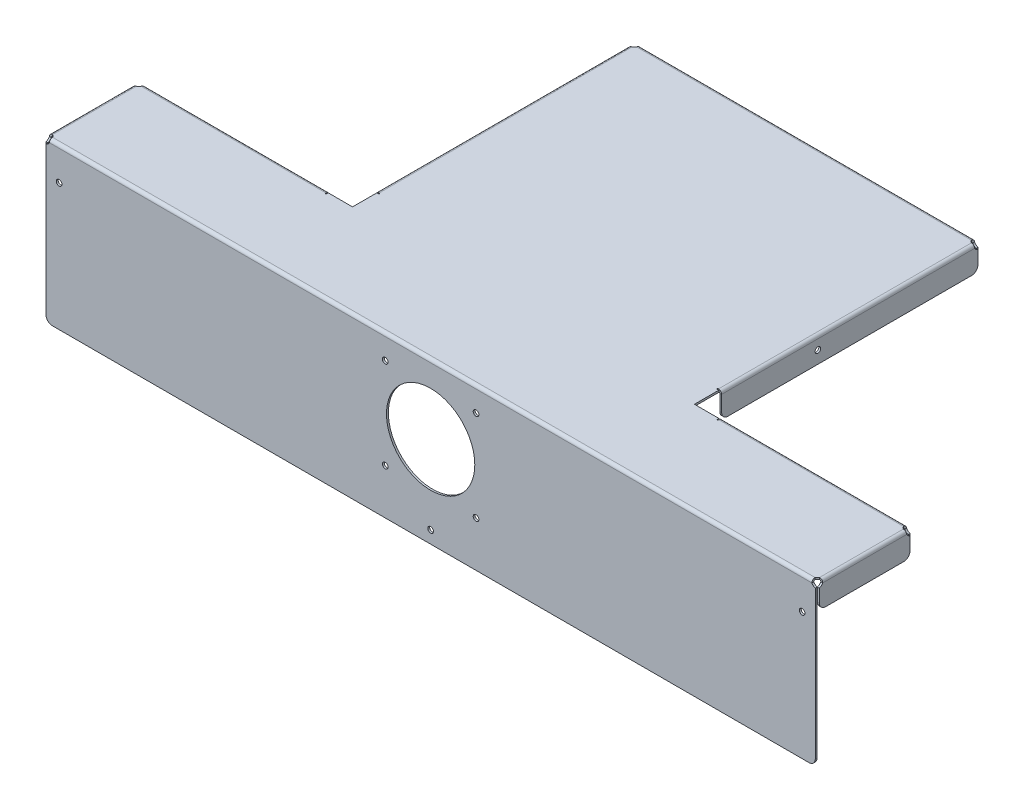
ISO-10303-21;
HEADER;
FILE_DESCRIPTION(('STEP AP214'),'2;1');
FILE_NAME('part.step','',(''),(''),'','','');
FILE_SCHEMA(('AUTOMOTIVE_DESIGN { 1 0 10303 214 1 1 1 1 }'));
ENDSEC;
DATA;
#1=APPLICATION_CONTEXT('core data for automotive mechanical design processes');
#2=APPLICATION_PROTOCOL_DEFINITION('international standard','automotive_design',2000,#1);
#3=PRODUCT_CONTEXT('',#1,'mechanical');
#4=PRODUCT('Part','Part','',(#3));
#5=PRODUCT_RELATED_PRODUCT_CATEGORY('part','',(#4));
#6=PRODUCT_DEFINITION_FORMATION('','',#4);
#7=PRODUCT_DEFINITION_CONTEXT('part definition',#1,'design');
#8=PRODUCT_DEFINITION('design','',#6,#7);
#9=PRODUCT_DEFINITION_SHAPE('','',#8);
#10=(LENGTH_UNIT() NAMED_UNIT(*) SI_UNIT(.MILLI.,.METRE.));
#11=(NAMED_UNIT(*) PLANE_ANGLE_UNIT() SI_UNIT($,.RADIAN.));
#12=(NAMED_UNIT(*) SI_UNIT($,.STERADIAN.) SOLID_ANGLE_UNIT());
#13=UNCERTAINTY_MEASURE_WITH_UNIT(LENGTH_MEASURE(1.E-05),#10,'distance_accuracy_value','');
#14=(GEOMETRIC_REPRESENTATION_CONTEXT(3) GLOBAL_UNCERTAINTY_ASSIGNED_CONTEXT((#13)) GLOBAL_UNIT_ASSIGNED_CONTEXT((#10,
#11,#12)) REPRESENTATION_CONTEXT('',''));
#15=CARTESIAN_POINT('',(0.,0.,0.));
#16=DIRECTION('',(0.,0.,1.));
#17=DIRECTION('',(1.,0.,0.));
#18=AXIS2_PLACEMENT_3D('',#15,#16,#17);
#19=CARTESIAN_POINT('',(-137.,1.50000000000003,317.829730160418));
#20=DIRECTION('',(0.,0.,-1.));
#21=DIRECTION('',(0.,1.,0.));
#22=AXIS2_PLACEMENT_3D('',#19,#20,#21);
#23=CYLINDRICAL_SURFACE('',#22,5.);
#24=CARTESIAN_POINT('',(-137.,1.50000000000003,-224.9));
#25=DIRECTION('',(0.,0.,-1.));
#26=DIRECTION('',(-1.,0.,0.));
#27=AXIS2_PLACEMENT_3D('',#24,#25,#26);
#28=CIRCLE('',#27,5.);
#29=CARTESIAN_POINT('',(-132.669872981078,-0.999999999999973,-224.9));
#30=VERTEX_POINT('',#29);
#31=CARTESIAN_POINT('',(-135.4,-3.2370877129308,-224.9));
#32=VERTEX_POINT('',#31);
#33=EDGE_CURVE('E42',#30,#32,#28,.T.);
#34=ORIENTED_EDGE('',*,*,#33,.T.);
#35=DIRECTION('',(0.,0.,-1.));
#36=VECTOR('',#35,1.);
#37=CARTESIAN_POINT('',(-135.4,-3.2370877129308,317.829730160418));
#38=LINE('',#37,#36);
#39=CARTESIAN_POINT('',(-135.4,-3.23708771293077,-223.4));
#40=VERTEX_POINT('',#39);
#41=EDGE_CURVE('E593',#40,#32,#38,.T.);
#42=ORIENTED_EDGE('',*,*,#41,.F.);
#43=CARTESIAN_POINT('',(-137.,1.50000000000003,-223.4));
#44=DIRECTION('',(0.,0.,-1.));
#45=DIRECTION('',(0.,1.,0.));
#46=AXIS2_PLACEMENT_3D('',#43,#44,#45);
#47=CIRCLE('',#46,5.);
#48=CARTESIAN_POINT('',(-132.669872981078,-0.999999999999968,-223.4));
#49=VERTEX_POINT('',#48);
#50=EDGE_CURVE('E608',#40,#49,#47,.F.);
#51=ORIENTED_EDGE('',*,*,#50,.T.);
#52=DIRECTION('',(0.,0.,-1.));
#53=VECTOR('',#52,1.);
#54=CARTESIAN_POINT('',(-132.669872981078,-0.999999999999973,317.829730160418));
#55=LINE('',#54,#53);
#56=EDGE_CURVE('E35',#49,#30,#55,.T.);
#57=ORIENTED_EDGE('',*,*,#56,.T.);
#58=EDGE_LOOP('',(#34,#42,#51,#57));
#59=FACE_BOUND('',#58,.T.);
#60=ADVANCED_FACE('F28',(#59),#23,.F.);
#61=CARTESIAN_POINT('',(-135.4,-18.5,317.829730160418));
#62=DIRECTION('',(-1.,0.,0.));
#63=DIRECTION('',(0.,1.,0.));
#64=AXIS2_PLACEMENT_3D('',#61,#62,#63);
#65=PLANE('',#64);
#66=ORIENTED_EDGE('',*,*,#41,.T.);
#67=DIRECTION('',(0.,1.,0.));
#68=VECTOR('',#67,1.);
#69=CARTESIAN_POINT('',(-135.4,-18.5,-224.9));
#70=LINE('',#69,#68);
#71=CARTESIAN_POINT('',(-135.4,-13.5,-224.9));
#72=VERTEX_POINT('',#71);
#73=EDGE_CURVE('E49',#72,#32,#70,.T.);
#74=ORIENTED_EDGE('',*,*,#73,.F.);
#75=DIRECTION('',(0.,0.,-1.));
#76=VECTOR('',#75,1.);
#77=CARTESIAN_POINT('',(-135.4,-13.5,317.829730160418));
#78=LINE('',#77,#76);
#79=CARTESIAN_POINT('',(-135.4,-13.5,-223.4));
#80=VERTEX_POINT('',#79);
#81=EDGE_CURVE('E629',#80,#72,#78,.T.);
#82=ORIENTED_EDGE('',*,*,#81,.F.);
#83=DIRECTION('',(0.,1.,0.));
#84=VECTOR('',#83,1.);
#85=CARTESIAN_POINT('',(-135.4,-18.5,-223.4));
#86=LINE('',#85,#84);
#87=EDGE_CURVE('E632',#80,#40,#86,.T.);
#88=ORIENTED_EDGE('',*,*,#87,.T.);
#89=EDGE_LOOP('',(#66,#74,#82,#88));
#90=FACE_BOUND('',#89,.T.);
#91=ADVANCED_FACE('F631',(#90),#65,.T.);
#92=CARTESIAN_POINT('',(-130.4,-13.5,317.829730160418));
#93=DIRECTION('',(0.,0.,-1.));
#94=DIRECTION('',(0.,1.,0.));
#95=AXIS2_PLACEMENT_3D('',#92,#93,#94);
#96=CYLINDRICAL_SURFACE('',#95,5.);
#97=CARTESIAN_POINT('',(-130.4,-13.5,-224.9));
#98=DIRECTION('',(0.,0.,-1.));
#99=DIRECTION('',(-1.,0.,0.));
#100=AXIS2_PLACEMENT_3D('',#97,#98,#99);
#101=CIRCLE('',#100,5.);
#102=CARTESIAN_POINT('',(-130.4,-18.5,-224.9));
#103=VERTEX_POINT('',#102);
#104=EDGE_CURVE('E638',#103,#72,#101,.T.);
#105=ORIENTED_EDGE('',*,*,#104,.F.);
#106=DIRECTION('',(0.,0.,-1.));
#107=VECTOR('',#106,1.);
#108=CARTESIAN_POINT('',(-130.4,-18.5,317.829730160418));
#109=LINE('',#108,#107);
#110=CARTESIAN_POINT('',(-130.4,-18.5,-223.4));
#111=VERTEX_POINT('',#110);
#112=EDGE_CURVE('E626',#111,#103,#109,.T.);
#113=ORIENTED_EDGE('',*,*,#112,.F.);
#114=CARTESIAN_POINT('',(-130.4,-13.5,-223.4));
#115=DIRECTION('',(0.,0.,-1.));
#116=DIRECTION('',(-1.,0.,0.));
#117=AXIS2_PLACEMENT_3D('',#114,#115,#116);
#118=CIRCLE('',#117,5.);
#119=EDGE_CURVE('E657',#80,#111,#118,.F.);
#120=ORIENTED_EDGE('',*,*,#119,.F.);
#121=ORIENTED_EDGE('',*,*,#81,.T.);
#122=EDGE_LOOP('',(#105,#113,#120,#121));
#123=FACE_BOUND('',#122,.T.);
#124=ADVANCED_FACE('F1501',(#123),#96,.T.);
#125=CARTESIAN_POINT('',(135.4,-18.5,317.829730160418));
#126=DIRECTION('',(0.,-1.,0.));
#127=DIRECTION('',(-1.,0.,0.));
#128=AXIS2_PLACEMENT_3D('',#125,#126,#127);
#129=PLANE('',#128);
#130=ORIENTED_EDGE('',*,*,#112,.T.);
#131=DIRECTION('',(-1.,0.,0.));
#132=VECTOR('',#131,1.);
#133=CARTESIAN_POINT('',(135.4,-18.5,-224.9));
#134=LINE('',#133,#132);
#135=CARTESIAN_POINT('',(130.4,-18.5,-224.9));
#136=VERTEX_POINT('',#135);
#137=EDGE_CURVE('E642',#136,#103,#134,.T.);
#138=ORIENTED_EDGE('',*,*,#137,.F.);
#139=DIRECTION('',(0.,0.,-1.));
#140=VECTOR('',#139,1.);
#141=CARTESIAN_POINT('',(130.4,-18.5,317.829730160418));
#142=LINE('',#141,#140);
#143=CARTESIAN_POINT('',(130.4,-18.5,-223.4));
#144=VERTEX_POINT('',#143);
#145=EDGE_CURVE('E623',#144,#136,#142,.T.);
#146=ORIENTED_EDGE('',*,*,#145,.F.);
#147=DIRECTION('',(-1.,0.,0.));
#148=VECTOR('',#147,1.);
#149=CARTESIAN_POINT('',(135.4,-18.5,-223.4));
#150=LINE('',#149,#148);
#151=EDGE_CURVE('E659',#144,#111,#150,.T.);
#152=ORIENTED_EDGE('',*,*,#151,.T.);
#153=EDGE_LOOP('',(#130,#138,#146,#152));
#154=FACE_BOUND('',#153,.T.);
#155=ADVANCED_FACE('F1490',(#154),#129,.T.);
#156=CARTESIAN_POINT('',(130.4,-13.5,317.829730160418));
#157=DIRECTION('',(0.,0.,-1.));
#158=DIRECTION('',(0.,1.,0.));
#159=AXIS2_PLACEMENT_3D('',#156,#157,#158);
#160=CYLINDRICAL_SURFACE('',#159,5.);
#161=CARTESIAN_POINT('',(130.4,-13.5,-224.9));
#162=DIRECTION('',(0.,0.,-1.));
#163=DIRECTION('',(-1.,0.,0.));
#164=AXIS2_PLACEMENT_3D('',#161,#162,#163);
#165=CIRCLE('',#164,5.);
#166=CARTESIAN_POINT('',(135.4,-13.5,-224.9));
#167=VERTEX_POINT('',#166);
#168=EDGE_CURVE('E651',#167,#136,#165,.T.);
#169=ORIENTED_EDGE('',*,*,#168,.F.);
#170=DIRECTION('',(0.,0.,-1.));
#171=VECTOR('',#170,1.);
#172=CARTESIAN_POINT('',(135.4,-13.5,317.829730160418));
#173=LINE('',#172,#171);
#174=CARTESIAN_POINT('',(135.4,-13.5,-223.4));
#175=VERTEX_POINT('',#174);
#176=EDGE_CURVE('E620',#175,#167,#173,.T.);
#177=ORIENTED_EDGE('',*,*,#176,.F.);
#178=CARTESIAN_POINT('',(130.4,-13.5,-223.4));
#179=DIRECTION('',(0.,0.,-1.));
#180=DIRECTION('',(-1.,0.,0.));
#181=AXIS2_PLACEMENT_3D('',#178,#179,#180);
#182=CIRCLE('',#181,5.);
#183=EDGE_CURVE('E662',#144,#175,#182,.F.);
#184=ORIENTED_EDGE('',*,*,#183,.F.);
#185=ORIENTED_EDGE('',*,*,#145,.T.);
#186=EDGE_LOOP('',(#169,#177,#184,#185));
#187=FACE_BOUND('',#186,.T.);
#188=ADVANCED_FACE('F1493',(#187),#160,.T.);
#189=CARTESIAN_POINT('',(135.4,-18.5,317.829730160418));
#190=DIRECTION('',(-1.,0.,0.));
#191=DIRECTION('',(0.,1.,0.));
#192=AXIS2_PLACEMENT_3D('',#189,#190,#191);
#193=PLANE('',#192);
#194=DIRECTION('',(0.,1.,0.));
#195=VECTOR('',#194,1.);
#196=CARTESIAN_POINT('',(135.4,-18.5,-224.9));
#197=LINE('',#196,#195);
#198=CARTESIAN_POINT('',(135.4,-3.2370877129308,-224.9));
#199=VERTEX_POINT('',#198);
#200=EDGE_CURVE('E648',#167,#199,#197,.T.);
#201=ORIENTED_EDGE('',*,*,#200,.T.);
#202=DIRECTION('',(0.,0.,-1.));
#203=VECTOR('',#202,1.);
#204=CARTESIAN_POINT('',(135.4,-3.2370877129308,317.829730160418));
#205=LINE('',#204,#203);
#206=CARTESIAN_POINT('',(135.4,-3.2370877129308,-223.4));
#207=VERTEX_POINT('',#206);
#208=EDGE_CURVE('E615',#207,#199,#205,.T.);
#209=ORIENTED_EDGE('',*,*,#208,.F.);
#210=DIRECTION('',(0.,1.,0.));
#211=VECTOR('',#210,1.);
#212=CARTESIAN_POINT('',(135.4,-18.5,-223.4));
#213=LINE('',#212,#211);
#214=EDGE_CURVE('E611',#175,#207,#213,.T.);
#215=ORIENTED_EDGE('',*,*,#214,.F.);
#216=ORIENTED_EDGE('',*,*,#176,.T.);
#217=EDGE_LOOP('',(#201,#209,#215,#216));
#218=FACE_BOUND('',#217,.T.);
#219=ADVANCED_FACE('F670',(#218),#193,.F.);
#220=CARTESIAN_POINT('',(137.,1.5,317.829730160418));
#221=DIRECTION('',(0.,0.,-1.));
#222=DIRECTION('',(0.,1.,0.));
#223=AXIS2_PLACEMENT_3D('',#220,#221,#222);
#224=CYLINDRICAL_SURFACE('',#223,5.);
#225=CARTESIAN_POINT('',(137.,1.5,-224.9));
#226=DIRECTION('',(0.,0.,-1.));
#227=DIRECTION('',(-1.,0.,0.));
#228=AXIS2_PLACEMENT_3D('',#225,#226,#227);
#229=CIRCLE('',#228,5.);
#230=CARTESIAN_POINT('',(132.669872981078,-1.00000000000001,-224.9));
#231=VERTEX_POINT('',#230);
#232=EDGE_CURVE('E640',#199,#231,#229,.T.);
#233=ORIENTED_EDGE('',*,*,#232,.T.);
#234=DIRECTION('',(0.,0.,-1.));
#235=VECTOR('',#234,1.);
#236=CARTESIAN_POINT('',(132.669872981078,-1.,317.829730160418));
#237=LINE('',#236,#235);
#238=CARTESIAN_POINT('',(132.669872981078,-1.,-223.4));
#239=VERTEX_POINT('',#238);
#240=EDGE_CURVE('E613',#239,#231,#237,.T.);
#241=ORIENTED_EDGE('',*,*,#240,.F.);
#242=CARTESIAN_POINT('',(137.,1.5,-223.4));
#243=DIRECTION('',(0.,0.,-1.));
#244=DIRECTION('',(0.,1.,0.));
#245=AXIS2_PLACEMENT_3D('',#242,#243,#244);
#246=CIRCLE('',#245,5.);
#247=EDGE_CURVE('E11',#239,#207,#246,.F.);
#248=ORIENTED_EDGE('',*,*,#247,.T.);
#249=ORIENTED_EDGE('',*,*,#208,.T.);
#250=EDGE_LOOP('',(#233,#241,#248,#249));
#251=FACE_BOUND('',#250,.T.);
#252=ADVANCED_FACE('F669',(#251),#224,.F.);
#253=CARTESIAN_POINT('',(135.4,-18.5,-223.4));
#254=DIRECTION('',(0.,0.,-1.));
#255=DIRECTION('',(-1.,0.,0.));
#256=AXIS2_PLACEMENT_3D('',#253,#254,#255);
#257=PLANE('',#256);
#258=ORIENTED_EDGE('',*,*,#50,.F.);
#259=ORIENTED_EDGE('',*,*,#87,.F.);
#260=ORIENTED_EDGE('',*,*,#119,.T.);
#261=ORIENTED_EDGE('',*,*,#151,.F.);
#262=ORIENTED_EDGE('',*,*,#183,.T.);
#263=ORIENTED_EDGE('',*,*,#214,.T.);
#264=ORIENTED_EDGE('',*,*,#247,.F.);
#265=DIRECTION('',(-1.,0.,0.));
#266=VECTOR('',#265,1.);
#267=CARTESIAN_POINT('',(-132.669872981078,-0.999999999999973,-223.4));
#268=LINE('',#267,#266);
#269=EDGE_CURVE('E598',#239,#49,#268,.T.);
#270=ORIENTED_EDGE('',*,*,#269,.T.);
#271=EDGE_LOOP('',(#258,#259,#260,#261,#262,#263,#264,#270));
#272=FACE_BOUND('',#271,.T.);
#273=ADVANCED_FACE('F607',(#272),#257,.F.);
#274=CARTESIAN_POINT('',(135.4,-18.5,-224.9));
#275=DIRECTION('',(0.,0.,-1.));
#276=DIRECTION('',(-1.,0.,0.));
#277=AXIS2_PLACEMENT_3D('',#274,#275,#276);
#278=PLANE('',#277);
#279=DIRECTION('',(-1.,0.,0.));
#280=VECTOR('',#279,1.);
#281=CARTESIAN_POINT('',(-132.669872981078,-0.999999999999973,-224.9));
#282=LINE('',#281,#280);
#283=EDGE_CURVE('E654',#231,#30,#282,.T.);
#284=ORIENTED_EDGE('',*,*,#283,.F.);
#285=ORIENTED_EDGE('',*,*,#232,.F.);
#286=ORIENTED_EDGE('',*,*,#200,.F.);
#287=ORIENTED_EDGE('',*,*,#168,.T.);
#288=ORIENTED_EDGE('',*,*,#137,.T.);
#289=ORIENTED_EDGE('',*,*,#104,.T.);
#290=ORIENTED_EDGE('',*,*,#73,.T.);
#291=ORIENTED_EDGE('',*,*,#33,.F.);
#292=EDGE_LOOP('',(#284,#285,#286,#287,#288,#289,#290,#291));
#293=FACE_BOUND('',#292,.T.);
#294=ADVANCED_FACE('F636',(#293),#278,.T.);
#295=CARTESIAN_POINT('',(155.6,-18.5,0.));
#296=DIRECTION('',(0.,0.,1.));
#297=DIRECTION('',(1.,0.,0.));
#298=AXIS2_PLACEMENT_3D('',#295,#296,#297);
#299=PLANE('',#298);
#300=DIRECTION('',(1.,0.,0.));
#301=VECTOR('',#300,1.);
#302=CARTESIAN_POINT('',(155.6,-1.,0.));
#303=LINE('',#302,#301);
#304=CARTESIAN_POINT('',(155.6,-0.999999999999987,0.));
#305=VERTEX_POINT('',#304);
#306=CARTESIAN_POINT('',(302.169872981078,-0.999999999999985,0.));
#307=VERTEX_POINT('',#306);
#308=EDGE_CURVE('E1462',#305,#307,#303,.T.);
#309=ORIENTED_EDGE('',*,*,#308,.F.);
#310=DIRECTION('',(0.,1.,0.));
#311=VECTOR('',#310,1.);
#312=CARTESIAN_POINT('',(155.6,-18.5,0.));
#313=LINE('',#312,#311);
#314=CARTESIAN_POINT('',(155.6,-13.5,0.));
#315=VERTEX_POINT('',#314);
#316=EDGE_CURVE('E1451',#315,#305,#313,.T.);
#317=ORIENTED_EDGE('',*,*,#316,.F.);
#318=CARTESIAN_POINT('',(160.6,-13.5,0.));
#319=DIRECTION('',(0.,0.,1.));
#320=DIRECTION('',(1.,0.,0.));
#321=AXIS2_PLACEMENT_3D('',#318,#319,#320);
#322=CIRCLE('',#321,5.);
#323=CARTESIAN_POINT('',(160.6,-18.5,0.));
#324=VERTEX_POINT('',#323);
#325=EDGE_CURVE('E1454',#315,#324,#322,.T.);
#326=ORIENTED_EDGE('',*,*,#325,.T.);
#327=DIRECTION('',(1.,0.,0.));
#328=VECTOR('',#327,1.);
#329=CARTESIAN_POINT('',(155.6,-18.5,0.));
#330=LINE('',#329,#328);
#331=CARTESIAN_POINT('',(299.9,-18.5,0.));
#332=VERTEX_POINT('',#331);
#333=EDGE_CURVE('E1456',#324,#332,#330,.T.);
#334=ORIENTED_EDGE('',*,*,#333,.T.);
#335=CARTESIAN_POINT('',(299.9,-13.5,0.));
#336=DIRECTION('',(0.,0.,1.));
#337=DIRECTION('',(1.,0.,0.));
#338=AXIS2_PLACEMENT_3D('',#335,#336,#337);
#339=CIRCLE('',#338,5.);
#340=CARTESIAN_POINT('',(304.9,-13.5,0.));
#341=VERTEX_POINT('',#340);
#342=EDGE_CURVE('E1458',#332,#341,#339,.T.);
#343=ORIENTED_EDGE('',*,*,#342,.T.);
#344=DIRECTION('',(0.,1.,0.));
#345=VECTOR('',#344,1.);
#346=CARTESIAN_POINT('',(304.9,-18.5,0.));
#347=LINE('',#346,#345);
#348=CARTESIAN_POINT('',(304.9,-3.23708771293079,0.));
#349=VERTEX_POINT('',#348);
#350=EDGE_CURVE('E1460',#341,#349,#347,.T.);
#351=ORIENTED_EDGE('',*,*,#350,.T.);
#352=CARTESIAN_POINT('',(306.5,1.5,0.));
#353=DIRECTION('',(0.,0.,1.));
#354=DIRECTION('',(0.,-1.,0.));
#355=AXIS2_PLACEMENT_3D('',#352,#353,#354);
#356=CIRCLE('',#355,5.);
#357=EDGE_CURVE('E1483',#307,#349,#356,.T.);
#358=ORIENTED_EDGE('',*,*,#357,.F.);
#359=EDGE_LOOP('',(#309,#317,#326,#334,#343,#351,#358));
#360=FACE_BOUND('',#359,.T.);
#361=ADVANCED_FACE('F1544',(#360),#299,.T.);
#362=CARTESIAN_POINT('',(155.6,-18.5,299.144241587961));
#363=DIRECTION('',(-1.,0.,0.));
#364=DIRECTION('',(0.,1.,0.));
#365=AXIS2_PLACEMENT_3D('',#362,#363,#364);
#366=PLANE('',#365);
#367=DIRECTION('',(0.,1.,0.));
#368=VECTOR('',#367,1.);
#369=CARTESIAN_POINT('',(155.6,-18.5,-1.5));
#370=LINE('',#369,#368);
#371=CARTESIAN_POINT('',(155.6,-13.5,-1.5));
#372=VERTEX_POINT('',#371);
#373=CARTESIAN_POINT('',(155.6,-1.,-1.5));
#374=VERTEX_POINT('',#373);
#375=EDGE_CURVE('E1439',#372,#374,#370,.T.);
#376=ORIENTED_EDGE('',*,*,#375,.F.);
#377=DIRECTION('',(0.,0.,-1.));
#378=VECTOR('',#377,1.);
#379=CARTESIAN_POINT('',(155.6,-13.5,299.144241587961));
#380=LINE('',#379,#378);
#381=EDGE_CURVE('E1477',#315,#372,#380,.T.);
#382=ORIENTED_EDGE('',*,*,#381,.F.);
#383=ORIENTED_EDGE('',*,*,#316,.T.);
#384=DIRECTION('',(0.,0.,-1.));
#385=VECTOR('',#384,1.);
#386=CARTESIAN_POINT('',(155.6,-1.,299.144241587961));
#387=LINE('',#386,#385);
#388=EDGE_CURVE('E1480',#305,#374,#387,.T.);
#389=ORIENTED_EDGE('',*,*,#388,.T.);
#390=EDGE_LOOP('',(#376,#382,#383,#389));
#391=FACE_BOUND('',#390,.T.);
#392=ADVANCED_FACE('F1551',(#391),#366,.T.);
#393=CARTESIAN_POINT('',(160.6,-13.5,299.144241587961));
#394=DIRECTION('',(0.,0.,-1.));
#395=DIRECTION('',(0.,1.,0.));
#396=AXIS2_PLACEMENT_3D('',#393,#394,#395);
#397=CYLINDRICAL_SURFACE('',#396,5.);
#398=ORIENTED_EDGE('',*,*,#381,.T.);
#399=CARTESIAN_POINT('',(160.6,-13.5,-1.5));
#400=DIRECTION('',(0.,0.,1.));
#401=DIRECTION('',(1.,0.,0.));
#402=AXIS2_PLACEMENT_3D('',#399,#400,#401);
#403=CIRCLE('',#402,5.);
#404=CARTESIAN_POINT('',(160.6,-18.5,-1.5));
#405=VERTEX_POINT('',#404);
#406=EDGE_CURVE('E1436',#405,#372,#403,.F.);
#407=ORIENTED_EDGE('',*,*,#406,.F.);
#408=DIRECTION('',(0.,0.,-1.));
#409=VECTOR('',#408,1.);
#410=CARTESIAN_POINT('',(160.6,-18.5,299.144241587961));
#411=LINE('',#410,#409);
#412=EDGE_CURVE('E1474',#324,#405,#411,.T.);
#413=ORIENTED_EDGE('',*,*,#412,.F.);
#414=ORIENTED_EDGE('',*,*,#325,.F.);
#415=EDGE_LOOP('',(#398,#407,#413,#414));
#416=FACE_BOUND('',#415,.T.);
#417=ADVANCED_FACE('F1559',(#416),#397,.T.);
#418=CARTESIAN_POINT('',(155.6,-18.5,299.144241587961));
#419=DIRECTION('',(0.,1.,0.));
#420=DIRECTION('',(0.,0.,1.));
#421=AXIS2_PLACEMENT_3D('',#418,#419,#420);
#422=PLANE('',#421);
#423=ORIENTED_EDGE('',*,*,#412,.T.);
#424=DIRECTION('',(1.,0.,0.));
#425=VECTOR('',#424,1.);
#426=CARTESIAN_POINT('',(155.6,-18.5,-1.5));
#427=LINE('',#426,#425);
#428=CARTESIAN_POINT('',(299.9,-18.5,-1.5));
#429=VERTEX_POINT('',#428);
#430=EDGE_CURVE('E1434',#405,#429,#427,.T.);
#431=ORIENTED_EDGE('',*,*,#430,.T.);
#432=DIRECTION('',(0.,0.,-1.));
#433=VECTOR('',#432,1.);
#434=CARTESIAN_POINT('',(299.9,-18.5,299.144241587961));
#435=LINE('',#434,#433);
#436=EDGE_CURVE('E1471',#332,#429,#435,.T.);
#437=ORIENTED_EDGE('',*,*,#436,.F.);
#438=ORIENTED_EDGE('',*,*,#333,.F.);
#439=EDGE_LOOP('',(#423,#431,#437,#438));
#440=FACE_BOUND('',#439,.T.);
#441=ADVANCED_FACE('F1570',(#440),#422,.F.);
#442=CARTESIAN_POINT('',(299.9,-13.5,299.144241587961));
#443=DIRECTION('',(0.,0.,-1.));
#444=DIRECTION('',(0.,1.,0.));
#445=AXIS2_PLACEMENT_3D('',#442,#443,#444);
#446=CYLINDRICAL_SURFACE('',#445,5.);
#447=ORIENTED_EDGE('',*,*,#436,.T.);
#448=CARTESIAN_POINT('',(299.9,-13.5,-1.5));
#449=DIRECTION('',(0.,0.,1.));
#450=DIRECTION('',(1.,0.,0.));
#451=AXIS2_PLACEMENT_3D('',#448,#449,#450);
#452=CIRCLE('',#451,5.);
#453=CARTESIAN_POINT('',(304.9,-13.5,-1.5));
#454=VERTEX_POINT('',#453);
#455=EDGE_CURVE('E1445',#454,#429,#452,.F.);
#456=ORIENTED_EDGE('',*,*,#455,.F.);
#457=DIRECTION('',(0.,0.,-1.));
#458=VECTOR('',#457,1.);
#459=CARTESIAN_POINT('',(304.9,-13.5,299.144241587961));
#460=LINE('',#459,#458);
#461=EDGE_CURVE('E1468',#341,#454,#460,.T.);
#462=ORIENTED_EDGE('',*,*,#461,.F.);
#463=ORIENTED_EDGE('',*,*,#342,.F.);
#464=EDGE_LOOP('',(#447,#456,#462,#463));
#465=FACE_BOUND('',#464,.T.);
#466=ADVANCED_FACE('F1578',(#465),#446,.T.);
#467=CARTESIAN_POINT('',(304.9,-18.5,299.144241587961));
#468=DIRECTION('',(-1.,0.,0.));
#469=DIRECTION('',(0.,1.,0.));
#470=AXIS2_PLACEMENT_3D('',#467,#468,#469);
#471=PLANE('',#470);
#472=ORIENTED_EDGE('',*,*,#461,.T.);
#473=DIRECTION('',(0.,1.,0.));
#474=VECTOR('',#473,1.);
#475=CARTESIAN_POINT('',(304.9,-18.5,-1.5));
#476=LINE('',#475,#474);
#477=CARTESIAN_POINT('',(304.9,-3.23708771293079,-1.5));
#478=VERTEX_POINT('',#477);
#479=EDGE_CURVE('E1442',#454,#478,#476,.T.);
#480=ORIENTED_EDGE('',*,*,#479,.T.);
#481=DIRECTION('',(0.,0.,-1.));
#482=VECTOR('',#481,1.);
#483=CARTESIAN_POINT('',(304.9,-3.23708771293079,299.144241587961));
#484=LINE('',#483,#482);
#485=EDGE_CURVE('E1466',#349,#478,#484,.T.);
#486=ORIENTED_EDGE('',*,*,#485,.F.);
#487=ORIENTED_EDGE('',*,*,#350,.F.);
#488=EDGE_LOOP('',(#472,#480,#486,#487));
#489=FACE_BOUND('',#488,.T.);
#490=ADVANCED_FACE('F1586',(#489),#471,.F.);
#491=CARTESIAN_POINT('',(306.5,1.5,299.144241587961));
#492=DIRECTION('',(0.,0.,-1.));
#493=DIRECTION('',(0.,1.,0.));
#494=AXIS2_PLACEMENT_3D('',#491,#492,#493);
#495=CYLINDRICAL_SURFACE('',#494,5.);
#496=CARTESIAN_POINT('',(306.5,1.5,-1.5));
#497=DIRECTION('',(0.,0.,1.));
#498=DIRECTION('',(0.,-1.,0.));
#499=AXIS2_PLACEMENT_3D('',#496,#497,#498);
#500=CIRCLE('',#499,5.);
#501=CARTESIAN_POINT('',(302.169872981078,-0.999999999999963,-1.5));
#502=VERTEX_POINT('',#501);
#503=EDGE_CURVE('E1486',#502,#478,#500,.T.);
#504=ORIENTED_EDGE('',*,*,#503,.F.);
#505=DIRECTION('',(0.,0.,-1.));
#506=VECTOR('',#505,1.);
#507=CARTESIAN_POINT('',(302.169872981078,-0.999999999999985,299.144241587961));
#508=LINE('',#507,#506);
#509=EDGE_CURVE('E1464',#307,#502,#508,.T.);
#510=ORIENTED_EDGE('',*,*,#509,.F.);
#511=ORIENTED_EDGE('',*,*,#357,.T.);
#512=ORIENTED_EDGE('',*,*,#485,.T.);
#513=EDGE_LOOP('',(#504,#510,#511,#512));
#514=FACE_BOUND('',#513,.T.);
#515=ADVANCED_FACE('F1594',(#514),#495,.F.);
#516=CARTESIAN_POINT('',(155.6,-18.5,-1.5));
#517=DIRECTION('',(0.,0.,1.));
#518=DIRECTION('',(1.,0.,0.));
#519=AXIS2_PLACEMENT_3D('',#516,#517,#518);
#520=PLANE('',#519);
#521=ORIENTED_EDGE('',*,*,#375,.T.);
#522=DIRECTION('',(1.,0.,0.));
#523=VECTOR('',#522,1.);
#524=CARTESIAN_POINT('',(155.6,-1.,-1.5));
#525=LINE('',#524,#523);
#526=EDGE_CURVE('E1448',#374,#502,#525,.T.);
#527=ORIENTED_EDGE('',*,*,#526,.T.);
#528=ORIENTED_EDGE('',*,*,#503,.T.);
#529=ORIENTED_EDGE('',*,*,#479,.F.);
#530=ORIENTED_EDGE('',*,*,#455,.T.);
#531=ORIENTED_EDGE('',*,*,#430,.F.);
#532=ORIENTED_EDGE('',*,*,#406,.T.);
#533=EDGE_LOOP('',(#521,#527,#528,#529,#530,#531,#532));
#534=FACE_BOUND('',#533,.T.);
#535=ADVANCED_FACE('F1602',(#534),#520,.F.);
#536=CARTESIAN_POINT('',(137.,-18.5,-223.3));
#537=DIRECTION('',(-1.,0.,0.));
#538=DIRECTION('',(0.,0.,1.));
#539=AXIS2_PLACEMENT_3D('',#536,#537,#538);
#540=PLANE('',#539);
#541=CARTESIAN_POINT('',(137.,-8.67999999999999,-96.4));
#542=DIRECTION('',(1.,0.,0.));
#543=DIRECTION('',(0.,0.,-1.));
#544=AXIS2_PLACEMENT_3D('',#541,#542,#543);
#545=CIRCLE('',#544,2.25);
#546=CARTESIAN_POINT('',(137.,-8.67999999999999,-98.65));
#547=VERTEX_POINT('',#546);
#548=EDGE_CURVE('E1388',#547,#547,#545,.T.);
#549=ORIENTED_EDGE('',*,*,#548,.F.);
#550=EDGE_LOOP('',(#549));
#551=FACE_BOUND('',#550,.T.);
#552=CARTESIAN_POINT('',(137.,1.49999999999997,-224.9));
#553=DIRECTION('',(-1.,0.,0.));
#554=DIRECTION('',(0.,0.,1.));
#555=AXIS2_PLACEMENT_3D('',#552,#553,#554);
#556=CIRCLE('',#555,5.);
#557=CARTESIAN_POINT('',(137.,-3.23708771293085,-223.3));
#558=VERTEX_POINT('',#557);
#559=CARTESIAN_POINT('',(137.,-1.,-220.569872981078));
#560=VERTEX_POINT('',#559);
#561=EDGE_CURVE('E1398',#558,#560,#556,.T.);
#562=ORIENTED_EDGE('',*,*,#561,.T.);
#563=DIRECTION('',(0.,0.,1.));
#564=VECTOR('',#563,1.);
#565=CARTESIAN_POINT('',(137.,-1.,-220.569872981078));
#566=LINE('',#565,#564);
#567=CARTESIAN_POINT('',(137.,-0.999999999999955,-20.1));
#568=VERTEX_POINT('',#567);
#569=EDGE_CURVE('E1411',#560,#568,#566,.T.);
#570=ORIENTED_EDGE('',*,*,#569,.T.);
#571=DIRECTION('',(0.,1.,0.));
#572=VECTOR('',#571,1.);
#573=CARTESIAN_POINT('',(137.,-18.5,-20.1));
#574=LINE('',#573,#572);
#575=CARTESIAN_POINT('',(137.,-13.5,-20.1));
#576=VERTEX_POINT('',#575);
#577=EDGE_CURVE('E1401',#576,#568,#574,.T.);
#578=ORIENTED_EDGE('',*,*,#577,.F.);
#579=CARTESIAN_POINT('',(137.,-13.5,-25.1));
#580=DIRECTION('',(-1.,0.,0.));
#581=DIRECTION('',(0.,0.,1.));
#582=AXIS2_PLACEMENT_3D('',#579,#580,#581);
#583=CIRCLE('',#582,5.);
#584=CARTESIAN_POINT('',(137.,-18.5,-25.1));
#585=VERTEX_POINT('',#584);
#586=EDGE_CURVE('E1404',#576,#585,#583,.F.);
#587=ORIENTED_EDGE('',*,*,#586,.T.);
#588=DIRECTION('',(0.,0.,1.));
#589=VECTOR('',#588,1.);
#590=CARTESIAN_POINT('',(137.,-18.5,-223.3));
#591=LINE('',#590,#589);
#592=CARTESIAN_POINT('',(137.,-18.5,-218.3));
#593=VERTEX_POINT('',#592);
#594=EDGE_CURVE('E1391',#593,#585,#591,.T.);
#595=ORIENTED_EDGE('',*,*,#594,.F.);
#596=CARTESIAN_POINT('',(137.,-13.5,-218.3));
#597=DIRECTION('',(-1.,0.,0.));
#598=DIRECTION('',(0.,0.,1.));
#599=AXIS2_PLACEMENT_3D('',#596,#597,#598);
#600=CIRCLE('',#599,5.);
#601=CARTESIAN_POINT('',(137.,-13.5,-223.3));
#602=VERTEX_POINT('',#601);
#603=EDGE_CURVE('E1394',#593,#602,#600,.F.);
#604=ORIENTED_EDGE('',*,*,#603,.T.);
#605=DIRECTION('',(0.,1.,0.));
#606=VECTOR('',#605,1.);
#607=CARTESIAN_POINT('',(137.,-18.5,-223.3));
#608=LINE('',#607,#606);
#609=EDGE_CURVE('E1396',#602,#558,#608,.T.);
#610=ORIENTED_EDGE('',*,*,#609,.T.);
#611=EDGE_LOOP('',(#562,#570,#578,#587,#595,#604,#610));
#612=FACE_BOUND('',#611,.T.);
#613=ADVANCED_FACE('F1610',(#551,#612),#540,.F.);
#614=CARTESIAN_POINT('',(-306.5,-8.67999999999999,-96.4));
#615=DIRECTION('',(1.,0.,0.));
#616=DIRECTION('',(0.,0.,-1.));
#617=AXIS2_PLACEMENT_3D('',#614,#615,#616);
#618=CYLINDRICAL_SURFACE('',#617,2.25);
#619=CARTESIAN_POINT('',(135.5,-8.67999999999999,-96.4));
#620=DIRECTION('',(-1.,0.,0.));
#621=DIRECTION('',(0.,0.,1.));
#622=AXIS2_PLACEMENT_3D('',#619,#620,#621);
#623=CIRCLE('',#622,2.25);
#624=CARTESIAN_POINT('',(135.5,-8.67999999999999,-98.65));
#625=VERTEX_POINT('',#624);
#626=EDGE_CURVE('E1371',#625,#625,#623,.T.);
#627=CARTESIAN_POINT('',(135.5,-8.67999999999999,-98.65));
#628=CARTESIAN_POINT('',(135.515625,-8.67999999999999,-98.65));
#629=CARTESIAN_POINT('',(135.53125,-8.67999999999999,-98.65));
#630=CARTESIAN_POINT('',(135.5625,-8.67999999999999,-98.65));
#631=CARTESIAN_POINT('',(135.578125,-8.67999999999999,-98.65));
#632=CARTESIAN_POINT('',(135.609375,-8.67999999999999,-98.65));
#633=CARTESIAN_POINT('',(135.625,-8.67999999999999,-98.65));
#634=CARTESIAN_POINT('',(135.65625,-8.67999999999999,-98.65));
#635=CARTESIAN_POINT('',(135.671875,-8.67999999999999,-98.65));
#636=CARTESIAN_POINT('',(135.703125,-8.67999999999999,-98.65));
#637=CARTESIAN_POINT('',(135.71875,-8.67999999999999,-98.65));
#638=CARTESIAN_POINT('',(135.75,-8.67999999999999,-98.65));
#639=CARTESIAN_POINT('',(135.765625,-8.67999999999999,-98.65));
#640=CARTESIAN_POINT('',(135.796875,-8.67999999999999,-98.65));
#641=CARTESIAN_POINT('',(135.8125,-8.67999999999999,-98.65));
#642=CARTESIAN_POINT('',(135.84375,-8.67999999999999,-98.65));
#643=CARTESIAN_POINT('',(135.859375,-8.67999999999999,-98.65));
#644=CARTESIAN_POINT('',(135.890625,-8.67999999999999,-98.65));
#645=CARTESIAN_POINT('',(135.90625,-8.67999999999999,-98.65));
#646=CARTESIAN_POINT('',(135.9375,-8.67999999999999,-98.65));
#647=CARTESIAN_POINT('',(135.953125,-8.67999999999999,-98.65));
#648=CARTESIAN_POINT('',(135.984375,-8.67999999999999,-98.65));
#649=CARTESIAN_POINT('',(136.,-8.67999999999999,-98.65));
#650=CARTESIAN_POINT('',(136.03125,-8.67999999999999,-98.65));
#651=CARTESIAN_POINT('',(136.046875,-8.67999999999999,-98.65));
#652=CARTESIAN_POINT('',(136.078125,-8.67999999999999,-98.65));
#653=CARTESIAN_POINT('',(136.09375,-8.67999999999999,-98.65));
#654=CARTESIAN_POINT('',(136.125,-8.67999999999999,-98.65));
#655=CARTESIAN_POINT('',(136.140625,-8.67999999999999,-98.65));
#656=CARTESIAN_POINT('',(136.171875,-8.67999999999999,-98.65));
#657=CARTESIAN_POINT('',(136.1875,-8.67999999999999,-98.65));
#658=CARTESIAN_POINT('',(136.21875,-8.67999999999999,-98.65));
#659=CARTESIAN_POINT('',(136.234375,-8.67999999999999,-98.65));
#660=CARTESIAN_POINT('',(136.265625,-8.67999999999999,-98.65));
#661=CARTESIAN_POINT('',(136.28125,-8.67999999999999,-98.65));
#662=CARTESIAN_POINT('',(136.3125,-8.67999999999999,-98.65));
#663=CARTESIAN_POINT('',(136.328125,-8.67999999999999,-98.65));
#664=CARTESIAN_POINT('',(136.359375,-8.67999999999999,-98.65));
#665=CARTESIAN_POINT('',(136.375,-8.67999999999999,-98.65));
#666=CARTESIAN_POINT('',(136.40625,-8.67999999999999,-98.65));
#667=CARTESIAN_POINT('',(136.421875,-8.67999999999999,-98.65));
#668=CARTESIAN_POINT('',(136.453125,-8.67999999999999,-98.65));
#669=CARTESIAN_POINT('',(136.46875,-8.67999999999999,-98.65));
#670=CARTESIAN_POINT('',(136.5,-8.67999999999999,-98.65));
#671=CARTESIAN_POINT('',(136.515625,-8.67999999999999,-98.65));
#672=CARTESIAN_POINT('',(136.546875,-8.67999999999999,-98.65));
#673=CARTESIAN_POINT('',(136.5625,-8.67999999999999,-98.65));
#674=CARTESIAN_POINT('',(136.59375,-8.67999999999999,-98.65));
#675=CARTESIAN_POINT('',(136.609375,-8.67999999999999,-98.65));
#676=CARTESIAN_POINT('',(136.640625,-8.67999999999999,-98.65));
#677=CARTESIAN_POINT('',(136.65625,-8.67999999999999,-98.65));
#678=CARTESIAN_POINT('',(136.6875,-8.67999999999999,-98.65));
#679=CARTESIAN_POINT('',(136.703125,-8.67999999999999,-98.65));
#680=CARTESIAN_POINT('',(136.734375,-8.67999999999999,-98.65));
#681=CARTESIAN_POINT('',(136.75,-8.67999999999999,-98.65));
#682=CARTESIAN_POINT('',(136.78125,-8.67999999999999,-98.65));
#683=CARTESIAN_POINT('',(136.796875,-8.67999999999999,-98.65));
#684=CARTESIAN_POINT('',(136.828125,-8.67999999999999,-98.65));
#685=CARTESIAN_POINT('',(136.84375,-8.67999999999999,-98.65));
#686=CARTESIAN_POINT('',(136.875,-8.67999999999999,-98.65));
#687=CARTESIAN_POINT('',(136.890625,-8.67999999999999,-98.65));
#688=CARTESIAN_POINT('',(136.921875,-8.67999999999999,-98.65));
#689=CARTESIAN_POINT('',(136.9375,-8.67999999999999,-98.65));
#690=CARTESIAN_POINT('',(136.96875,-8.67999999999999,-98.65));
#691=CARTESIAN_POINT('',(136.984375,-8.67999999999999,-98.65));
#692=CARTESIAN_POINT('',(137.,-8.67999999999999,-98.65));
#693=B_SPLINE_CURVE_WITH_KNOTS('',3,(#627,#628,#629,#630,#631,#632,#633,#634,#635,#636,#637,
#638,#639,#640,#641,#642,#643,#644,#645,#646,#647,#648,#649,#650,#651,#652,#653,#654,#655,#656,
#657,#658,#659,#660,#661,#662,#663,#664,#665,#666,#667,#668,#669,#670,#671,#672,#673,#674,#675,
#676,#677,#678,#679,#680,#681,#682,#683,#684,#685,#686,#687,#688,#689,#690,#691,#692),
.UNSPECIFIED.,.F.,.F.,(4,2,2,2,2,2,2,2,2,2,2,2,2,2,2,2,2,2,2,2,2,2,2,2,2,2,2,2,2,2,2,2,4),(0.,
0.0468750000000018,0.0937500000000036,0.140625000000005,0.187500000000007,0.234375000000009,
0.281250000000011,0.328125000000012,0.375000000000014,0.421875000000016,0.468750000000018,
0.51562500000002,0.562500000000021,0.609375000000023,0.656250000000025,0.703125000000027,
0.750000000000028,0.79687500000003,0.843750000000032,0.890625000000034,0.937500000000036,
0.984375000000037,1.03125000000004,1.07812500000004,1.12500000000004,1.17187500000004,
1.21875000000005,1.26562500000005,1.31250000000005,1.35937500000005,1.40625000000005,
1.45312500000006,1.50000000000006),.UNSPECIFIED.);
#694=EDGE_CURVE('BSEAM1619',#625,#547,#693,.T.);
#695=ORIENTED_EDGE('',*,*,#626,.T.);
#696=ORIENTED_EDGE('',*,*,#548,.T.);
#697=ORIENTED_EDGE('',*,*,#694,.T.);
#698=ORIENTED_EDGE('',*,*,#694,.F.);
#699=EDGE_LOOP('',(#695,#697,#696,#698));
#700=FACE_BOUND('',#699,.T.);
#701=ADVANCED_FACE('F1619',(#700),#618,.F.);
#702=CARTESIAN_POINT('',(135.5,-18.5,-223.3));
#703=DIRECTION('',(-1.,0.,0.));
#704=DIRECTION('',(0.,0.,1.));
#705=AXIS2_PLACEMENT_3D('',#702,#703,#704);
#706=PLANE('',#705);
#707=DIRECTION('',(0.,0.,1.));
#708=VECTOR('',#707,1.);
#709=CARTESIAN_POINT('',(135.5,-1.,-220.569872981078));
#710=LINE('',#709,#708);
#711=CARTESIAN_POINT('',(135.5,-1.00000000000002,-220.569872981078));
#712=VERTEX_POINT('',#711);
#713=CARTESIAN_POINT('',(135.5,-0.999999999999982,-20.1));
#714=VERTEX_POINT('',#713);
#715=EDGE_CURVE('E1409',#712,#714,#710,.T.);
#716=ORIENTED_EDGE('',*,*,#715,.F.);
#717=CARTESIAN_POINT('',(135.5,1.49999999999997,-224.9));
#718=DIRECTION('',(-1.,0.,0.));
#719=DIRECTION('',(0.,-1.,0.));
#720=AXIS2_PLACEMENT_3D('',#717,#718,#719);
#721=CIRCLE('',#720,5.);
#722=CARTESIAN_POINT('',(135.5,-3.23708771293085,-223.3));
#723=VERTEX_POINT('',#722);
#724=EDGE_CURVE('E1406',#723,#712,#721,.T.);
#725=ORIENTED_EDGE('',*,*,#724,.F.);
#726=DIRECTION('',(0.,1.,0.));
#727=VECTOR('',#726,1.);
#728=CARTESIAN_POINT('',(135.5,-18.5,-223.3));
#729=LINE('',#728,#727);
#730=CARTESIAN_POINT('',(135.5,-13.5,-223.3));
#731=VERTEX_POINT('',#730);
#732=EDGE_CURVE('E1374',#731,#723,#729,.T.);
#733=ORIENTED_EDGE('',*,*,#732,.F.);
#734=CARTESIAN_POINT('',(135.5,-13.5,-218.3));
#735=DIRECTION('',(-1.,0.,0.));
#736=DIRECTION('',(0.,0.,1.));
#737=AXIS2_PLACEMENT_3D('',#734,#735,#736);
#738=CIRCLE('',#737,5.);
#739=CARTESIAN_POINT('',(135.5,-18.5,-218.3));
#740=VERTEX_POINT('',#739);
#741=EDGE_CURVE('E1376',#731,#740,#738,.T.);
#742=ORIENTED_EDGE('',*,*,#741,.T.);
#743=DIRECTION('',(0.,0.,1.));
#744=VECTOR('',#743,1.);
#745=CARTESIAN_POINT('',(135.5,-18.5,-223.3));
#746=LINE('',#745,#744);
#747=CARTESIAN_POINT('',(135.5,-18.5,-25.1));
#748=VERTEX_POINT('',#747);
#749=EDGE_CURVE('E1379',#740,#748,#746,.T.);
#750=ORIENTED_EDGE('',*,*,#749,.T.);
#751=CARTESIAN_POINT('',(135.5,-13.5,-25.1));
#752=DIRECTION('',(-1.,0.,0.));
#753=DIRECTION('',(0.,0.,1.));
#754=AXIS2_PLACEMENT_3D('',#751,#752,#753);
#755=CIRCLE('',#754,5.);
#756=CARTESIAN_POINT('',(135.5,-13.5,-20.1));
#757=VERTEX_POINT('',#756);
#758=EDGE_CURVE('E1382',#748,#757,#755,.T.);
#759=ORIENTED_EDGE('',*,*,#758,.T.);
#760=DIRECTION('',(0.,1.,0.));
#761=VECTOR('',#760,1.);
#762=CARTESIAN_POINT('',(135.5,-18.5,-20.1));
#763=LINE('',#762,#761);
#764=EDGE_CURVE('E1385',#757,#714,#763,.T.);
#765=ORIENTED_EDGE('',*,*,#764,.T.);
#766=EDGE_LOOP('',(#716,#725,#733,#742,#750,#759,#765));
#767=FACE_BOUND('',#766,.T.);
#768=ORIENTED_EDGE('',*,*,#626,.F.);
#769=EDGE_LOOP('',(#768));
#770=FACE_BOUND('',#769,.T.);
#771=ADVANCED_FACE('F1613',(#767,#770),#706,.T.);
#772=CARTESIAN_POINT('',(-270.904351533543,1.5,-224.9));
#773=DIRECTION('',(1.,0.,0.));
#774=DIRECTION('',(0.,1.,0.));
#775=AXIS2_PLACEMENT_3D('',#772,#773,#774);
#776=CYLINDRICAL_SURFACE('',#775,5.);
#777=ORIENTED_EDGE('',*,*,#561,.F.);
#778=DIRECTION('',(1.,0.,0.));
#779=VECTOR('',#778,1.);
#780=CARTESIAN_POINT('',(-270.904351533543,-3.23708771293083,-223.3));
#781=LINE('',#780,#779);
#782=EDGE_CURVE('E1428',#723,#558,#781,.T.);
#783=ORIENTED_EDGE('',*,*,#782,.F.);
#784=ORIENTED_EDGE('',*,*,#724,.T.);
#785=DIRECTION('',(1.,0.,0.));
#786=VECTOR('',#785,1.);
#787=CARTESIAN_POINT('',(-270.904351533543,-0.999999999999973,-220.569872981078));
#788=LINE('',#787,#786);
#789=EDGE_CURVE('E1431',#712,#560,#788,.T.);
#790=ORIENTED_EDGE('',*,*,#789,.T.);
#791=EDGE_LOOP('',(#777,#783,#784,#790));
#792=FACE_BOUND('',#791,.T.);
#793=ADVANCED_FACE('F1622',(#792),#776,.F.);
#794=CARTESIAN_POINT('',(-270.904351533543,-18.5,-223.3));
#795=DIRECTION('',(0.,0.,-1.));
#796=DIRECTION('',(0.,1.,0.));
#797=AXIS2_PLACEMENT_3D('',#794,#795,#796);
#798=PLANE('',#797);
#799=ORIENTED_EDGE('',*,*,#609,.F.);
#800=DIRECTION('',(1.,0.,0.));
#801=VECTOR('',#800,1.);
#802=CARTESIAN_POINT('',(-270.904351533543,-13.5,-223.3));
#803=LINE('',#802,#801);
#804=EDGE_CURVE('E1425',#731,#602,#803,.T.);
#805=ORIENTED_EDGE('',*,*,#804,.F.);
#806=ORIENTED_EDGE('',*,*,#732,.T.);
#807=ORIENTED_EDGE('',*,*,#782,.T.);
#808=EDGE_LOOP('',(#799,#805,#806,#807));
#809=FACE_BOUND('',#808,.T.);
#810=ADVANCED_FACE('F1642',(#809),#798,.T.);
#811=CARTESIAN_POINT('',(-270.904351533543,-13.5,-218.3));
#812=DIRECTION('',(1.,0.,0.));
#813=DIRECTION('',(0.,1.,0.));
#814=AXIS2_PLACEMENT_3D('',#811,#812,#813);
#815=CYLINDRICAL_SURFACE('',#814,5.);
#816=ORIENTED_EDGE('',*,*,#804,.T.);
#817=ORIENTED_EDGE('',*,*,#603,.F.);
#818=DIRECTION('',(1.,0.,0.));
#819=VECTOR('',#818,1.);
#820=CARTESIAN_POINT('',(-270.904351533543,-18.5,-218.3));
#821=LINE('',#820,#819);
#822=EDGE_CURVE('E1422',#740,#593,#821,.T.);
#823=ORIENTED_EDGE('',*,*,#822,.F.);
#824=ORIENTED_EDGE('',*,*,#741,.F.);
#825=EDGE_LOOP('',(#816,#817,#823,#824));
#826=FACE_BOUND('',#825,.T.);
#827=ADVANCED_FACE('F1650',(#826),#815,.T.);
#828=CARTESIAN_POINT('',(-270.904351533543,-18.5,-223.3));
#829=DIRECTION('',(0.,1.,0.));
#830=DIRECTION('',(0.,0.,1.));
#831=AXIS2_PLACEMENT_3D('',#828,#829,#830);
#832=PLANE('',#831);
#833=ORIENTED_EDGE('',*,*,#822,.T.);
#834=ORIENTED_EDGE('',*,*,#594,.T.);
#835=DIRECTION('',(1.,0.,0.));
#836=VECTOR('',#835,1.);
#837=CARTESIAN_POINT('',(-270.904351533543,-18.5,-25.1000000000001));
#838=LINE('',#837,#836);
#839=EDGE_CURVE('E1419',#748,#585,#838,.T.);
#840=ORIENTED_EDGE('',*,*,#839,.F.);
#841=ORIENTED_EDGE('',*,*,#749,.F.);
#842=EDGE_LOOP('',(#833,#834,#840,#841));
#843=FACE_BOUND('',#842,.T.);
#844=ADVANCED_FACE('F1658',(#843),#832,.F.);
#845=CARTESIAN_POINT('',(-270.904351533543,-13.5,-25.1000000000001));
#846=DIRECTION('',(1.,0.,0.));
#847=DIRECTION('',(0.,1.,0.));
#848=AXIS2_PLACEMENT_3D('',#845,#846,#847);
#849=CYLINDRICAL_SURFACE('',#848,5.);
#850=ORIENTED_EDGE('',*,*,#839,.T.);
#851=ORIENTED_EDGE('',*,*,#586,.F.);
#852=DIRECTION('',(1.,0.,0.));
#853=VECTOR('',#852,1.);
#854=CARTESIAN_POINT('',(-270.904351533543,-13.5,-20.1));
#855=LINE('',#854,#853);
#856=EDGE_CURVE('E1416',#757,#576,#855,.T.);
#857=ORIENTED_EDGE('',*,*,#856,.F.);
#858=ORIENTED_EDGE('',*,*,#758,.F.);
#859=EDGE_LOOP('',(#850,#851,#857,#858));
#860=FACE_BOUND('',#859,.T.);
#861=ADVANCED_FACE('F1666',(#860),#849,.T.);
#862=CARTESIAN_POINT('',(-270.904351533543,-18.5,-20.1));
#863=DIRECTION('',(0.,0.,-1.));
#864=DIRECTION('',(0.,1.,0.));
#865=AXIS2_PLACEMENT_3D('',#862,#863,#864);
#866=PLANE('',#865);
#867=ORIENTED_EDGE('',*,*,#856,.T.);
#868=ORIENTED_EDGE('',*,*,#577,.T.);
#869=DIRECTION('',(1.,0.,0.));
#870=VECTOR('',#869,1.);
#871=CARTESIAN_POINT('',(-270.904351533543,-0.999999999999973,-20.1));
#872=LINE('',#871,#870);
#873=EDGE_CURVE('E1414',#714,#568,#872,.T.);
#874=ORIENTED_EDGE('',*,*,#873,.F.);
#875=ORIENTED_EDGE('',*,*,#764,.F.);
#876=EDGE_LOOP('',(#867,#868,#874,#875));
#877=FACE_BOUND('',#876,.T.);
#878=ADVANCED_FACE('F1674',(#877),#866,.F.);
#879=CARTESIAN_POINT('',(-137.,-18.5,-20.1));
#880=DIRECTION('',(1.,0.,0.));
#881=DIRECTION('',(0.,0.,-1.));
#882=AXIS2_PLACEMENT_3D('',#879,#880,#881);
#883=PLANE('',#882);
#884=CARTESIAN_POINT('',(-137.,-8.68000000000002,-96.4));
#885=DIRECTION('',(1.,0.,0.));
#886=DIRECTION('',(0.,0.,-1.));
#887=AXIS2_PLACEMENT_3D('',#884,#885,#886);
#888=CIRCLE('',#887,2.25);
#889=CARTESIAN_POINT('',(-137.,-8.68000000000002,-98.65));
#890=VERTEX_POINT('',#889);
#891=EDGE_CURVE('E1324',#890,#890,#888,.T.);
#892=ORIENTED_EDGE('',*,*,#891,.T.);
#893=EDGE_LOOP('',(#892));
#894=FACE_BOUND('',#893,.T.);
#895=DIRECTION('',(0.,1.,0.));
#896=VECTOR('',#895,1.);
#897=CARTESIAN_POINT('',(-137.,-18.5,-20.1));
#898=LINE('',#897,#896);
#899=CARTESIAN_POINT('',(-137.,-13.5,-20.1));
#900=VERTEX_POINT('',#899);
#901=CARTESIAN_POINT('',(-137.,-1.,-20.1));
#902=VERTEX_POINT('',#901);
#903=EDGE_CURVE('E1332',#900,#902,#898,.T.);
#904=ORIENTED_EDGE('',*,*,#903,.T.);
#905=DIRECTION('',(0.,0.,-1.));
#906=VECTOR('',#905,1.);
#907=CARTESIAN_POINT('',(-137.,-1.,-20.1));
#908=LINE('',#907,#906);
#909=CARTESIAN_POINT('',(-137.,-1.00000000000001,-220.569872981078));
#910=VERTEX_POINT('',#909);
#911=EDGE_CURVE('E1343',#902,#910,#908,.T.);
#912=ORIENTED_EDGE('',*,*,#911,.T.);
#913=CARTESIAN_POINT('',(-137.,1.5,-224.9));
#914=DIRECTION('',(1.,0.,0.));
#915=DIRECTION('',(0.,1.,0.));
#916=AXIS2_PLACEMENT_3D('',#913,#914,#915);
#917=CIRCLE('',#916,5.);
#918=CARTESIAN_POINT('',(-137.,-3.2370877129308,-223.3));
#919=VERTEX_POINT('',#918);
#920=EDGE_CURVE('E1368',#910,#919,#917,.T.);
#921=ORIENTED_EDGE('',*,*,#920,.T.);
#922=DIRECTION('',(0.,1.,0.));
#923=VECTOR('',#922,1.);
#924=CARTESIAN_POINT('',(-137.,-18.5,-223.3));
#925=LINE('',#924,#923);
#926=CARTESIAN_POINT('',(-137.,-13.5,-223.3));
#927=VERTEX_POINT('',#926);
#928=EDGE_CURVE('E1335',#927,#919,#925,.T.);
#929=ORIENTED_EDGE('',*,*,#928,.F.);
#930=CARTESIAN_POINT('',(-137.,-13.5,-218.3));
#931=DIRECTION('',(1.,0.,0.));
#932=DIRECTION('',(0.,0.,-1.));
#933=AXIS2_PLACEMENT_3D('',#930,#931,#932);
#934=CIRCLE('',#933,5.);
#935=CARTESIAN_POINT('',(-137.,-18.5,-218.3));
#936=VERTEX_POINT('',#935);
#937=EDGE_CURVE('E1338',#927,#936,#934,.F.);
#938=ORIENTED_EDGE('',*,*,#937,.T.);
#939=DIRECTION('',(0.,0.,-1.));
#940=VECTOR('',#939,1.);
#941=CARTESIAN_POINT('',(-137.,-18.5,-20.1));
#942=LINE('',#941,#940);
#943=CARTESIAN_POINT('',(-137.,-18.5,-25.1));
#944=VERTEX_POINT('',#943);
#945=EDGE_CURVE('E1327',#944,#936,#942,.T.);
#946=ORIENTED_EDGE('',*,*,#945,.F.);
#947=CARTESIAN_POINT('',(-137.,-13.5,-25.1));
#948=DIRECTION('',(1.,0.,0.));
#949=DIRECTION('',(0.,0.,-1.));
#950=AXIS2_PLACEMENT_3D('',#947,#948,#949);
#951=CIRCLE('',#950,5.);
#952=EDGE_CURVE('E1329',#944,#900,#951,.F.);
#953=ORIENTED_EDGE('',*,*,#952,.T.);
#954=EDGE_LOOP('',(#904,#912,#921,#929,#938,#946,#953));
#955=FACE_BOUND('',#954,.T.);
#956=ADVANCED_FACE('F1682',(#894,#955),#883,.F.);
#957=CARTESIAN_POINT('',(-306.5,-8.68000000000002,-96.4000000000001));
#958=DIRECTION('',(1.,0.,0.));
#959=DIRECTION('',(0.,0.,-1.));
#960=AXIS2_PLACEMENT_3D('',#957,#958,#959);
#961=CYLINDRICAL_SURFACE('',#960,2.25);
#962=CARTESIAN_POINT('',(-135.5,-8.68000000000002,-96.4));
#963=DIRECTION('',(1.,0.,0.));
#964=DIRECTION('',(0.,0.,-1.));
#965=AXIS2_PLACEMENT_3D('',#962,#963,#964);
#966=CIRCLE('',#965,2.25);
#967=CARTESIAN_POINT('',(-135.5,-8.68000000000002,-98.65));
#968=VERTEX_POINT('',#967);
#969=EDGE_CURVE('E1310',#968,#968,#966,.T.);
#970=CARTESIAN_POINT('',(-135.5,-8.68000000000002,-98.65));
#971=CARTESIAN_POINT('',(-135.515625,-8.68000000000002,-98.65));
#972=CARTESIAN_POINT('',(-135.53125,-8.68000000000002,-98.65));
#973=CARTESIAN_POINT('',(-135.5625,-8.68000000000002,-98.65));
#974=CARTESIAN_POINT('',(-135.578125,-8.68000000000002,-98.65));
#975=CARTESIAN_POINT('',(-135.609375,-8.68000000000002,-98.65));
#976=CARTESIAN_POINT('',(-135.625,-8.68000000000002,-98.65));
#977=CARTESIAN_POINT('',(-135.65625,-8.68000000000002,-98.65));
#978=CARTESIAN_POINT('',(-135.671875,-8.68000000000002,-98.65));
#979=CARTESIAN_POINT('',(-135.703125,-8.68000000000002,-98.65));
#980=CARTESIAN_POINT('',(-135.71875,-8.68000000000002,-98.65));
#981=CARTESIAN_POINT('',(-135.75,-8.68000000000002,-98.65));
#982=CARTESIAN_POINT('',(-135.765625,-8.68000000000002,-98.65));
#983=CARTESIAN_POINT('',(-135.796875,-8.68000000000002,-98.65));
#984=CARTESIAN_POINT('',(-135.8125,-8.68000000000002,-98.65));
#985=CARTESIAN_POINT('',(-135.84375,-8.68000000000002,-98.65));
#986=CARTESIAN_POINT('',(-135.859375,-8.68000000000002,-98.65));
#987=CARTESIAN_POINT('',(-135.890625,-8.68000000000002,-98.65));
#988=CARTESIAN_POINT('',(-135.90625,-8.68000000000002,-98.65));
#989=CARTESIAN_POINT('',(-135.9375,-8.68000000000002,-98.65));
#990=CARTESIAN_POINT('',(-135.953125,-8.68000000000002,-98.65));
#991=CARTESIAN_POINT('',(-135.984375,-8.68000000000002,-98.65));
#992=CARTESIAN_POINT('',(-136.,-8.68000000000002,-98.65));
#993=CARTESIAN_POINT('',(-136.03125,-8.68000000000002,-98.65));
#994=CARTESIAN_POINT('',(-136.046875,-8.68000000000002,-98.65));
#995=CARTESIAN_POINT('',(-136.078125,-8.68000000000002,-98.65));
#996=CARTESIAN_POINT('',(-136.09375,-8.68000000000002,-98.65));
#997=CARTESIAN_POINT('',(-136.125,-8.68000000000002,-98.65));
#998=CARTESIAN_POINT('',(-136.140625,-8.68000000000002,-98.65));
#999=CARTESIAN_POINT('',(-136.171875,-8.68000000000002,-98.65));
#1000=CARTESIAN_POINT('',(-136.1875,-8.68000000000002,-98.65));
#1001=CARTESIAN_POINT('',(-136.21875,-8.68000000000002,-98.65));
#1002=CARTESIAN_POINT('',(-136.234375,-8.68000000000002,-98.65));
#1003=CARTESIAN_POINT('',(-136.265625,-8.68000000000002,-98.65));
#1004=CARTESIAN_POINT('',(-136.28125,-8.68000000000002,-98.65));
#1005=CARTESIAN_POINT('',(-136.3125,-8.68000000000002,-98.65));
#1006=CARTESIAN_POINT('',(-136.328125,-8.68000000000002,-98.65));
#1007=CARTESIAN_POINT('',(-136.359375,-8.68000000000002,-98.65));
#1008=CARTESIAN_POINT('',(-136.375,-8.68000000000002,-98.65));
#1009=CARTESIAN_POINT('',(-136.40625,-8.68000000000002,-98.65));
#1010=CARTESIAN_POINT('',(-136.421875,-8.68000000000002,-98.65));
#1011=CARTESIAN_POINT('',(-136.453125,-8.68000000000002,-98.65));
#1012=CARTESIAN_POINT('',(-136.46875,-8.68000000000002,-98.65));
#1013=CARTESIAN_POINT('',(-136.5,-8.68000000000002,-98.65));
#1014=CARTESIAN_POINT('',(-136.515625,-8.68000000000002,-98.65));
#1015=CARTESIAN_POINT('',(-136.546875,-8.68000000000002,-98.65));
#1016=CARTESIAN_POINT('',(-136.5625,-8.68000000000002,-98.65));
#1017=CARTESIAN_POINT('',(-136.59375,-8.68000000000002,-98.65));
#1018=CARTESIAN_POINT('',(-136.609375,-8.68000000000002,-98.65));
#1019=CARTESIAN_POINT('',(-136.640625,-8.68000000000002,-98.65));
#1020=CARTESIAN_POINT('',(-136.65625,-8.68000000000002,-98.65));
#1021=CARTESIAN_POINT('',(-136.6875,-8.68000000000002,-98.65));
#1022=CARTESIAN_POINT('',(-136.703125,-8.68000000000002,-98.65));
#1023=CARTESIAN_POINT('',(-136.734375,-8.68000000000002,-98.65));
#1024=CARTESIAN_POINT('',(-136.75,-8.68000000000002,-98.65));
#1025=CARTESIAN_POINT('',(-136.78125,-8.68000000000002,-98.65));
#1026=CARTESIAN_POINT('',(-136.796875,-8.68000000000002,-98.65));
#1027=CARTESIAN_POINT('',(-136.828125,-8.68000000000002,-98.65));
#1028=CARTESIAN_POINT('',(-136.84375,-8.68000000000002,-98.65));
#1029=CARTESIAN_POINT('',(-136.875,-8.68000000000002,-98.65));
#1030=CARTESIAN_POINT('',(-136.890625,-8.68000000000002,-98.65));
#1031=CARTESIAN_POINT('',(-136.921875,-8.68000000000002,-98.65));
#1032=CARTESIAN_POINT('',(-136.9375,-8.68000000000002,-98.65));
#1033=CARTESIAN_POINT('',(-136.96875,-8.68000000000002,-98.65));
#1034=CARTESIAN_POINT('',(-136.984375,-8.68000000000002,-98.65));
#1035=CARTESIAN_POINT('',(-137.,-8.68000000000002,-98.65));
#1036=B_SPLINE_CURVE_WITH_KNOTS('',3,(#970,#971,#972,#973,#974,#975,#976,#977,#978,#979,#980,
#981,#982,#983,#984,#985,#986,#987,#988,#989,#990,#991,#992,#993,#994,#995,#996,#997,#998,#999,
#1000,#1001,#1002,#1003,#1004,#1005,#1006,#1007,#1008,#1009,#1010,#1011,#1012,#1013,#1014,#1015,
#1016,#1017,#1018,#1019,#1020,#1021,#1022,#1023,#1024,#1025,#1026,#1027,#1028,#1029,#1030,#1031,
#1032,#1033,#1034,#1035),.UNSPECIFIED.,.F.,.F.,(4,2,2,2,2,2,2,2,2,2,2,2,2,2,2,2,2,2,2,2,2,2,2,2,
2,2,2,2,2,2,2,2,4),(0.,0.0468750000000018,0.0937500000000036,0.140625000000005,
0.187500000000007,0.234375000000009,0.281250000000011,0.328125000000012,0.375000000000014,
0.421874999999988,0.46874999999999,0.515624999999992,0.562499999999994,0.609374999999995,
0.656249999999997,0.703124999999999,0.750000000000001,0.796875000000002,0.843750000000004,
0.890625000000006,0.937500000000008,0.98437500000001,1.03125000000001,1.07812500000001,
1.12499999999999,1.17187499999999,1.21874999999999,1.26562499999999,1.31249999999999,1.359375,
1.40625,1.453125,1.5),.UNSPECIFIED.);
#1037=EDGE_CURVE('BSEAM1694',#968,#890,#1036,.T.);
#1038=ORIENTED_EDGE('',*,*,#969,.T.);
#1039=ORIENTED_EDGE('',*,*,#891,.F.);
#1040=ORIENTED_EDGE('',*,*,#1037,.T.);
#1041=ORIENTED_EDGE('',*,*,#1037,.F.);
#1042=EDGE_LOOP('',(#1038,#1040,#1039,#1041));
#1043=FACE_BOUND('',#1042,.T.);
#1044=ADVANCED_FACE('F1694',(#1043),#961,.F.);
#1045=CARTESIAN_POINT('',(-135.5,-18.5,-20.1));
#1046=DIRECTION('',(1.,0.,0.));
#1047=DIRECTION('',(0.,0.,-1.));
#1048=AXIS2_PLACEMENT_3D('',#1045,#1046,#1047);
#1049=PLANE('',#1048);
#1050=DIRECTION('',(0.,0.,-1.));
#1051=VECTOR('',#1050,1.);
#1052=CARTESIAN_POINT('',(-135.5,-1.,-20.1));
#1053=LINE('',#1052,#1051);
#1054=CARTESIAN_POINT('',(-135.5,-0.999999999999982,-20.1));
#1055=VERTEX_POINT('',#1054);
#1056=CARTESIAN_POINT('',(-135.5,-1.,-220.569872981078));
#1057=VERTEX_POINT('',#1056);
#1058=EDGE_CURVE('E1341',#1055,#1057,#1053,.T.);
#1059=ORIENTED_EDGE('',*,*,#1058,.F.);
#1060=DIRECTION('',(0.,1.,0.));
#1061=VECTOR('',#1060,1.);
#1062=CARTESIAN_POINT('',(-135.5,-18.5,-20.1));
#1063=LINE('',#1062,#1061);
#1064=CARTESIAN_POINT('',(-135.5,-13.5,-20.1));
#1065=VERTEX_POINT('',#1064);
#1066=EDGE_CURVE('E1313',#1065,#1055,#1063,.T.);
#1067=ORIENTED_EDGE('',*,*,#1066,.F.);
#1068=CARTESIAN_POINT('',(-135.5,-13.5,-25.1));
#1069=DIRECTION('',(1.,0.,0.));
#1070=DIRECTION('',(0.,0.,-1.));
#1071=AXIS2_PLACEMENT_3D('',#1068,#1069,#1070);
#1072=CIRCLE('',#1071,5.);
#1073=CARTESIAN_POINT('',(-135.5,-18.5,-25.1));
#1074=VERTEX_POINT('',#1073);
#1075=EDGE_CURVE('E1316',#1065,#1074,#1072,.T.);
#1076=ORIENTED_EDGE('',*,*,#1075,.T.);
#1077=DIRECTION('',(0.,0.,-1.));
#1078=VECTOR('',#1077,1.);
#1079=CARTESIAN_POINT('',(-135.5,-18.5,-20.1));
#1080=LINE('',#1079,#1078);
#1081=CARTESIAN_POINT('',(-135.5,-18.5,-218.3));
#1082=VERTEX_POINT('',#1081);
#1083=EDGE_CURVE('E1318',#1074,#1082,#1080,.T.);
#1084=ORIENTED_EDGE('',*,*,#1083,.T.);
#1085=CARTESIAN_POINT('',(-135.5,-13.5,-218.3));
#1086=DIRECTION('',(1.,0.,0.));
#1087=DIRECTION('',(0.,0.,-1.));
#1088=AXIS2_PLACEMENT_3D('',#1085,#1086,#1087);
#1089=CIRCLE('',#1088,5.);
#1090=CARTESIAN_POINT('',(-135.5,-13.5,-223.3));
#1091=VERTEX_POINT('',#1090);
#1092=EDGE_CURVE('E1320',#1082,#1091,#1089,.T.);
#1093=ORIENTED_EDGE('',*,*,#1092,.T.);
#1094=DIRECTION('',(0.,1.,0.));
#1095=VECTOR('',#1094,1.);
#1096=CARTESIAN_POINT('',(-135.5,-18.5,-223.3));
#1097=LINE('',#1096,#1095);
#1098=CARTESIAN_POINT('',(-135.5,-3.2370877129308,-223.3));
#1099=VERTEX_POINT('',#1098);
#1100=EDGE_CURVE('E1322',#1091,#1099,#1097,.T.);
#1101=ORIENTED_EDGE('',*,*,#1100,.T.);
#1102=CARTESIAN_POINT('',(-135.5,1.5,-224.9));
#1103=DIRECTION('',(1.,0.,0.));
#1104=DIRECTION('',(0.,1.,0.));
#1105=AXIS2_PLACEMENT_3D('',#1102,#1103,#1104);
#1106=CIRCLE('',#1105,5.);
#1107=EDGE_CURVE('E1365',#1057,#1099,#1106,.T.);
#1108=ORIENTED_EDGE('',*,*,#1107,.F.);
#1109=EDGE_LOOP('',(#1059,#1067,#1076,#1084,#1093,#1101,#1108));
#1110=FACE_BOUND('',#1109,.T.);
#1111=ORIENTED_EDGE('',*,*,#969,.F.);
#1112=EDGE_LOOP('',(#1111));
#1113=FACE_BOUND('',#1112,.T.);
#1114=ADVANCED_FACE('F1685',(#1110,#1113),#1049,.T.);
#1115=CARTESIAN_POINT('',(270.904351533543,-18.5,-20.0999999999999));
#1116=DIRECTION('',(0.,0.,1.));
#1117=DIRECTION('',(0.,1.,0.));
#1118=AXIS2_PLACEMENT_3D('',#1115,#1116,#1117);
#1119=PLANE('',#1118);
#1120=ORIENTED_EDGE('',*,*,#903,.F.);
#1121=DIRECTION('',(-1.,0.,0.));
#1122=VECTOR('',#1121,1.);
#1123=CARTESIAN_POINT('',(270.904351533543,-13.5,-20.0999999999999));
#1124=LINE('',#1123,#1122);
#1125=EDGE_CURVE('E1359',#1065,#900,#1124,.T.);
#1126=ORIENTED_EDGE('',*,*,#1125,.F.);
#1127=ORIENTED_EDGE('',*,*,#1066,.T.);
#1128=DIRECTION('',(-1.,0.,0.));
#1129=VECTOR('',#1128,1.);
#1130=CARTESIAN_POINT('',(270.904351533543,-1.,-20.0999999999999));
#1131=LINE('',#1130,#1129);
#1132=EDGE_CURVE('E1362',#1055,#902,#1131,.T.);
#1133=ORIENTED_EDGE('',*,*,#1132,.T.);
#1134=EDGE_LOOP('',(#1120,#1126,#1127,#1133));
#1135=FACE_BOUND('',#1134,.T.);
#1136=ADVANCED_FACE('F1697',(#1135),#1119,.T.);
#1137=CARTESIAN_POINT('',(270.904351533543,-13.5,-25.0999999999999));
#1138=DIRECTION('',(-1.,0.,0.));
#1139=DIRECTION('',(0.,-1.,0.));
#1140=AXIS2_PLACEMENT_3D('',#1137,#1138,#1139);
#1141=CYLINDRICAL_SURFACE('',#1140,5.);
#1142=ORIENTED_EDGE('',*,*,#1125,.T.);
#1143=ORIENTED_EDGE('',*,*,#952,.F.);
#1144=DIRECTION('',(-1.,0.,0.));
#1145=VECTOR('',#1144,1.);
#1146=CARTESIAN_POINT('',(270.904351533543,-18.5,-25.0999999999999));
#1147=LINE('',#1146,#1145);
#1148=EDGE_CURVE('E1356',#1074,#944,#1147,.T.);
#1149=ORIENTED_EDGE('',*,*,#1148,.F.);
#1150=ORIENTED_EDGE('',*,*,#1075,.F.);
#1151=EDGE_LOOP('',(#1142,#1143,#1149,#1150));
#1152=FACE_BOUND('',#1151,.T.);
#1153=ADVANCED_FACE('F1717',(#1152),#1141,.T.);
#1154=CARTESIAN_POINT('',(270.904351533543,-18.5,-20.0999999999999));
#1155=DIRECTION('',(0.,1.,0.));
#1156=DIRECTION('',(0.,0.,-1.));
#1157=AXIS2_PLACEMENT_3D('',#1154,#1155,#1156);
#1158=PLANE('',#1157);
#1159=ORIENTED_EDGE('',*,*,#1148,.T.);
#1160=ORIENTED_EDGE('',*,*,#945,.T.);
#1161=DIRECTION('',(-1.,0.,0.));
#1162=VECTOR('',#1161,1.);
#1163=CARTESIAN_POINT('',(270.904351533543,-18.5,-218.3));
#1164=LINE('',#1163,#1162);
#1165=EDGE_CURVE('E1353',#1082,#936,#1164,.T.);
#1166=ORIENTED_EDGE('',*,*,#1165,.F.);
#1167=ORIENTED_EDGE('',*,*,#1083,.F.);
#1168=EDGE_LOOP('',(#1159,#1160,#1166,#1167));
#1169=FACE_BOUND('',#1168,.T.);
#1170=ADVANCED_FACE('F1728',(#1169),#1158,.F.);
#1171=CARTESIAN_POINT('',(270.904351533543,-13.5,-218.3));
#1172=DIRECTION('',(-1.,0.,0.));
#1173=DIRECTION('',(0.,-1.,0.));
#1174=AXIS2_PLACEMENT_3D('',#1171,#1172,#1173);
#1175=CYLINDRICAL_SURFACE('',#1174,5.);
#1176=ORIENTED_EDGE('',*,*,#1165,.T.);
#1177=ORIENTED_EDGE('',*,*,#937,.F.);
#1178=DIRECTION('',(-1.,0.,0.));
#1179=VECTOR('',#1178,1.);
#1180=CARTESIAN_POINT('',(270.904351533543,-13.5,-223.3));
#1181=LINE('',#1180,#1179);
#1182=EDGE_CURVE('E1350',#1091,#927,#1181,.T.);
#1183=ORIENTED_EDGE('',*,*,#1182,.F.);
#1184=ORIENTED_EDGE('',*,*,#1092,.F.);
#1185=EDGE_LOOP('',(#1176,#1177,#1183,#1184));
#1186=FACE_BOUND('',#1185,.T.);
#1187=ADVANCED_FACE('F1736',(#1186),#1175,.T.);
#1188=CARTESIAN_POINT('',(270.904351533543,-18.5,-223.3));
#1189=DIRECTION('',(0.,0.,1.));
#1190=DIRECTION('',(0.,1.,0.));
#1191=AXIS2_PLACEMENT_3D('',#1188,#1189,#1190);
#1192=PLANE('',#1191);
#1193=ORIENTED_EDGE('',*,*,#1182,.T.);
#1194=ORIENTED_EDGE('',*,*,#928,.T.);
#1195=DIRECTION('',(-1.,0.,0.));
#1196=VECTOR('',#1195,1.);
#1197=CARTESIAN_POINT('',(270.904351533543,-3.2370877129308,-223.3));
#1198=LINE('',#1197,#1196);
#1199=EDGE_CURVE('E1348',#1099,#919,#1198,.T.);
#1200=ORIENTED_EDGE('',*,*,#1199,.F.);
#1201=ORIENTED_EDGE('',*,*,#1100,.F.);
#1202=EDGE_LOOP('',(#1193,#1194,#1200,#1201));
#1203=FACE_BOUND('',#1202,.T.);
#1204=ADVANCED_FACE('F1744',(#1203),#1192,.F.);
#1205=CARTESIAN_POINT('',(270.904351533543,1.5,-224.9));
#1206=DIRECTION('',(-1.,0.,0.));
#1207=DIRECTION('',(0.,-1.,0.));
#1208=AXIS2_PLACEMENT_3D('',#1205,#1206,#1207);
#1209=CYLINDRICAL_SURFACE('',#1208,5.);
#1210=ORIENTED_EDGE('',*,*,#920,.F.);
#1211=DIRECTION('',(-1.,0.,0.));
#1212=VECTOR('',#1211,1.);
#1213=CARTESIAN_POINT('',(270.904351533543,-1.,-220.569872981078));
#1214=LINE('',#1213,#1212);
#1215=EDGE_CURVE('E1346',#1057,#910,#1214,.T.);
#1216=ORIENTED_EDGE('',*,*,#1215,.F.);
#1217=ORIENTED_EDGE('',*,*,#1107,.T.);
#1218=ORIENTED_EDGE('',*,*,#1199,.T.);
#1219=EDGE_LOOP('',(#1210,#1216,#1217,#1218));
#1220=FACE_BOUND('',#1219,.T.);
#1221=ADVANCED_FACE('F1752',(#1220),#1209,.F.);
#1222=CARTESIAN_POINT('',(-306.5,1.5,299.14424158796));
#1223=DIRECTION('',(0.,0.,-1.));
#1224=DIRECTION('',(0.,1.,0.));
#1225=AXIS2_PLACEMENT_3D('',#1222,#1223,#1224);
#1226=CYLINDRICAL_SURFACE('',#1225,5.);
#1227=CARTESIAN_POINT('',(-306.5,1.5,-1.50000000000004));
#1228=DIRECTION('',(0.,0.,-1.));
#1229=DIRECTION('',(-1.,0.,0.));
#1230=AXIS2_PLACEMENT_3D('',#1227,#1228,#1229);
#1231=CIRCLE('',#1230,5.);
#1232=CARTESIAN_POINT('',(-302.169872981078,-1.00000000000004,-1.50000000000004));
#1233=VERTEX_POINT('',#1232);
#1234=CARTESIAN_POINT('',(-304.9,-3.23708771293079,-1.50000000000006));
#1235=VERTEX_POINT('',#1234);
#1236=EDGE_CURVE('E1261',#1233,#1235,#1231,.T.);
#1237=ORIENTED_EDGE('',*,*,#1236,.T.);
#1238=DIRECTION('',(0.,0.,-1.));
#1239=VECTOR('',#1238,1.);
#1240=CARTESIAN_POINT('',(-304.9,-3.23708771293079,299.14424158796));
#1241=LINE('',#1240,#1239);
#1242=CARTESIAN_POINT('',(-304.9,-3.23708771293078,0.));
#1243=VERTEX_POINT('',#1242);
#1244=EDGE_CURVE('E1304',#1243,#1235,#1241,.T.);
#1245=ORIENTED_EDGE('',*,*,#1244,.F.);
#1246=CARTESIAN_POINT('',(-306.5,1.5,0.));
#1247=DIRECTION('',(0.,0.,-1.));
#1248=DIRECTION('',(0.,1.,0.));
#1249=AXIS2_PLACEMENT_3D('',#1246,#1247,#1248);
#1250=CIRCLE('',#1249,5.);
#1251=CARTESIAN_POINT('',(-302.169872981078,-1.,0.));
#1252=VERTEX_POINT('',#1251);
#1253=EDGE_CURVE('E1285',#1243,#1252,#1250,.F.);
#1254=ORIENTED_EDGE('',*,*,#1253,.T.);
#1255=DIRECTION('',(0.,0.,-1.));
#1256=VECTOR('',#1255,1.);
#1257=CARTESIAN_POINT('',(-302.169872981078,-1.00000000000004,299.14424158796));
#1258=LINE('',#1257,#1256);
#1259=EDGE_CURVE('E1307',#1252,#1233,#1258,.T.);
#1260=ORIENTED_EDGE('',*,*,#1259,.T.);
#1261=EDGE_LOOP('',(#1237,#1245,#1254,#1260));
#1262=FACE_BOUND('',#1261,.T.);
#1263=ADVANCED_FACE('F1760',(#1262),#1226,.F.);
#1264=CARTESIAN_POINT('',(-304.9,-18.5,299.14424158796));
#1265=DIRECTION('',(-1.,0.,0.));
#1266=DIRECTION('',(0.,1.,0.));
#1267=AXIS2_PLACEMENT_3D('',#1264,#1265,#1266);
#1268=PLANE('',#1267);
#1269=ORIENTED_EDGE('',*,*,#1244,.T.);
#1270=DIRECTION('',(0.,1.,0.));
#1271=VECTOR('',#1270,1.);
#1272=CARTESIAN_POINT('',(-304.9,-18.5,-1.50000000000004));
#1273=LINE('',#1272,#1271);
#1274=CARTESIAN_POINT('',(-304.9,-13.5,-1.50000000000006));
#1275=VERTEX_POINT('',#1274);
#1276=EDGE_CURVE('E1258',#1275,#1235,#1273,.T.);
#1277=ORIENTED_EDGE('',*,*,#1276,.F.);
#1278=DIRECTION('',(0.,0.,-1.));
#1279=VECTOR('',#1278,1.);
#1280=CARTESIAN_POINT('',(-304.9,-13.5,299.14424158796));
#1281=LINE('',#1280,#1279);
#1282=CARTESIAN_POINT('',(-304.9,-13.5,0.));
#1283=VERTEX_POINT('',#1282);
#1284=EDGE_CURVE('E1301',#1283,#1275,#1281,.T.);
#1285=ORIENTED_EDGE('',*,*,#1284,.F.);
#1286=DIRECTION('',(0.,1.,0.));
#1287=VECTOR('',#1286,1.);
#1288=CARTESIAN_POINT('',(-304.9,-18.5,0.));
#1289=LINE('',#1288,#1287);
#1290=EDGE_CURVE('E1272',#1283,#1243,#1289,.T.);
#1291=ORIENTED_EDGE('',*,*,#1290,.T.);
#1292=EDGE_LOOP('',(#1269,#1277,#1285,#1291));
#1293=FACE_BOUND('',#1292,.T.);
#1294=ADVANCED_FACE('F1768',(#1293),#1268,.T.);
#1295=CARTESIAN_POINT('',(-299.9,-13.5,299.14424158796));
#1296=DIRECTION('',(0.,0.,-1.));
#1297=DIRECTION('',(0.,1.,0.));
#1298=AXIS2_PLACEMENT_3D('',#1295,#1296,#1297);
#1299=CYLINDRICAL_SURFACE('',#1298,5.);
#1300=CARTESIAN_POINT('',(-299.9,-13.5,-1.50000000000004));
#1301=DIRECTION('',(0.,0.,-1.));
#1302=DIRECTION('',(-1.,0.,0.));
#1303=AXIS2_PLACEMENT_3D('',#1300,#1301,#1302);
#1304=CIRCLE('',#1303,5.);
#1305=CARTESIAN_POINT('',(-299.9,-18.5,-1.50000000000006));
#1306=VERTEX_POINT('',#1305);
#1307=EDGE_CURVE('E1255',#1306,#1275,#1304,.T.);
#1308=ORIENTED_EDGE('',*,*,#1307,.F.);
#1309=DIRECTION('',(0.,0.,-1.));
#1310=VECTOR('',#1309,1.);
#1311=CARTESIAN_POINT('',(-299.9,-18.5,299.14424158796));
#1312=LINE('',#1311,#1310);
#1313=CARTESIAN_POINT('',(-299.9,-18.5,0.));
#1314=VERTEX_POINT('',#1313);
#1315=EDGE_CURVE('E1298',#1314,#1306,#1312,.T.);
#1316=ORIENTED_EDGE('',*,*,#1315,.F.);
#1317=CARTESIAN_POINT('',(-299.9,-13.5,0.));
#1318=DIRECTION('',(0.,0.,-1.));
#1319=DIRECTION('',(-1.,0.,0.));
#1320=AXIS2_PLACEMENT_3D('',#1317,#1318,#1319);
#1321=CIRCLE('',#1320,5.);
#1322=EDGE_CURVE('E1275',#1283,#1314,#1321,.F.);
#1323=ORIENTED_EDGE('',*,*,#1322,.F.);
#1324=ORIENTED_EDGE('',*,*,#1284,.T.);
#1325=EDGE_LOOP('',(#1308,#1316,#1323,#1324));
#1326=FACE_BOUND('',#1325,.T.);
#1327=ADVANCED_FACE('F1776',(#1326),#1299,.T.);
#1328=CARTESIAN_POINT('',(-155.6,-18.5,299.14424158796));
#1329=DIRECTION('',(0.,-1.,0.));
#1330=DIRECTION('',(0.,0.,-1.));
#1331=AXIS2_PLACEMENT_3D('',#1328,#1329,#1330);
#1332=PLANE('',#1331);
#1333=ORIENTED_EDGE('',*,*,#1315,.T.);
#1334=DIRECTION('',(-1.,0.,0.));
#1335=VECTOR('',#1334,1.);
#1336=CARTESIAN_POINT('',(-155.6,-18.5,-1.50000000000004));
#1337=LINE('',#1336,#1335);
#1338=CARTESIAN_POINT('',(-160.6,-18.5,-1.50000000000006));
#1339=VERTEX_POINT('',#1338);
#1340=EDGE_CURVE('E1252',#1339,#1306,#1337,.T.);
#1341=ORIENTED_EDGE('',*,*,#1340,.F.);
#1342=DIRECTION('',(0.,0.,-1.));
#1343=VECTOR('',#1342,1.);
#1344=CARTESIAN_POINT('',(-160.6,-18.5,299.14424158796));
#1345=LINE('',#1344,#1343);
#1346=CARTESIAN_POINT('',(-160.6,-18.5,0.));
#1347=VERTEX_POINT('',#1346);
#1348=EDGE_CURVE('E1295',#1347,#1339,#1345,.T.);
#1349=ORIENTED_EDGE('',*,*,#1348,.F.);
#1350=DIRECTION('',(-1.,0.,0.));
#1351=VECTOR('',#1350,1.);
#1352=CARTESIAN_POINT('',(-155.6,-18.5,0.));
#1353=LINE('',#1352,#1351);
#1354=EDGE_CURVE('E1277',#1347,#1314,#1353,.T.);
#1355=ORIENTED_EDGE('',*,*,#1354,.T.);
#1356=EDGE_LOOP('',(#1333,#1341,#1349,#1355));
#1357=FACE_BOUND('',#1356,.T.);
#1358=ADVANCED_FACE('F1784',(#1357),#1332,.T.);
#1359=CARTESIAN_POINT('',(-160.6,-13.5,299.14424158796));
#1360=DIRECTION('',(0.,0.,-1.));
#1361=DIRECTION('',(0.,1.,0.));
#1362=AXIS2_PLACEMENT_3D('',#1359,#1360,#1361);
#1363=CYLINDRICAL_SURFACE('',#1362,5.);
#1364=CARTESIAN_POINT('',(-160.6,-13.5,-1.50000000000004));
#1365=DIRECTION('',(0.,0.,-1.));
#1366=DIRECTION('',(-1.,0.,0.));
#1367=AXIS2_PLACEMENT_3D('',#1364,#1365,#1366);
#1368=CIRCLE('',#1367,5.);
#1369=CARTESIAN_POINT('',(-155.6,-13.5,-1.50000000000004));
#1370=VERTEX_POINT('',#1369);
#1371=EDGE_CURVE('E1266',#1370,#1339,#1368,.T.);
#1372=ORIENTED_EDGE('',*,*,#1371,.F.);
#1373=DIRECTION('',(0.,0.,-1.));
#1374=VECTOR('',#1373,1.);
#1375=CARTESIAN_POINT('',(-155.6,-13.5,299.14424158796));
#1376=LINE('',#1375,#1374);
#1377=CARTESIAN_POINT('',(-155.6,-13.5,0.));
#1378=VERTEX_POINT('',#1377);
#1379=EDGE_CURVE('E1293',#1378,#1370,#1376,.T.);
#1380=ORIENTED_EDGE('',*,*,#1379,.F.);
#1381=CARTESIAN_POINT('',(-160.6,-13.5,0.));
#1382=DIRECTION('',(0.,0.,-1.));
#1383=DIRECTION('',(-1.,0.,0.));
#1384=AXIS2_PLACEMENT_3D('',#1381,#1382,#1383);
#1385=CIRCLE('',#1384,5.);
#1386=EDGE_CURVE('E1280',#1347,#1378,#1385,.F.);
#1387=ORIENTED_EDGE('',*,*,#1386,.F.);
#1388=ORIENTED_EDGE('',*,*,#1348,.T.);
#1389=EDGE_LOOP('',(#1372,#1380,#1387,#1388));
#1390=FACE_BOUND('',#1389,.T.);
#1391=ADVANCED_FACE('F1792',(#1390),#1363,.T.);
#1392=CARTESIAN_POINT('',(-155.6,-18.5,299.14424158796));
#1393=DIRECTION('',(-1.,0.,0.));
#1394=DIRECTION('',(0.,1.,0.));
#1395=AXIS2_PLACEMENT_3D('',#1392,#1393,#1394);
#1396=PLANE('',#1395);
#1397=DIRECTION('',(0.,1.,0.));
#1398=VECTOR('',#1397,1.);
#1399=CARTESIAN_POINT('',(-155.6,-18.5,-1.50000000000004));
#1400=LINE('',#1399,#1398);
#1401=CARTESIAN_POINT('',(-155.6,-0.999999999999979,-1.50000000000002));
#1402=VERTEX_POINT('',#1401);
#1403=EDGE_CURVE('E1263',#1370,#1402,#1400,.T.);
#1404=ORIENTED_EDGE('',*,*,#1403,.T.);
#1405=DIRECTION('',(0.,0.,-1.));
#1406=VECTOR('',#1405,1.);
#1407=CARTESIAN_POINT('',(-155.6,-1.00000000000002,299.14424158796));
#1408=LINE('',#1407,#1406);
#1409=CARTESIAN_POINT('',(-155.6,-0.99999999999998,0.));
#1410=VERTEX_POINT('',#1409);
#1411=EDGE_CURVE('E1291',#1410,#1402,#1408,.T.);
#1412=ORIENTED_EDGE('',*,*,#1411,.F.);
#1413=DIRECTION('',(0.,1.,0.));
#1414=VECTOR('',#1413,1.);
#1415=CARTESIAN_POINT('',(-155.6,-18.5,0.));
#1416=LINE('',#1415,#1414);
#1417=EDGE_CURVE('E1282',#1378,#1410,#1416,.T.);
#1418=ORIENTED_EDGE('',*,*,#1417,.F.);
#1419=ORIENTED_EDGE('',*,*,#1379,.T.);
#1420=EDGE_LOOP('',(#1404,#1412,#1418,#1419));
#1421=FACE_BOUND('',#1420,.T.);
#1422=ADVANCED_FACE('F1800',(#1421),#1396,.F.);
#1423=CARTESIAN_POINT('',(-155.6,-18.5,0.));
#1424=DIRECTION('',(0.,0.,-1.));
#1425=DIRECTION('',(-1.,0.,0.));
#1426=AXIS2_PLACEMENT_3D('',#1423,#1424,#1425);
#1427=PLANE('',#1426);
#1428=ORIENTED_EDGE('',*,*,#1417,.T.);
#1429=DIRECTION('',(-1.,0.,0.));
#1430=VECTOR('',#1429,1.);
#1431=CARTESIAN_POINT('',(-302.169872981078,-1.00000000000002,0.));
#1432=LINE('',#1431,#1430);
#1433=EDGE_CURVE('E1288',#1410,#1252,#1432,.T.);
#1434=ORIENTED_EDGE('',*,*,#1433,.T.);
#1435=ORIENTED_EDGE('',*,*,#1253,.F.);
#1436=ORIENTED_EDGE('',*,*,#1290,.F.);
#1437=ORIENTED_EDGE('',*,*,#1322,.T.);
#1438=ORIENTED_EDGE('',*,*,#1354,.F.);
#1439=ORIENTED_EDGE('',*,*,#1386,.T.);
#1440=EDGE_LOOP('',(#1428,#1434,#1435,#1436,#1437,#1438,#1439));
#1441=FACE_BOUND('',#1440,.T.);
#1442=ADVANCED_FACE('F1808',(#1441),#1427,.F.);
#1443=CARTESIAN_POINT('',(-155.6,-18.5,-1.50000000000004));
#1444=DIRECTION('',(0.,0.,-1.));
#1445=DIRECTION('',(-1.,0.,0.));
#1446=AXIS2_PLACEMENT_3D('',#1443,#1444,#1445);
#1447=PLANE('',#1446);
#1448=DIRECTION('',(-1.,0.,0.));
#1449=VECTOR('',#1448,1.);
#1450=CARTESIAN_POINT('',(-302.169872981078,-1.00000000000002,-1.50000000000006));
#1451=LINE('',#1450,#1449);
#1452=EDGE_CURVE('E1269',#1402,#1233,#1451,.T.);
#1453=ORIENTED_EDGE('',*,*,#1452,.F.);
#1454=ORIENTED_EDGE('',*,*,#1403,.F.);
#1455=ORIENTED_EDGE('',*,*,#1371,.T.);
#1456=ORIENTED_EDGE('',*,*,#1340,.T.);
#1457=ORIENTED_EDGE('',*,*,#1307,.T.);
#1458=ORIENTED_EDGE('',*,*,#1276,.T.);
#1459=ORIENTED_EDGE('',*,*,#1236,.F.);
#1460=EDGE_LOOP('',(#1453,#1454,#1455,#1456,#1457,#1458,#1459));
#1461=FACE_BOUND('',#1460,.T.);
#1462=ADVANCED_FACE('F1819',(#1461),#1447,.T.);
#1463=CARTESIAN_POINT('',(-305.,-18.4999999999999,71.9999999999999));
#1464=DIRECTION('',(1.,0.,0.));
#1465=DIRECTION('',(0.,0.,-1.));
#1466=AXIS2_PLACEMENT_3D('',#1463,#1464,#1465);
#1467=PLANE('',#1466);
#1468=CARTESIAN_POINT('',(-305.,1.50000000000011,73.6));
#1469=DIRECTION('',(1.,0.,0.));
#1470=DIRECTION('',(0.,1.,0.));
#1471=AXIS2_PLACEMENT_3D('',#1468,#1469,#1470);
#1472=CIRCLE('',#1471,5.);
#1473=CARTESIAN_POINT('',(-305.,-3.23708771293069,71.9999999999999));
#1474=VERTEX_POINT('',#1473);
#1475=CARTESIAN_POINT('',(-305.,-0.999999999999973,69.2698729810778));
#1476=VERTEX_POINT('',#1475);
#1477=EDGE_CURVE('E1221',#1474,#1476,#1472,.T.);
#1478=ORIENTED_EDGE('',*,*,#1477,.F.);
#1479=DIRECTION('',(0.,1.,0.));
#1480=VECTOR('',#1479,1.);
#1481=CARTESIAN_POINT('',(-305.,-18.4999999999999,71.9999999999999));
#1482=LINE('',#1481,#1480);
#1483=CARTESIAN_POINT('',(-305.,-13.4999999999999,71.9999999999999));
#1484=VERTEX_POINT('',#1483);
#1485=EDGE_CURVE('E1208',#1484,#1474,#1482,.T.);
#1486=ORIENTED_EDGE('',*,*,#1485,.F.);
#1487=CARTESIAN_POINT('',(-305.,-13.4999999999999,66.9999999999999));
#1488=DIRECTION('',(1.,0.,0.));
#1489=DIRECTION('',(0.,0.,-1.));
#1490=AXIS2_PLACEMENT_3D('',#1487,#1488,#1489);
#1491=CIRCLE('',#1490,5.);
#1492=CARTESIAN_POINT('',(-305.,-18.4999999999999,66.9999999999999));
#1493=VERTEX_POINT('',#1492);
#1494=EDGE_CURVE('E1211',#1484,#1493,#1491,.T.);
#1495=ORIENTED_EDGE('',*,*,#1494,.T.);
#1496=DIRECTION('',(0.,0.,-1.));
#1497=VECTOR('',#1496,1.);
#1498=CARTESIAN_POINT('',(-305.,-18.4999999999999,71.9999999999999));
#1499=LINE('',#1498,#1497);
#1500=CARTESIAN_POINT('',(-305.,-18.5,5.09999999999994));
#1501=VERTEX_POINT('',#1500);
#1502=EDGE_CURVE('E1213',#1493,#1501,#1499,.T.);
#1503=ORIENTED_EDGE('',*,*,#1502,.T.);
#1504=CARTESIAN_POINT('',(-305.,-13.5,5.09999999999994));
#1505=DIRECTION('',(1.,0.,0.));
#1506=DIRECTION('',(0.,0.,-1.));
#1507=AXIS2_PLACEMENT_3D('',#1504,#1505,#1506);
#1508=CIRCLE('',#1507,5.);
#1509=CARTESIAN_POINT('',(-305.,-13.5,0.0999999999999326));
#1510=VERTEX_POINT('',#1509);
#1511=EDGE_CURVE('E1215',#1501,#1510,#1508,.T.);
#1512=ORIENTED_EDGE('',*,*,#1511,.T.);
#1513=DIRECTION('',(0.,1.,0.));
#1514=VECTOR('',#1513,1.);
#1515=CARTESIAN_POINT('',(-305.,-18.5,0.0999999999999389));
#1516=LINE('',#1515,#1514);
#1517=CARTESIAN_POINT('',(-305.,-3.23708771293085,0.0999999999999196));
#1518=VERTEX_POINT('',#1517);
#1519=EDGE_CURVE('E1217',#1510,#1518,#1516,.T.);
#1520=ORIENTED_EDGE('',*,*,#1519,.T.);
#1521=CARTESIAN_POINT('',(-305.,1.5,-1.50000000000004));
#1522=DIRECTION('',(1.,0.,0.));
#1523=DIRECTION('',(0.,1.,0.));
#1524=AXIS2_PLACEMENT_3D('',#1521,#1522,#1523);
#1525=CIRCLE('',#1524,5.);
#1526=CARTESIAN_POINT('',(-305.,-1.,2.83012701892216));
#1527=VERTEX_POINT('',#1526);
#1528=EDGE_CURVE('E1246',#1527,#1518,#1525,.T.);
#1529=ORIENTED_EDGE('',*,*,#1528,.F.);
#1530=DIRECTION('',(0.,0.,-1.));
#1531=VECTOR('',#1530,1.);
#1532=CARTESIAN_POINT('',(-305.,-0.999999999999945,69.2698729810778));
#1533=LINE('',#1532,#1531);
#1534=EDGE_CURVE('E1219',#1476,#1527,#1533,.T.);
#1535=ORIENTED_EDGE('',*,*,#1534,.F.);
#1536=EDGE_LOOP('',(#1478,#1486,#1495,#1503,#1512,#1520,#1529,#1535));
#1537=FACE_BOUND('',#1536,.T.);
#1538=ADVANCED_FACE('F1827',(#1537),#1467,.T.);
#1539=CARTESIAN_POINT('',(-158.501891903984,1.50000000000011,73.6));
#1540=DIRECTION('',(-1.,0.,0.));
#1541=DIRECTION('',(0.,-1.,0.));
#1542=AXIS2_PLACEMENT_3D('',#1539,#1540,#1541);
#1543=CYLINDRICAL_SURFACE('',#1542,5.);
#1544=CARTESIAN_POINT('',(-306.5,1.50000000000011,73.6));
#1545=DIRECTION('',(1.,0.,0.));
#1546=DIRECTION('',(0.,0.,-1.));
#1547=AXIS2_PLACEMENT_3D('',#1544,#1545,#1546);
#1548=CIRCLE('',#1547,5.);
#1549=CARTESIAN_POINT('',(-306.5,-3.23708771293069,71.9999999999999));
#1550=VERTEX_POINT('',#1549);
#1551=CARTESIAN_POINT('',(-306.5,-0.999999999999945,69.2698729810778));
#1552=VERTEX_POINT('',#1551);
#1553=EDGE_CURVE('E1196',#1550,#1552,#1548,.T.);
#1554=ORIENTED_EDGE('',*,*,#1553,.F.);
#1555=DIRECTION('',(-1.,0.,0.));
#1556=VECTOR('',#1555,1.);
#1557=CARTESIAN_POINT('',(-158.501891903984,-3.23708771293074,72.));
#1558=LINE('',#1557,#1556);
#1559=EDGE_CURVE('E1240',#1474,#1550,#1558,.T.);
#1560=ORIENTED_EDGE('',*,*,#1559,.F.);
#1561=ORIENTED_EDGE('',*,*,#1477,.T.);
#1562=DIRECTION('',(-1.,0.,0.));
#1563=VECTOR('',#1562,1.);
#1564=CARTESIAN_POINT('',(-158.501891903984,-1.,69.2698729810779));
#1565=LINE('',#1564,#1563);
#1566=EDGE_CURVE('E1243',#1476,#1552,#1565,.T.);
#1567=ORIENTED_EDGE('',*,*,#1566,.T.);
#1568=EDGE_LOOP('',(#1554,#1560,#1561,#1567));
#1569=FACE_BOUND('',#1568,.T.);
#1570=ADVANCED_FACE('F1835',(#1569),#1543,.F.);
#1571=CARTESIAN_POINT('',(-158.501891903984,-18.5,72.));
#1572=DIRECTION('',(0.,0.,1.));
#1573=DIRECTION('',(0.,1.,0.));
#1574=AXIS2_PLACEMENT_3D('',#1571,#1572,#1573);
#1575=PLANE('',#1574);
#1576=DIRECTION('',(0.,1.,0.));
#1577=VECTOR('',#1576,1.);
#1578=CARTESIAN_POINT('',(-306.5,-18.4999999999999,71.9999999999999));
#1579=LINE('',#1578,#1577);
#1580=CARTESIAN_POINT('',(-306.5,-13.4999999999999,71.9999999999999));
#1581=VERTEX_POINT('',#1580);
#1582=EDGE_CURVE('E1193',#1581,#1550,#1579,.T.);
#1583=ORIENTED_EDGE('',*,*,#1582,.F.);
#1584=DIRECTION('',(-1.,0.,0.));
#1585=VECTOR('',#1584,1.);
#1586=CARTESIAN_POINT('',(-158.501891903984,-13.5,72.));
#1587=LINE('',#1586,#1585);
#1588=EDGE_CURVE('E1237',#1484,#1581,#1587,.T.);
#1589=ORIENTED_EDGE('',*,*,#1588,.F.);
#1590=ORIENTED_EDGE('',*,*,#1485,.T.);
#1591=ORIENTED_EDGE('',*,*,#1559,.T.);
#1592=EDGE_LOOP('',(#1583,#1589,#1590,#1591));
#1593=FACE_BOUND('',#1592,.T.);
#1594=ADVANCED_FACE('F1843',(#1593),#1575,.T.);
#1595=CARTESIAN_POINT('',(-158.501891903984,-13.5,67.));
#1596=DIRECTION('',(-1.,0.,0.));
#1597=DIRECTION('',(0.,-1.,0.));
#1598=AXIS2_PLACEMENT_3D('',#1595,#1596,#1597);
#1599=CYLINDRICAL_SURFACE('',#1598,5.);
#1600=ORIENTED_EDGE('',*,*,#1588,.T.);
#1601=CARTESIAN_POINT('',(-306.5,-13.4999999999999,66.9999999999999));
#1602=DIRECTION('',(1.,0.,0.));
#1603=DIRECTION('',(0.,0.,-1.));
#1604=AXIS2_PLACEMENT_3D('',#1601,#1602,#1603);
#1605=CIRCLE('',#1604,5.);
#1606=CARTESIAN_POINT('',(-306.5,-18.4999999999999,66.9999999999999));
#1607=VERTEX_POINT('',#1606);
#1608=EDGE_CURVE('E1190',#1607,#1581,#1605,.F.);
#1609=ORIENTED_EDGE('',*,*,#1608,.F.);
#1610=DIRECTION('',(-1.,0.,0.));
#1611=VECTOR('',#1610,1.);
#1612=CARTESIAN_POINT('',(-158.501891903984,-18.5,67.));
#1613=LINE('',#1612,#1611);
#1614=EDGE_CURVE('E1234',#1493,#1607,#1613,.T.);
#1615=ORIENTED_EDGE('',*,*,#1614,.F.);
#1616=ORIENTED_EDGE('',*,*,#1494,.F.);
#1617=EDGE_LOOP('',(#1600,#1609,#1615,#1616));
#1618=FACE_BOUND('',#1617,.T.);
#1619=ADVANCED_FACE('F1851',(#1618),#1599,.T.);
#1620=CARTESIAN_POINT('',(-158.501891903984,-18.5,72.));
#1621=DIRECTION('',(0.,1.,0.));
#1622=DIRECTION('',(-1.,0.,0.));
#1623=AXIS2_PLACEMENT_3D('',#1620,#1621,#1622);
#1624=PLANE('',#1623);
#1625=ORIENTED_EDGE('',*,*,#1614,.T.);
#1626=DIRECTION('',(0.,0.,1.));
#1627=VECTOR('',#1626,1.);
#1628=CARTESIAN_POINT('',(-306.5,-18.4999999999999,71.9999999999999));
#1629=LINE('',#1628,#1627);
#1630=CARTESIAN_POINT('',(-306.5,-18.5,5.09999999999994));
#1631=VERTEX_POINT('',#1630);
#1632=EDGE_CURVE('E1188',#1607,#1631,#1629,.F.);
#1633=ORIENTED_EDGE('',*,*,#1632,.T.);
#1634=DIRECTION('',(-1.,0.,0.));
#1635=VECTOR('',#1634,1.);
#1636=CARTESIAN_POINT('',(-158.501891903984,-18.5,5.1));
#1637=LINE('',#1636,#1635);
#1638=EDGE_CURVE('E1231',#1501,#1631,#1637,.T.);
#1639=ORIENTED_EDGE('',*,*,#1638,.F.);
#1640=ORIENTED_EDGE('',*,*,#1502,.F.);
#1641=EDGE_LOOP('',(#1625,#1633,#1639,#1640));
#1642=FACE_BOUND('',#1641,.T.);
#1643=ADVANCED_FACE('F1859',(#1642),#1624,.F.);
#1644=CARTESIAN_POINT('',(-158.501891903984,-13.5,5.1));
#1645=DIRECTION('',(-1.,0.,0.));
#1646=DIRECTION('',(0.,-1.,0.));
#1647=AXIS2_PLACEMENT_3D('',#1644,#1645,#1646);
#1648=CYLINDRICAL_SURFACE('',#1647,5.);
#1649=ORIENTED_EDGE('',*,*,#1638,.T.);
#1650=CARTESIAN_POINT('',(-306.5,-13.5,5.09999999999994));
#1651=DIRECTION('',(1.,0.,0.));
#1652=DIRECTION('',(0.,0.,-1.));
#1653=AXIS2_PLACEMENT_3D('',#1650,#1651,#1652);
#1654=CIRCLE('',#1653,5.);
#1655=CARTESIAN_POINT('',(-306.5,-13.5,0.0999999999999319));
#1656=VERTEX_POINT('',#1655);
#1657=EDGE_CURVE('E1202',#1656,#1631,#1654,.F.);
#1658=ORIENTED_EDGE('',*,*,#1657,.F.);
#1659=DIRECTION('',(-1.,0.,0.));
#1660=VECTOR('',#1659,1.);
#1661=CARTESIAN_POINT('',(-158.501891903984,-13.5,0.0999999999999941));
#1662=LINE('',#1661,#1660);
#1663=EDGE_CURVE('E1228',#1510,#1656,#1662,.T.);
#1664=ORIENTED_EDGE('',*,*,#1663,.F.);
#1665=ORIENTED_EDGE('',*,*,#1511,.F.);
#1666=EDGE_LOOP('',(#1649,#1658,#1664,#1665));
#1667=FACE_BOUND('',#1666,.T.);
#1668=ADVANCED_FACE('F1867',(#1667),#1648,.T.);
#1669=CARTESIAN_POINT('',(-158.501891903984,-18.5,0.1));
#1670=DIRECTION('',(0.,0.,1.));
#1671=DIRECTION('',(0.,1.,0.));
#1672=AXIS2_PLACEMENT_3D('',#1669,#1670,#1671);
#1673=PLANE('',#1672);
#1674=ORIENTED_EDGE('',*,*,#1663,.T.);
#1675=DIRECTION('',(0.,1.,0.));
#1676=VECTOR('',#1675,1.);
#1677=CARTESIAN_POINT('',(-306.5,-18.5,0.0999999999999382));
#1678=LINE('',#1677,#1676);
#1679=CARTESIAN_POINT('',(-306.5,-3.23708771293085,0.099999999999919));
#1680=VERTEX_POINT('',#1679);
#1681=EDGE_CURVE('E1199',#1656,#1680,#1678,.T.);
#1682=ORIENTED_EDGE('',*,*,#1681,.T.);
#1683=DIRECTION('',(-1.,0.,0.));
#1684=VECTOR('',#1683,1.);
#1685=CARTESIAN_POINT('',(-158.501891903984,-3.23708771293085,0.0999999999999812));
#1686=LINE('',#1685,#1684);
#1687=EDGE_CURVE('E1226',#1518,#1680,#1686,.T.);
#1688=ORIENTED_EDGE('',*,*,#1687,.F.);
#1689=ORIENTED_EDGE('',*,*,#1519,.F.);
#1690=EDGE_LOOP('',(#1674,#1682,#1688,#1689));
#1691=FACE_BOUND('',#1690,.T.);
#1692=ADVANCED_FACE('F1875',(#1691),#1673,.F.);
#1693=CARTESIAN_POINT('',(-158.501891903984,1.5,-1.49999999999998));
#1694=DIRECTION('',(-1.,0.,0.));
#1695=DIRECTION('',(0.,-1.,0.));
#1696=AXIS2_PLACEMENT_3D('',#1693,#1694,#1695);
#1697=CYLINDRICAL_SURFACE('',#1696,5.);
#1698=CARTESIAN_POINT('',(-306.5,1.5,-1.50000000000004));
#1699=DIRECTION('',(1.,0.,0.));
#1700=DIRECTION('',(0.,1.,0.));
#1701=AXIS2_PLACEMENT_3D('',#1698,#1699,#1700);
#1702=CIRCLE('',#1701,5.);
#1703=CARTESIAN_POINT('',(-306.5,-1.,2.83012701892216));
#1704=VERTEX_POINT('',#1703);
#1705=EDGE_CURVE('E1249',#1704,#1680,#1702,.T.);
#1706=ORIENTED_EDGE('',*,*,#1705,.F.);
#1707=DIRECTION('',(-1.,0.,0.));
#1708=VECTOR('',#1707,1.);
#1709=CARTESIAN_POINT('',(-158.501891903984,-1.,2.83012701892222));
#1710=LINE('',#1709,#1708);
#1711=EDGE_CURVE('E1224',#1527,#1704,#1710,.T.);
#1712=ORIENTED_EDGE('',*,*,#1711,.F.);
#1713=ORIENTED_EDGE('',*,*,#1528,.T.);
#1714=ORIENTED_EDGE('',*,*,#1687,.T.);
#1715=EDGE_LOOP('',(#1706,#1712,#1713,#1714));
#1716=FACE_BOUND('',#1715,.T.);
#1717=ADVANCED_FACE('F1883',(#1716),#1697,.F.);
#1718=CARTESIAN_POINT('',(-306.5,-18.4999999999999,71.9999999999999));
#1719=DIRECTION('',(1.,0.,0.));
#1720=DIRECTION('',(0.,0.,-1.));
#1721=AXIS2_PLACEMENT_3D('',#1718,#1719,#1720);
#1722=PLANE('',#1721);
#1723=ORIENTED_EDGE('',*,*,#1553,.T.);
#1724=DIRECTION('',(0.,0.,-1.));
#1725=VECTOR('',#1724,1.);
#1726=CARTESIAN_POINT('',(-306.5,-0.999999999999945,69.2698729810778));
#1727=LINE('',#1726,#1725);
#1728=EDGE_CURVE('E1205',#1552,#1704,#1727,.T.);
#1729=ORIENTED_EDGE('',*,*,#1728,.T.);
#1730=ORIENTED_EDGE('',*,*,#1705,.T.);
#1731=ORIENTED_EDGE('',*,*,#1681,.F.);
#1732=ORIENTED_EDGE('',*,*,#1657,.T.);
#1733=ORIENTED_EDGE('',*,*,#1632,.F.);
#1734=ORIENTED_EDGE('',*,*,#1608,.T.);
#1735=ORIENTED_EDGE('',*,*,#1582,.T.);
#1736=EDGE_LOOP('',(#1723,#1729,#1730,#1731,#1732,#1733,#1734,#1735));
#1737=FACE_BOUND('',#1736,.T.);
#1738=ADVANCED_FACE('F1891',(#1737),#1722,.F.);
#1739=CARTESIAN_POINT('',(-304.9,-125.5,72.0999999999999));
#1740=DIRECTION('',(0.,0.,1.));
#1741=DIRECTION('',(1.,0.,0.));
#1742=AXIS2_PLACEMENT_3D('',#1739,#1740,#1741);
#1743=PLANE('',#1742);
#1744=CARTESIAN_POINT('',(-36.,-17.5,72.1));
#1745=DIRECTION('',(0.,0.,1.));
#1746=DIRECTION('',(1.,0.,0.));
#1747=AXIS2_PLACEMENT_3D('',#1744,#1745,#1746);
#1748=CIRCLE('',#1747,2.24999999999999);
#1749=CARTESIAN_POINT('',(-33.75,-17.5,72.1));
#1750=VERTEX_POINT('',#1749);
#1751=EDGE_CURVE('E1107',#1750,#1750,#1748,.T.);
#1752=ORIENTED_EDGE('',*,*,#1751,.T.);
#1753=EDGE_LOOP('',(#1752));
#1754=FACE_BOUND('',#1753,.T.);
#1755=CARTESIAN_POINT('',(0.,-53.5,72.1));
#1756=DIRECTION('',(0.,0.,1.));
#1757=DIRECTION('',(1.,0.,0.));
#1758=AXIS2_PLACEMENT_3D('',#1755,#1756,#1757);
#1759=CIRCLE('',#1758,35.);
#1760=CARTESIAN_POINT('',(35.,-53.5,72.1));
#1761=VERTEX_POINT('',#1760);
#1762=EDGE_CURVE('E1104',#1761,#1761,#1759,.F.);
#1763=ORIENTED_EDGE('',*,*,#1762,.F.);
#1764=EDGE_LOOP('',(#1763));
#1765=FACE_BOUND('',#1764,.T.);
#1766=CARTESIAN_POINT('',(294.5,-24.68,72.1));
#1767=DIRECTION('',(0.,0.,1.));
#1768=DIRECTION('',(1.,0.,0.));
#1769=AXIS2_PLACEMENT_3D('',#1766,#1767,#1768);
#1770=CIRCLE('',#1769,2.24999999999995);
#1771=CARTESIAN_POINT('',(296.75,-24.68,72.1));
#1772=VERTEX_POINT('',#1771);
#1773=EDGE_CURVE('E1089',#1772,#1772,#1770,.F.);
#1774=ORIENTED_EDGE('',*,*,#1773,.F.);
#1775=EDGE_LOOP('',(#1774));
#1776=FACE_BOUND('',#1775,.T.);
#1777=CARTESIAN_POINT('',(0.,-115.68,72.1));
#1778=DIRECTION('',(0.,0.,1.));
#1779=DIRECTION('',(1.,0.,0.));
#1780=AXIS2_PLACEMENT_3D('',#1777,#1778,#1779);
#1781=CIRCLE('',#1780,2.25);
#1782=CARTESIAN_POINT('',(2.25000000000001,-115.68,72.1));
#1783=VERTEX_POINT('',#1782);
#1784=EDGE_CURVE('E1086',#1783,#1783,#1781,.F.);
#1785=ORIENTED_EDGE('',*,*,#1784,.F.);
#1786=EDGE_LOOP('',(#1785));
#1787=FACE_BOUND('',#1786,.T.);
#1788=CARTESIAN_POINT('',(-294.5,-24.68,72.0999999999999));
#1789=DIRECTION('',(0.,0.,1.));
#1790=DIRECTION('',(1.,0.,0.));
#1791=AXIS2_PLACEMENT_3D('',#1788,#1789,#1790);
#1792=CIRCLE('',#1791,2.24999999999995);
#1793=CARTESIAN_POINT('',(-292.25,-24.68,72.0999999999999));
#1794=VERTEX_POINT('',#1793);
#1795=EDGE_CURVE('E1083',#1794,#1794,#1792,.F.);
#1796=ORIENTED_EDGE('',*,*,#1795,.F.);
#1797=EDGE_LOOP('',(#1796));
#1798=FACE_BOUND('',#1797,.T.);
#1799=CARTESIAN_POINT('',(36.,-17.5,72.1));
#1800=DIRECTION('',(0.,0.,1.));
#1801=DIRECTION('',(1.,0.,0.));
#1802=AXIS2_PLACEMENT_3D('',#1799,#1800,#1801);
#1803=CIRCLE('',#1802,2.25);
#1804=CARTESIAN_POINT('',(38.25,-17.5,72.1));
#1805=VERTEX_POINT('',#1804);
#1806=EDGE_CURVE('E1080',#1805,#1805,#1803,.F.);
#1807=ORIENTED_EDGE('',*,*,#1806,.F.);
#1808=EDGE_LOOP('',(#1807));
#1809=FACE_BOUND('',#1808,.T.);
#1810=CARTESIAN_POINT('',(36.,-89.4999999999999,72.1));
#1811=DIRECTION('',(0.,0.,1.));
#1812=DIRECTION('',(1.,0.,0.));
#1813=AXIS2_PLACEMENT_3D('',#1810,#1811,#1812);
#1814=CIRCLE('',#1813,2.25);
#1815=CARTESIAN_POINT('',(38.25,-89.4999999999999,72.1));
#1816=VERTEX_POINT('',#1815);
#1817=EDGE_CURVE('E1077',#1816,#1816,#1814,.T.);
#1818=ORIENTED_EDGE('',*,*,#1817,.T.);
#1819=EDGE_LOOP('',(#1818));
#1820=FACE_BOUND('',#1819,.T.);
#1821=CARTESIAN_POINT('',(-35.9999999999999,-89.5,72.1));
#1822=DIRECTION('',(0.,0.,1.));
#1823=DIRECTION('',(1.,0.,0.));
#1824=AXIS2_PLACEMENT_3D('',#1821,#1822,#1823);
#1825=CIRCLE('',#1824,2.24999999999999);
#1826=CARTESIAN_POINT('',(-33.7499999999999,-89.5,72.1));
#1827=VERTEX_POINT('',#1826);
#1828=EDGE_CURVE('E1074',#1827,#1827,#1825,.F.);
#1829=ORIENTED_EDGE('',*,*,#1828,.F.);
#1830=EDGE_LOOP('',(#1829));
#1831=FACE_BOUND('',#1830,.T.);
#1832=CARTESIAN_POINT('',(306.5,1.50000000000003,72.1));
#1833=DIRECTION('',(0.,0.,1.));
#1834=DIRECTION('',(0.,-1.,0.));
#1835=AXIS2_PLACEMENT_3D('',#1832,#1833,#1834);
#1836=CIRCLE('',#1835,5.);
#1837=CARTESIAN_POINT('',(304.9,-3.23708771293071,72.1));
#1838=VERTEX_POINT('',#1837);
#1839=CARTESIAN_POINT('',(302.169872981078,-0.999999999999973,72.1));
#1840=VERTEX_POINT('',#1839);
#1841=EDGE_CURVE('E1157',#1838,#1840,#1836,.F.);
#1842=ORIENTED_EDGE('',*,*,#1841,.F.);
#1843=DIRECTION('',(0.,1.,0.));
#1844=VECTOR('',#1843,1.);
#1845=CARTESIAN_POINT('',(304.9,-125.5,72.1));
#1846=LINE('',#1845,#1844);
#1847=CARTESIAN_POINT('',(304.9,-120.5,72.1));
#1848=VERTEX_POINT('',#1847);
#1849=EDGE_CURVE('E1099',#1848,#1838,#1846,.T.);
#1850=ORIENTED_EDGE('',*,*,#1849,.F.);
#1851=CARTESIAN_POINT('',(299.9,-120.5,72.1));
#1852=DIRECTION('',(0.,0.,1.));
#1853=DIRECTION('',(1.,0.,0.));
#1854=AXIS2_PLACEMENT_3D('',#1851,#1852,#1853);
#1855=CIRCLE('',#1854,5.);
#1856=CARTESIAN_POINT('',(299.9,-125.5,72.1));
#1857=VERTEX_POINT('',#1856);
#1858=EDGE_CURVE('E1102',#1848,#1857,#1855,.F.);
#1859=ORIENTED_EDGE('',*,*,#1858,.T.);
#1860=DIRECTION('',(1.,0.,0.));
#1861=VECTOR('',#1860,1.);
#1862=CARTESIAN_POINT('',(-304.9,-125.5,72.0999999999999));
#1863=LINE('',#1862,#1861);
#1864=CARTESIAN_POINT('',(-299.9,-125.5,72.0999999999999));
#1865=VERTEX_POINT('',#1864);
#1866=EDGE_CURVE('E1092',#1865,#1857,#1863,.T.);
#1867=ORIENTED_EDGE('',*,*,#1866,.F.);
#1868=CARTESIAN_POINT('',(-299.9,-120.5,72.0999999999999));
#1869=DIRECTION('',(0.,0.,1.));
#1870=DIRECTION('',(1.,0.,0.));
#1871=AXIS2_PLACEMENT_3D('',#1868,#1869,#1870);
#1872=CIRCLE('',#1871,5.);
#1873=CARTESIAN_POINT('',(-304.9,-120.5,72.0999999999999));
#1874=VERTEX_POINT('',#1873);
#1875=EDGE_CURVE('E1095',#1865,#1874,#1872,.F.);
#1876=ORIENTED_EDGE('',*,*,#1875,.T.);
#1877=DIRECTION('',(0.,1.,0.));
#1878=VECTOR('',#1877,1.);
#1879=CARTESIAN_POINT('',(-304.9,-125.5,72.0999999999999));
#1880=LINE('',#1879,#1878);
#1881=CARTESIAN_POINT('',(-304.9,-3.23708771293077,72.0999999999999));
#1882=VERTEX_POINT('',#1881);
#1883=EDGE_CURVE('E1097',#1874,#1882,#1880,.T.);
#1884=ORIENTED_EDGE('',*,*,#1883,.T.);
#1885=CARTESIAN_POINT('',(-306.5,1.50000000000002,72.0999999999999));
#1886=DIRECTION('',(0.,0.,1.));
#1887=DIRECTION('',(0.,-1.,0.));
#1888=AXIS2_PLACEMENT_3D('',#1885,#1886,#1887);
#1889=CIRCLE('',#1888,5.);
#1890=CARTESIAN_POINT('',(-302.169872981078,-0.999999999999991,72.0999999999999));
#1891=VERTEX_POINT('',#1890);
#1892=EDGE_CURVE('E1185',#1891,#1882,#1889,.F.);
#1893=ORIENTED_EDGE('',*,*,#1892,.F.);
#1894=DIRECTION('',(1.,0.,0.));
#1895=VECTOR('',#1894,1.);
#1896=CARTESIAN_POINT('',(302.169872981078,-0.999999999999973,72.1));
#1897=LINE('',#1896,#1895);
#1898=EDGE_CURVE('E1154',#1891,#1840,#1897,.T.);
#1899=ORIENTED_EDGE('',*,*,#1898,.T.);
#1900=EDGE_LOOP('',(#1842,#1850,#1859,#1867,#1876,#1884,#1893,#1899));
#1901=FACE_BOUND('',#1900,.T.);
#1902=ADVANCED_FACE('F1899',(#1754,#1765,#1776,#1787,#1798,#1809,#1820,#1831,#1901),#1743,.F.);
#1903=CARTESIAN_POINT('',(-36.,-17.5,-224.901));
#1904=DIRECTION('',(0.,0.,1.));
#1905=DIRECTION('',(1.,0.,0.));
#1906=AXIS2_PLACEMENT_3D('',#1903,#1904,#1905);
#1907=CYLINDRICAL_SURFACE('',#1906,2.24999999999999);
#1908=CARTESIAN_POINT('',(-36.,-17.5,73.6));
#1909=DIRECTION('',(0.,0.,-1.));
#1910=DIRECTION('',(-1.,0.,0.));
#1911=AXIS2_PLACEMENT_3D('',#1908,#1909,#1910);
#1912=CIRCLE('',#1911,2.24999999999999);
#1913=CARTESIAN_POINT('',(-38.25,-17.5,73.6));
#1914=VERTEX_POINT('',#1913);
#1915=EDGE_CURVE('E1151',#1914,#1914,#1912,.T.);
#1916=ORIENTED_EDGE('',*,*,#1915,.F.);
#1917=EDGE_LOOP('',(#1916));
#1918=FACE_BOUND('',#1917,.T.);
#1919=ORIENTED_EDGE('',*,*,#1751,.F.);
#1920=EDGE_LOOP('',(#1919));
#1921=FACE_BOUND('',#1920,.T.);
#1922=ADVANCED_FACE('F1907',(#1918,#1921),#1907,.F.);
#1923=CARTESIAN_POINT('',(0.,-53.5,-224.901));
#1924=DIRECTION('',(0.,0.,1.));
#1925=DIRECTION('',(1.,0.,0.));
#1926=AXIS2_PLACEMENT_3D('',#1923,#1924,#1925);
#1927=CYLINDRICAL_SURFACE('',#1926,35.);
#1928=CARTESIAN_POINT('',(0.,-53.5,73.6));
#1929=DIRECTION('',(0.,0.,1.));
#1930=DIRECTION('',(1.,0.,0.));
#1931=AXIS2_PLACEMENT_3D('',#1928,#1929,#1930);
#1932=CIRCLE('',#1931,35.);
#1933=CARTESIAN_POINT('',(35.,-53.5,73.6));
#1934=VERTEX_POINT('',#1933);
#1935=EDGE_CURVE('E1148',#1934,#1934,#1932,.T.);
#1936=ORIENTED_EDGE('',*,*,#1935,.T.);
#1937=EDGE_LOOP('',(#1936));
#1938=FACE_BOUND('',#1937,.T.);
#1939=ORIENTED_EDGE('',*,*,#1762,.T.);
#1940=EDGE_LOOP('',(#1939));
#1941=FACE_BOUND('',#1940,.T.);
#1942=ADVANCED_FACE('F1916',(#1938,#1941),#1927,.F.);
#1943=CARTESIAN_POINT('',(294.5,-24.68,-224.901));
#1944=DIRECTION('',(0.,0.,1.));
#1945=DIRECTION('',(1.,0.,0.));
#1946=AXIS2_PLACEMENT_3D('',#1943,#1944,#1945);
#1947=CYLINDRICAL_SURFACE('',#1946,2.24999999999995);
#1948=CARTESIAN_POINT('',(294.5,-24.68,73.6));
#1949=DIRECTION('',(0.,0.,1.));
#1950=DIRECTION('',(1.,0.,0.));
#1951=AXIS2_PLACEMENT_3D('',#1948,#1949,#1950);
#1952=CIRCLE('',#1951,2.24999999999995);
#1953=CARTESIAN_POINT('',(296.75,-24.68,73.6));
#1954=VERTEX_POINT('',#1953);
#1955=EDGE_CURVE('E1125',#1954,#1954,#1952,.T.);
#1956=ORIENTED_EDGE('',*,*,#1955,.T.);
#1957=EDGE_LOOP('',(#1956));
#1958=FACE_BOUND('',#1957,.T.);
#1959=ORIENTED_EDGE('',*,*,#1773,.T.);
#1960=EDGE_LOOP('',(#1959));
#1961=FACE_BOUND('',#1960,.T.);
#1962=ADVANCED_FACE('F1925',(#1958,#1961),#1947,.F.);
#1963=CARTESIAN_POINT('',(0.,-115.68,-224.901));
#1964=DIRECTION('',(0.,0.,1.));
#1965=DIRECTION('',(1.,0.,0.));
#1966=AXIS2_PLACEMENT_3D('',#1963,#1964,#1965);
#1967=CYLINDRICAL_SURFACE('',#1966,2.25);
#1968=CARTESIAN_POINT('',(0.,-115.68,73.6));
#1969=DIRECTION('',(0.,0.,1.));
#1970=DIRECTION('',(1.,0.,0.));
#1971=AXIS2_PLACEMENT_3D('',#1968,#1969,#1970);
#1972=CIRCLE('',#1971,2.25);
#1973=CARTESIAN_POINT('',(2.25000000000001,-115.68,73.6));
#1974=VERTEX_POINT('',#1973);
#1975=EDGE_CURVE('E1122',#1974,#1974,#1972,.T.);
#1976=ORIENTED_EDGE('',*,*,#1975,.T.);
#1977=EDGE_LOOP('',(#1976));
#1978=FACE_BOUND('',#1977,.T.);
#1979=ORIENTED_EDGE('',*,*,#1784,.T.);
#1980=EDGE_LOOP('',(#1979));
#1981=FACE_BOUND('',#1980,.T.);
#1982=ADVANCED_FACE('F1933',(#1978,#1981),#1967,.F.);
#1983=CARTESIAN_POINT('',(-294.5,-24.68,-224.901));
#1984=DIRECTION('',(0.,0.,1.));
#1985=DIRECTION('',(1.,0.,0.));
#1986=AXIS2_PLACEMENT_3D('',#1983,#1984,#1985);
#1987=CYLINDRICAL_SURFACE('',#1986,2.24999999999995);
#1988=CARTESIAN_POINT('',(-294.5,-24.68,73.6));
#1989=DIRECTION('',(0.,0.,1.));
#1990=DIRECTION('',(1.,0.,0.));
#1991=AXIS2_PLACEMENT_3D('',#1988,#1989,#1990);
#1992=CIRCLE('',#1991,2.24999999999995);
#1993=CARTESIAN_POINT('',(-292.25,-24.68,73.6));
#1994=VERTEX_POINT('',#1993);
#1995=EDGE_CURVE('E1119',#1994,#1994,#1992,.T.);
#1996=ORIENTED_EDGE('',*,*,#1995,.T.);
#1997=EDGE_LOOP('',(#1996));
#1998=FACE_BOUND('',#1997,.T.);
#1999=ORIENTED_EDGE('',*,*,#1795,.T.);
#2000=EDGE_LOOP('',(#1999));
#2001=FACE_BOUND('',#2000,.T.);
#2002=ADVANCED_FACE('F1941',(#1998,#2001),#1987,.F.);
#2003=CARTESIAN_POINT('',(36.,-17.5,-224.901));
#2004=DIRECTION('',(0.,0.,1.));
#2005=DIRECTION('',(1.,0.,0.));
#2006=AXIS2_PLACEMENT_3D('',#2003,#2004,#2005);
#2007=CYLINDRICAL_SURFACE('',#2006,2.25);
#2008=CARTESIAN_POINT('',(36.,-17.5,73.6));
#2009=DIRECTION('',(0.,0.,1.));
#2010=DIRECTION('',(1.,0.,0.));
#2011=AXIS2_PLACEMENT_3D('',#2008,#2009,#2010);
#2012=CIRCLE('',#2011,2.25);
#2013=CARTESIAN_POINT('',(38.25,-17.5,73.6));
#2014=VERTEX_POINT('',#2013);
#2015=EDGE_CURVE('E1116',#2014,#2014,#2012,.T.);
#2016=ORIENTED_EDGE('',*,*,#2015,.T.);
#2017=EDGE_LOOP('',(#2016));
#2018=FACE_BOUND('',#2017,.T.);
#2019=ORIENTED_EDGE('',*,*,#1806,.T.);
#2020=EDGE_LOOP('',(#2019));
#2021=FACE_BOUND('',#2020,.T.);
#2022=ADVANCED_FACE('F1949',(#2018,#2021),#2007,.F.);
#2023=CARTESIAN_POINT('',(36.,-89.5,-224.901));
#2024=DIRECTION('',(0.,0.,1.));
#2025=DIRECTION('',(1.,0.,0.));
#2026=AXIS2_PLACEMENT_3D('',#2023,#2024,#2025);
#2027=CYLINDRICAL_SURFACE('',#2026,2.25);
#2028=CARTESIAN_POINT('',(36.,-89.4999999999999,73.6));
#2029=DIRECTION('',(0.,0.,-1.));
#2030=DIRECTION('',(-1.,0.,0.));
#2031=AXIS2_PLACEMENT_3D('',#2028,#2029,#2030);
#2032=CIRCLE('',#2031,2.25);
#2033=CARTESIAN_POINT('',(33.75,-89.4999999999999,73.6));
#2034=VERTEX_POINT('',#2033);
#2035=EDGE_CURVE('E1113',#2034,#2034,#2032,.T.);
#2036=ORIENTED_EDGE('',*,*,#2035,.F.);
#2037=EDGE_LOOP('',(#2036));
#2038=FACE_BOUND('',#2037,.T.);
#2039=ORIENTED_EDGE('',*,*,#1817,.F.);
#2040=EDGE_LOOP('',(#2039));
#2041=FACE_BOUND('',#2040,.T.);
#2042=ADVANCED_FACE('F1957',(#2038,#2041),#2027,.F.);
#2043=CARTESIAN_POINT('',(-304.9,-125.5,73.5999999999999));
#2044=DIRECTION('',(0.,0.,1.));
#2045=DIRECTION('',(1.,0.,0.));
#2046=AXIS2_PLACEMENT_3D('',#2043,#2044,#2045);
#2047=PLANE('',#2046);
#2048=DIRECTION('',(1.,0.,0.));
#2049=VECTOR('',#2048,1.);
#2050=CARTESIAN_POINT('',(302.169872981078,-0.999999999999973,73.6000000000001));
#2051=LINE('',#2050,#2049);
#2052=CARTESIAN_POINT('',(-302.169872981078,-0.999999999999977,73.5999999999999));
#2053=VERTEX_POINT('',#2052);
#2054=CARTESIAN_POINT('',(302.169872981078,-0.999999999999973,73.6));
#2055=VERTEX_POINT('',#2054);
#2056=EDGE_CURVE('E1160',#2053,#2055,#2051,.T.);
#2057=ORIENTED_EDGE('',*,*,#2056,.F.);
#2058=CARTESIAN_POINT('',(-306.5,1.5,73.6));
#2059=DIRECTION('',(0.,0.,1.));
#2060=DIRECTION('',(1.,0.,0.));
#2061=AXIS2_PLACEMENT_3D('',#2058,#2059,#2060);
#2062=CIRCLE('',#2061,5.);
#2063=CARTESIAN_POINT('',(-304.9,-3.23708771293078,73.5999999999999));
#2064=VERTEX_POINT('',#2063);
#2065=EDGE_CURVE('E1145',#2064,#2053,#2062,.T.);
#2066=ORIENTED_EDGE('',*,*,#2065,.F.);
#2067=DIRECTION('',(0.,1.,0.));
#2068=VECTOR('',#2067,1.);
#2069=CARTESIAN_POINT('',(-304.9,-125.5,73.5999999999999));
#2070=LINE('',#2069,#2068);
#2071=CARTESIAN_POINT('',(-304.9,-120.5,73.6));
#2072=VERTEX_POINT('',#2071);
#2073=EDGE_CURVE('E1128',#2072,#2064,#2070,.T.);
#2074=ORIENTED_EDGE('',*,*,#2073,.F.);
#2075=CARTESIAN_POINT('',(-299.9,-120.5,73.5999999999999));
#2076=DIRECTION('',(0.,0.,1.));
#2077=DIRECTION('',(1.,0.,0.));
#2078=AXIS2_PLACEMENT_3D('',#2075,#2076,#2077);
#2079=CIRCLE('',#2078,5.);
#2080=CARTESIAN_POINT('',(-299.9,-125.5,73.6));
#2081=VERTEX_POINT('',#2080);
#2082=EDGE_CURVE('E1131',#2072,#2081,#2079,.T.);
#2083=ORIENTED_EDGE('',*,*,#2082,.T.);
#2084=DIRECTION('',(1.,0.,0.));
#2085=VECTOR('',#2084,1.);
#2086=CARTESIAN_POINT('',(-304.9,-125.5,73.5999999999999));
#2087=LINE('',#2086,#2085);
#2088=CARTESIAN_POINT('',(299.9,-125.5,73.6000000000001));
#2089=VERTEX_POINT('',#2088);
#2090=EDGE_CURVE('E1134',#2081,#2089,#2087,.T.);
#2091=ORIENTED_EDGE('',*,*,#2090,.T.);
#2092=CARTESIAN_POINT('',(299.9,-120.5,73.6));
#2093=DIRECTION('',(0.,0.,1.));
#2094=DIRECTION('',(1.,0.,0.));
#2095=AXIS2_PLACEMENT_3D('',#2092,#2093,#2094);
#2096=CIRCLE('',#2095,5.);
#2097=CARTESIAN_POINT('',(304.9,-120.5,73.6000000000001));
#2098=VERTEX_POINT('',#2097);
#2099=EDGE_CURVE('E1137',#2089,#2098,#2096,.T.);
#2100=ORIENTED_EDGE('',*,*,#2099,.T.);
#2101=DIRECTION('',(0.,1.,0.));
#2102=VECTOR('',#2101,1.);
#2103=CARTESIAN_POINT('',(304.9,-125.5,73.6));
#2104=LINE('',#2103,#2102);
#2105=CARTESIAN_POINT('',(304.9,-3.23708771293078,73.6000000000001));
#2106=VERTEX_POINT('',#2105);
#2107=EDGE_CURVE('E1140',#2098,#2106,#2104,.T.);
#2108=ORIENTED_EDGE('',*,*,#2107,.T.);
#2109=CARTESIAN_POINT('',(306.5,1.50000000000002,73.6));
#2110=DIRECTION('',(0.,0.,1.));
#2111=DIRECTION('',(1.,0.,0.));
#2112=AXIS2_PLACEMENT_3D('',#2109,#2110,#2111);
#2113=CIRCLE('',#2112,5.);
#2114=EDGE_CURVE('E1143',#2055,#2106,#2113,.T.);
#2115=ORIENTED_EDGE('',*,*,#2114,.F.);
#2116=EDGE_LOOP('',(#2057,#2066,#2074,#2083,#2091,#2100,#2108,#2115));
#2117=FACE_BOUND('',#2116,.T.);
#2118=CARTESIAN_POINT('',(-35.9999999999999,-89.5,73.6));
#2119=DIRECTION('',(0.,0.,1.));
#2120=DIRECTION('',(1.,0.,0.));
#2121=AXIS2_PLACEMENT_3D('',#2118,#2119,#2120);
#2122=CIRCLE('',#2121,2.24999999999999);
#2123=CARTESIAN_POINT('',(-33.7499999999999,-89.5,73.6));
#2124=VERTEX_POINT('',#2123);
#2125=EDGE_CURVE('E1110',#2124,#2124,#2122,.T.);
#2126=ORIENTED_EDGE('',*,*,#2125,.F.);
#2127=EDGE_LOOP('',(#2126));
#2128=FACE_BOUND('',#2127,.T.);
#2129=ORIENTED_EDGE('',*,*,#2035,.T.);
#2130=EDGE_LOOP('',(#2129));
#2131=FACE_BOUND('',#2130,.T.);
#2132=ORIENTED_EDGE('',*,*,#2015,.F.);
#2133=EDGE_LOOP('',(#2132));
#2134=FACE_BOUND('',#2133,.T.);
#2135=ORIENTED_EDGE('',*,*,#1995,.F.);
#2136=EDGE_LOOP('',(#2135));
#2137=FACE_BOUND('',#2136,.T.);
#2138=ORIENTED_EDGE('',*,*,#1975,.F.);
#2139=EDGE_LOOP('',(#2138));
#2140=FACE_BOUND('',#2139,.T.);
#2141=ORIENTED_EDGE('',*,*,#1955,.F.);
#2142=EDGE_LOOP('',(#2141));
#2143=FACE_BOUND('',#2142,.T.);
#2144=ORIENTED_EDGE('',*,*,#1935,.F.);
#2145=EDGE_LOOP('',(#2144));
#2146=FACE_BOUND('',#2145,.T.);
#2147=ORIENTED_EDGE('',*,*,#1915,.T.);
#2148=EDGE_LOOP('',(#2147));
#2149=FACE_BOUND('',#2148,.T.);
#2150=ADVANCED_FACE('F1965',(#2117,#2128,#2131,#2134,#2137,#2140,#2143,#2146,#2149),#2047,.T.);
#2151=CARTESIAN_POINT('',(-35.9999999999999,-89.5,-224.901));
#2152=DIRECTION('',(0.,0.,1.));
#2153=DIRECTION('',(1.,0.,0.));
#2154=AXIS2_PLACEMENT_3D('',#2151,#2152,#2153);
#2155=CYLINDRICAL_SURFACE('',#2154,2.24999999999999);
#2156=ORIENTED_EDGE('',*,*,#2125,.T.);
#2157=EDGE_LOOP('',(#2156));
#2158=FACE_BOUND('',#2157,.T.);
#2159=ORIENTED_EDGE('',*,*,#1828,.T.);
#2160=EDGE_LOOP('',(#2159));
#2161=FACE_BOUND('',#2160,.T.);
#2162=ADVANCED_FACE('F1910',(#2158,#2161),#2155,.F.);
#2163=CARTESIAN_POINT('',(306.5,1.50000000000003,-1171.15907709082));
#2164=DIRECTION('',(0.,0.,1.));
#2165=DIRECTION('',(0.,-1.,0.));
#2166=AXIS2_PLACEMENT_3D('',#2163,#2164,#2165);
#2167=CYLINDRICAL_SURFACE('',#2166,5.);
#2168=ORIENTED_EDGE('',*,*,#2114,.T.);
#2169=DIRECTION('',(0.,0.,1.));
#2170=VECTOR('',#2169,1.);
#2171=CARTESIAN_POINT('',(304.9,-3.23708771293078,-1171.15907709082));
#2172=LINE('',#2171,#2170);
#2173=EDGE_CURVE('E1179',#1838,#2106,#2172,.T.);
#2174=ORIENTED_EDGE('',*,*,#2173,.F.);
#2175=ORIENTED_EDGE('',*,*,#1841,.T.);
#2176=DIRECTION('',(0.,0.,1.));
#2177=VECTOR('',#2176,1.);
#2178=CARTESIAN_POINT('',(302.169872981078,-0.999999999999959,-1171.15907709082));
#2179=LINE('',#2178,#2177);
#2180=EDGE_CURVE('E1182',#1840,#2055,#2179,.T.);
#2181=ORIENTED_EDGE('',*,*,#2180,.T.);
#2182=EDGE_LOOP('',(#2168,#2174,#2175,#2181));
#2183=FACE_BOUND('',#2182,.T.);
#2184=ADVANCED_FACE('F1919',(#2183),#2167,.F.);
#2185=CARTESIAN_POINT('',(304.9,-125.5,-1171.15907709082));
#2186=DIRECTION('',(1.,0.,0.));
#2187=DIRECTION('',(0.,1.,0.));
#2188=AXIS2_PLACEMENT_3D('',#2185,#2186,#2187);
#2189=PLANE('',#2188);
#2190=ORIENTED_EDGE('',*,*,#2173,.T.);
#2191=ORIENTED_EDGE('',*,*,#2107,.F.);
#2192=DIRECTION('',(0.,0.,1.));
#2193=VECTOR('',#2192,1.);
#2194=CARTESIAN_POINT('',(304.9,-120.5,-1171.15907709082));
#2195=LINE('',#2194,#2193);
#2196=EDGE_CURVE('E1176',#1848,#2098,#2195,.T.);
#2197=ORIENTED_EDGE('',*,*,#2196,.F.);
#2198=ORIENTED_EDGE('',*,*,#1849,.T.);
#2199=EDGE_LOOP('',(#2190,#2191,#2197,#2198));
#2200=FACE_BOUND('',#2199,.T.);
#2201=ADVANCED_FACE('F1987',(#2200),#2189,.T.);
#2202=CARTESIAN_POINT('',(299.9,-120.5,-1171.15907709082));
#2203=DIRECTION('',(0.,0.,1.));
#2204=DIRECTION('',(0.,-1.,0.));
#2205=AXIS2_PLACEMENT_3D('',#2202,#2203,#2204);
#2206=CYLINDRICAL_SURFACE('',#2205,5.);
#2207=ORIENTED_EDGE('',*,*,#2099,.F.);
#2208=DIRECTION('',(0.,0.,1.));
#2209=VECTOR('',#2208,1.);
#2210=CARTESIAN_POINT('',(299.9,-125.5,-1171.15907709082));
#2211=LINE('',#2210,#2209);
#2212=EDGE_CURVE('E1173',#1857,#2089,#2211,.T.);
#2213=ORIENTED_EDGE('',*,*,#2212,.F.);
#2214=ORIENTED_EDGE('',*,*,#1858,.F.);
#2215=ORIENTED_EDGE('',*,*,#2196,.T.);
#2216=EDGE_LOOP('',(#2207,#2213,#2214,#2215));
#2217=FACE_BOUND('',#2216,.T.);
#2218=ADVANCED_FACE('F1995',(#2217),#2206,.T.);
#2219=CARTESIAN_POINT('',(-304.9,-125.5,-1171.15907709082));
#2220=DIRECTION('',(0.,-1.,0.));
#2221=DIRECTION('',(1.,0.,0.));
#2222=AXIS2_PLACEMENT_3D('',#2219,#2220,#2221);
#2223=PLANE('',#2222);
#2224=ORIENTED_EDGE('',*,*,#2212,.T.);
#2225=ORIENTED_EDGE('',*,*,#2090,.F.);
#2226=DIRECTION('',(0.,0.,1.));
#2227=VECTOR('',#2226,1.);
#2228=CARTESIAN_POINT('',(-299.9,-125.5,-1171.15907709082));
#2229=LINE('',#2228,#2227);
#2230=EDGE_CURVE('E1170',#1865,#2081,#2229,.T.);
#2231=ORIENTED_EDGE('',*,*,#2230,.F.);
#2232=ORIENTED_EDGE('',*,*,#1866,.T.);
#2233=EDGE_LOOP('',(#2224,#2225,#2231,#2232));
#2234=FACE_BOUND('',#2233,.T.);
#2235=ADVANCED_FACE('F2003',(#2234),#2223,.T.);
#2236=CARTESIAN_POINT('',(-299.9,-120.5,-1171.15907709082));
#2237=DIRECTION('',(0.,0.,1.));
#2238=DIRECTION('',(0.,-1.,0.));
#2239=AXIS2_PLACEMENT_3D('',#2236,#2237,#2238);
#2240=CYLINDRICAL_SURFACE('',#2239,5.);
#2241=ORIENTED_EDGE('',*,*,#2082,.F.);
#2242=DIRECTION('',(0.,0.,1.));
#2243=VECTOR('',#2242,1.);
#2244=CARTESIAN_POINT('',(-304.9,-120.5,-1171.15907709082));
#2245=LINE('',#2244,#2243);
#2246=EDGE_CURVE('E1167',#1874,#2072,#2245,.T.);
#2247=ORIENTED_EDGE('',*,*,#2246,.F.);
#2248=ORIENTED_EDGE('',*,*,#1875,.F.);
#2249=ORIENTED_EDGE('',*,*,#2230,.T.);
#2250=EDGE_LOOP('',(#2241,#2247,#2248,#2249));
#2251=FACE_BOUND('',#2250,.T.);
#2252=ADVANCED_FACE('F2011',(#2251),#2240,.T.);
#2253=CARTESIAN_POINT('',(-304.9,-125.5,-1171.15907709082));
#2254=DIRECTION('',(1.,0.,0.));
#2255=DIRECTION('',(0.,1.,0.));
#2256=AXIS2_PLACEMENT_3D('',#2253,#2254,#2255);
#2257=PLANE('',#2256);
#2258=ORIENTED_EDGE('',*,*,#2073,.T.);
#2259=DIRECTION('',(0.,0.,1.));
#2260=VECTOR('',#2259,1.);
#2261=CARTESIAN_POINT('',(-304.9,-3.23708771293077,-1171.15907709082));
#2262=LINE('',#2261,#2260);
#2263=EDGE_CURVE('E1165',#1882,#2064,#2262,.T.);
#2264=ORIENTED_EDGE('',*,*,#2263,.F.);
#2265=ORIENTED_EDGE('',*,*,#1883,.F.);
#2266=ORIENTED_EDGE('',*,*,#2246,.T.);
#2267=EDGE_LOOP('',(#2258,#2264,#2265,#2266));
#2268=FACE_BOUND('',#2267,.T.);
#2269=ADVANCED_FACE('F2019',(#2268),#2257,.F.);
#2270=CARTESIAN_POINT('',(-306.5,1.50000000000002,-1171.15907709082));
#2271=DIRECTION('',(0.,0.,1.));
#2272=DIRECTION('',(0.,-1.,0.));
#2273=AXIS2_PLACEMENT_3D('',#2270,#2271,#2272);
#2274=CYLINDRICAL_SURFACE('',#2273,5.);
#2275=ORIENTED_EDGE('',*,*,#2065,.T.);
#2276=DIRECTION('',(0.,0.,1.));
#2277=VECTOR('',#2276,1.);
#2278=CARTESIAN_POINT('',(-302.169872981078,-0.999999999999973,-1171.15907709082));
#2279=LINE('',#2278,#2277);
#2280=EDGE_CURVE('E1163',#1891,#2053,#2279,.T.);
#2281=ORIENTED_EDGE('',*,*,#2280,.F.);
#2282=ORIENTED_EDGE('',*,*,#1892,.T.);
#2283=ORIENTED_EDGE('',*,*,#2263,.T.);
#2284=EDGE_LOOP('',(#2275,#2281,#2282,#2283));
#2285=FACE_BOUND('',#2284,.T.);
#2286=ADVANCED_FACE('F2027',(#2285),#2274,.F.);
#2287=CARTESIAN_POINT('',(158.501891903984,1.5,-1.5));
#2288=DIRECTION('',(1.,0.,0.));
#2289=DIRECTION('',(0.,1.,0.));
#2290=AXIS2_PLACEMENT_3D('',#2287,#2288,#2289);
#2291=CYLINDRICAL_SURFACE('',#2290,5.);
#2292=CARTESIAN_POINT('',(306.5,1.5,-1.5));
#2293=DIRECTION('',(1.,0.,0.));
#2294=DIRECTION('',(0.,0.,-1.));
#2295=AXIS2_PLACEMENT_3D('',#2292,#2293,#2294);
#2296=CIRCLE('',#2295,5.);
#2297=CARTESIAN_POINT('',(306.5,-1.,2.83012701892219));
#2298=VERTEX_POINT('',#2297);
#2299=CARTESIAN_POINT('',(306.5,-3.23708771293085,0.100000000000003));
#2300=VERTEX_POINT('',#2299);
#2301=EDGE_CURVE('E1023',#2298,#2300,#2296,.T.);
#2302=ORIENTED_EDGE('',*,*,#2301,.T.);
#2303=DIRECTION('',(1.,0.,0.));
#2304=VECTOR('',#2303,1.);
#2305=CARTESIAN_POINT('',(158.501891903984,-3.23708771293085,0.100000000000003));
#2306=LINE('',#2305,#2304);
#2307=CARTESIAN_POINT('',(305.,-3.23708771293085,0.100000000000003));
#2308=VERTEX_POINT('',#2307);
#2309=EDGE_CURVE('E1065',#2308,#2300,#2306,.T.);
#2310=ORIENTED_EDGE('',*,*,#2309,.F.);
#2311=CARTESIAN_POINT('',(305.,1.5,-1.5));
#2312=DIRECTION('',(1.,0.,0.));
#2313=DIRECTION('',(0.,1.,0.));
#2314=AXIS2_PLACEMENT_3D('',#2311,#2312,#2313);
#2315=CIRCLE('',#2314,5.);
#2316=CARTESIAN_POINT('',(305.,-1.,2.83012701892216));
#2317=VERTEX_POINT('',#2316);
#2318=EDGE_CURVE('E1046',#2308,#2317,#2315,.F.);
#2319=ORIENTED_EDGE('',*,*,#2318,.T.);
#2320=DIRECTION('',(1.,0.,0.));
#2321=VECTOR('',#2320,1.);
#2322=CARTESIAN_POINT('',(158.501891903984,-1.,2.83012701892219));
#2323=LINE('',#2322,#2321);
#2324=EDGE_CURVE('E1068',#2317,#2298,#2323,.T.);
#2325=ORIENTED_EDGE('',*,*,#2324,.T.);
#2326=EDGE_LOOP('',(#2302,#2310,#2319,#2325));
#2327=FACE_BOUND('',#2326,.T.);
#2328=ADVANCED_FACE('F2035',(#2327),#2291,.F.);
#2329=CARTESIAN_POINT('',(158.501891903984,-18.5,0.100000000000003));
#2330=DIRECTION('',(0.,0.,-1.));
#2331=DIRECTION('',(0.,1.,0.));
#2332=AXIS2_PLACEMENT_3D('',#2329,#2330,#2331);
#2333=PLANE('',#2332);
#2334=ORIENTED_EDGE('',*,*,#2309,.T.);
#2335=DIRECTION('',(0.,1.,0.));
#2336=VECTOR('',#2335,1.);
#2337=CARTESIAN_POINT('',(306.5,-18.5,0.100000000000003));
#2338=LINE('',#2337,#2336);
#2339=CARTESIAN_POINT('',(306.5,-13.5,0.100000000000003));
#2340=VERTEX_POINT('',#2339);
#2341=EDGE_CURVE('E1020',#2340,#2300,#2338,.T.);
#2342=ORIENTED_EDGE('',*,*,#2341,.F.);
#2343=DIRECTION('',(1.,0.,0.));
#2344=VECTOR('',#2343,1.);
#2345=CARTESIAN_POINT('',(158.501891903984,-13.5,0.100000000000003));
#2346=LINE('',#2345,#2344);
#2347=CARTESIAN_POINT('',(305.,-13.5,0.100000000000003));
#2348=VERTEX_POINT('',#2347);
#2349=EDGE_CURVE('E1062',#2348,#2340,#2346,.T.);
#2350=ORIENTED_EDGE('',*,*,#2349,.F.);
#2351=DIRECTION('',(0.,1.,0.));
#2352=VECTOR('',#2351,1.);
#2353=CARTESIAN_POINT('',(305.,-18.5,0.100000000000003));
#2354=LINE('',#2353,#2352);
#2355=EDGE_CURVE('E1038',#2348,#2308,#2354,.T.);
#2356=ORIENTED_EDGE('',*,*,#2355,.T.);
#2357=EDGE_LOOP('',(#2334,#2342,#2350,#2356));
#2358=FACE_BOUND('',#2357,.T.);
#2359=ADVANCED_FACE('F2043',(#2358),#2333,.T.);
#2360=CARTESIAN_POINT('',(158.501891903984,-13.5,5.1));
#2361=DIRECTION('',(1.,0.,0.));
#2362=DIRECTION('',(0.,1.,0.));
#2363=AXIS2_PLACEMENT_3D('',#2360,#2361,#2362);
#2364=CYLINDRICAL_SURFACE('',#2363,5.);
#2365=CARTESIAN_POINT('',(306.5,-13.5,5.1));
#2366=DIRECTION('',(1.,0.,0.));
#2367=DIRECTION('',(0.,0.,-1.));
#2368=AXIS2_PLACEMENT_3D('',#2365,#2366,#2367);
#2369=CIRCLE('',#2368,5.);
#2370=CARTESIAN_POINT('',(306.5,-18.5,5.10000000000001));
#2371=VERTEX_POINT('',#2370);
#2372=EDGE_CURVE('E1017',#2371,#2340,#2369,.T.);
#2373=ORIENTED_EDGE('',*,*,#2372,.F.);
#2374=DIRECTION('',(1.,0.,0.));
#2375=VECTOR('',#2374,1.);
#2376=CARTESIAN_POINT('',(158.501891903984,-18.5,5.10000000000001));
#2377=LINE('',#2376,#2375);
#2378=CARTESIAN_POINT('',(305.,-18.5,5.10000000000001));
#2379=VERTEX_POINT('',#2378);
#2380=EDGE_CURVE('E1059',#2379,#2371,#2377,.T.);
#2381=ORIENTED_EDGE('',*,*,#2380,.F.);
#2382=CARTESIAN_POINT('',(305.,-13.5,5.1));
#2383=DIRECTION('',(1.,0.,0.));
#2384=DIRECTION('',(0.,0.,-1.));
#2385=AXIS2_PLACEMENT_3D('',#2382,#2383,#2384);
#2386=CIRCLE('',#2385,5.);
#2387=EDGE_CURVE('E1041',#2348,#2379,#2386,.F.);
#2388=ORIENTED_EDGE('',*,*,#2387,.F.);
#2389=ORIENTED_EDGE('',*,*,#2349,.T.);
#2390=EDGE_LOOP('',(#2373,#2381,#2388,#2389));
#2391=FACE_BOUND('',#2390,.T.);
#2392=ADVANCED_FACE('F2051',(#2391),#2364,.T.);
#2393=CARTESIAN_POINT('',(158.501891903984,-18.5,72.));
#2394=DIRECTION('',(0.,-1.,0.));
#2395=DIRECTION('',(1.,0.,0.));
#2396=AXIS2_PLACEMENT_3D('',#2393,#2394,#2395);
#2397=PLANE('',#2396);
#2398=ORIENTED_EDGE('',*,*,#2380,.T.);
#2399=DIRECTION('',(0.,0.,1.));
#2400=VECTOR('',#2399,1.);
#2401=CARTESIAN_POINT('',(306.5,-18.5,72.));
#2402=LINE('',#2401,#2400);
#2403=CARTESIAN_POINT('',(306.5,-18.5,67.));
#2404=VERTEX_POINT('',#2403);
#2405=EDGE_CURVE('E1014',#2404,#2371,#2402,.F.);
#2406=ORIENTED_EDGE('',*,*,#2405,.F.);
#2407=DIRECTION('',(1.,0.,0.));
#2408=VECTOR('',#2407,1.);
#2409=CARTESIAN_POINT('',(158.501891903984,-18.5,67.));
#2410=LINE('',#2409,#2408);
#2411=CARTESIAN_POINT('',(305.,-18.5,67.));
#2412=VERTEX_POINT('',#2411);
#2413=EDGE_CURVE('E1056',#2412,#2404,#2410,.T.);
#2414=ORIENTED_EDGE('',*,*,#2413,.F.);
#2415=DIRECTION('',(0.,0.,-1.));
#2416=VECTOR('',#2415,1.);
#2417=CARTESIAN_POINT('',(305.,-18.5,72.));
#2418=LINE('',#2417,#2416);
#2419=EDGE_CURVE('E1031',#2412,#2379,#2418,.T.);
#2420=ORIENTED_EDGE('',*,*,#2419,.T.);
#2421=EDGE_LOOP('',(#2398,#2406,#2414,#2420));
#2422=FACE_BOUND('',#2421,.T.);
#2423=ADVANCED_FACE('F2059',(#2422),#2397,.T.);
#2424=CARTESIAN_POINT('',(158.501891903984,-13.5,67.));
#2425=DIRECTION('',(1.,0.,0.));
#2426=DIRECTION('',(0.,1.,0.));
#2427=AXIS2_PLACEMENT_3D('',#2424,#2425,#2426);
#2428=CYLINDRICAL_SURFACE('',#2427,5.);
#2429=CARTESIAN_POINT('',(306.5,-13.5,67.));
#2430=DIRECTION('',(1.,0.,0.));
#2431=DIRECTION('',(0.,0.,-1.));
#2432=AXIS2_PLACEMENT_3D('',#2429,#2430,#2431);
#2433=CIRCLE('',#2432,5.);
#2434=CARTESIAN_POINT('',(306.5,-13.5,72.));
#2435=VERTEX_POINT('',#2434);
#2436=EDGE_CURVE('E1011',#2435,#2404,#2433,.T.);
#2437=ORIENTED_EDGE('',*,*,#2436,.F.);
#2438=DIRECTION('',(1.,0.,0.));
#2439=VECTOR('',#2438,1.);
#2440=CARTESIAN_POINT('',(158.501891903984,-13.5,72.));
#2441=LINE('',#2440,#2439);
#2442=CARTESIAN_POINT('',(305.,-13.5,72.));
#2443=VERTEX_POINT('',#2442);
#2444=EDGE_CURVE('E1053',#2443,#2435,#2441,.T.);
#2445=ORIENTED_EDGE('',*,*,#2444,.F.);
#2446=CARTESIAN_POINT('',(305.,-13.5,67.));
#2447=DIRECTION('',(1.,0.,0.));
#2448=DIRECTION('',(0.,0.,-1.));
#2449=AXIS2_PLACEMENT_3D('',#2446,#2447,#2448);
#2450=CIRCLE('',#2449,5.);
#2451=EDGE_CURVE('E1034',#2412,#2443,#2450,.F.);
#2452=ORIENTED_EDGE('',*,*,#2451,.F.);
#2453=ORIENTED_EDGE('',*,*,#2413,.T.);
#2454=EDGE_LOOP('',(#2437,#2445,#2452,#2453));
#2455=FACE_BOUND('',#2454,.T.);
#2456=ADVANCED_FACE('F2067',(#2455),#2428,.T.);
#2457=CARTESIAN_POINT('',(158.501891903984,-18.5,72.));
#2458=DIRECTION('',(0.,0.,-1.));
#2459=DIRECTION('',(0.,1.,0.));
#2460=AXIS2_PLACEMENT_3D('',#2457,#2458,#2459);
#2461=PLANE('',#2460);
#2462=DIRECTION('',(0.,1.,0.));
#2463=VECTOR('',#2462,1.);
#2464=CARTESIAN_POINT('',(306.5,-18.5,72.));
#2465=LINE('',#2464,#2463);
#2466=CARTESIAN_POINT('',(306.5,-3.23708771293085,72.));
#2467=VERTEX_POINT('',#2466);
#2468=EDGE_CURVE('E1008',#2435,#2467,#2465,.T.);
#2469=ORIENTED_EDGE('',*,*,#2468,.T.);
#2470=DIRECTION('',(1.,0.,0.));
#2471=VECTOR('',#2470,1.);
#2472=CARTESIAN_POINT('',(158.501891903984,-3.23708771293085,72.));
#2473=LINE('',#2472,#2471);
#2474=CARTESIAN_POINT('',(305.,-3.23708771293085,72.));
#2475=VERTEX_POINT('',#2474);
#2476=EDGE_CURVE('E1051',#2475,#2467,#2473,.T.);
#2477=ORIENTED_EDGE('',*,*,#2476,.F.);
#2478=DIRECTION('',(0.,1.,0.));
#2479=VECTOR('',#2478,1.);
#2480=CARTESIAN_POINT('',(305.,-18.5,72.));
#2481=LINE('',#2480,#2479);
#2482=EDGE_CURVE('E1036',#2443,#2475,#2481,.T.);
#2483=ORIENTED_EDGE('',*,*,#2482,.F.);
#2484=ORIENTED_EDGE('',*,*,#2444,.T.);
#2485=EDGE_LOOP('',(#2469,#2477,#2483,#2484));
#2486=FACE_BOUND('',#2485,.T.);
#2487=ADVANCED_FACE('F2075',(#2486),#2461,.F.);
#2488=CARTESIAN_POINT('',(158.501891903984,1.5,73.6));
#2489=DIRECTION('',(1.,0.,0.));
#2490=DIRECTION('',(0.,1.,0.));
#2491=AXIS2_PLACEMENT_3D('',#2488,#2489,#2490);
#2492=CYLINDRICAL_SURFACE('',#2491,5.);
#2493=CARTESIAN_POINT('',(306.5,1.5,73.6));
#2494=DIRECTION('',(1.,0.,0.));
#2495=DIRECTION('',(0.,0.,-1.));
#2496=AXIS2_PLACEMENT_3D('',#2493,#2494,#2495);
#2497=CIRCLE('',#2496,5.);
#2498=CARTESIAN_POINT('',(306.5,-1.,69.2698729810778));
#2499=VERTEX_POINT('',#2498);
#2500=EDGE_CURVE('E1025',#2467,#2499,#2497,.T.);
#2501=ORIENTED_EDGE('',*,*,#2500,.T.);
#2502=DIRECTION('',(1.,0.,0.));
#2503=VECTOR('',#2502,1.);
#2504=CARTESIAN_POINT('',(158.501891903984,-1.,69.2698729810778));
#2505=LINE('',#2504,#2503);
#2506=CARTESIAN_POINT('',(305.,-1.,69.2698729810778));
#2507=VERTEX_POINT('',#2506);
#2508=EDGE_CURVE('E1049',#2507,#2499,#2505,.T.);
#2509=ORIENTED_EDGE('',*,*,#2508,.F.);
#2510=CARTESIAN_POINT('',(305.,1.5,73.6));
#2511=DIRECTION('',(1.,0.,0.));
#2512=DIRECTION('',(0.,1.,0.));
#2513=AXIS2_PLACEMENT_3D('',#2510,#2511,#2512);
#2514=CIRCLE('',#2513,5.);
#2515=EDGE_CURVE('E1071',#2507,#2475,#2514,.F.);
#2516=ORIENTED_EDGE('',*,*,#2515,.T.);
#2517=ORIENTED_EDGE('',*,*,#2476,.T.);
#2518=EDGE_LOOP('',(#2501,#2509,#2516,#2517));
#2519=FACE_BOUND('',#2518,.T.);
#2520=ADVANCED_FACE('F2083',(#2519),#2492,.F.);
#2521=CARTESIAN_POINT('',(305.,-18.5,72.));
#2522=DIRECTION('',(1.,0.,0.));
#2523=DIRECTION('',(0.,0.,-1.));
#2524=AXIS2_PLACEMENT_3D('',#2521,#2522,#2523);
#2525=PLANE('',#2524);
#2526=ORIENTED_EDGE('',*,*,#2318,.F.);
#2527=ORIENTED_EDGE('',*,*,#2355,.F.);
#2528=ORIENTED_EDGE('',*,*,#2387,.T.);
#2529=ORIENTED_EDGE('',*,*,#2419,.F.);
#2530=ORIENTED_EDGE('',*,*,#2451,.T.);
#2531=ORIENTED_EDGE('',*,*,#2482,.T.);
#2532=ORIENTED_EDGE('',*,*,#2515,.F.);
#2533=DIRECTION('',(0.,0.,-1.));
#2534=VECTOR('',#2533,1.);
#2535=CARTESIAN_POINT('',(305.,-1.,2.83012701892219));
#2536=LINE('',#2535,#2534);
#2537=EDGE_CURVE('E1043',#2507,#2317,#2536,.T.);
#2538=ORIENTED_EDGE('',*,*,#2537,.T.);
#2539=EDGE_LOOP('',(#2526,#2527,#2528,#2529,#2530,#2531,#2532,#2538));
#2540=FACE_BOUND('',#2539,.T.);
#2541=ADVANCED_FACE('F2091',(#2540),#2525,.F.);
#2542=CARTESIAN_POINT('',(306.5,-18.5,72.));
#2543=DIRECTION('',(1.,0.,0.));
#2544=DIRECTION('',(0.,0.,-1.));
#2545=AXIS2_PLACEMENT_3D('',#2542,#2543,#2544);
#2546=PLANE('',#2545);
#2547=DIRECTION('',(0.,0.,-1.));
#2548=VECTOR('',#2547,1.);
#2549=CARTESIAN_POINT('',(306.5,-1.,2.83012701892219));
#2550=LINE('',#2549,#2548);
#2551=EDGE_CURVE('E1028',#2499,#2298,#2550,.T.);
#2552=ORIENTED_EDGE('',*,*,#2551,.F.);
#2553=ORIENTED_EDGE('',*,*,#2500,.F.);
#2554=ORIENTED_EDGE('',*,*,#2468,.F.);
#2555=ORIENTED_EDGE('',*,*,#2436,.T.);
#2556=ORIENTED_EDGE('',*,*,#2405,.T.);
#2557=ORIENTED_EDGE('',*,*,#2372,.T.);
#2558=ORIENTED_EDGE('',*,*,#2341,.T.);
#2559=ORIENTED_EDGE('',*,*,#2301,.F.);
#2560=EDGE_LOOP('',(#2552,#2553,#2554,#2555,#2556,#2557,#2558,#2559));
#2561=FACE_BOUND('',#2560,.T.);
#2562=ADVANCED_FACE('F2099',(#2561),#2546,.T.);
#2563=CARTESIAN_POINT('',(155.6,-1348.76849181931,0.));
#2564=DIRECTION('',(1.,0.,0.));
#2565=DIRECTION('',(0.,0.,-1.));
#2566=AXIS2_PLACEMENT_3D('',#2563,#2564,#2565);
#2567=PLANE('',#2566);
#2568=DIRECTION('',(0.,1.,0.));
#2569=VECTOR('',#2568,1.);
#2570=CARTESIAN_POINT('',(155.6,-1348.76849181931,1.74999999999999));
#2571=LINE('',#2570,#2569);
#2572=CARTESIAN_POINT('',(155.6,0.,1.74999999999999));
#2573=VERTEX_POINT('',#2572);
#2574=CARTESIAN_POINT('',(155.6,1.50000000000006,1.74999999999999));
#2575=VERTEX_POINT('',#2574);
#2576=EDGE_CURVE('E926',#2573,#2575,#2571,.T.);
#2577=ORIENTED_EDGE('',*,*,#2576,.T.);
#2578=DIRECTION('',(0.,0.,1.));
#2579=VECTOR('',#2578,1.);
#2580=CARTESIAN_POINT('',(155.6,1.5,-1.5));
#2581=LINE('',#2580,#2579);
#2582=CARTESIAN_POINT('',(155.6,1.5,1.));
#2583=VERTEX_POINT('',#2582);
#2584=EDGE_CURVE('E820',#2583,#2575,#2581,.T.);
#2585=ORIENTED_EDGE('',*,*,#2584,.F.);
#2586=DIRECTION('',(0.,1.,0.));
#2587=VECTOR('',#2586,1.);
#2588=CARTESIAN_POINT('',(155.6,-1348.76849181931,1.));
#2589=LINE('',#2588,#2587);
#2590=CARTESIAN_POINT('',(155.6,0.,1.));
#2591=VERTEX_POINT('',#2590);
#2592=EDGE_CURVE('E1006',#2591,#2583,#2589,.T.);
#2593=ORIENTED_EDGE('',*,*,#2592,.F.);
#2594=DIRECTION('',(0.,0.,-1.));
#2595=VECTOR('',#2594,1.);
#2596=CARTESIAN_POINT('',(155.6,0.,0.));
#2597=LINE('',#2596,#2595);
#2598=EDGE_CURVE('E848',#2573,#2591,#2597,.T.);
#2599=ORIENTED_EDGE('',*,*,#2598,.F.);
#2600=EDGE_LOOP('',(#2577,#2585,#2593,#2599));
#2601=FACE_BOUND('',#2600,.T.);
#2602=ADVANCED_FACE('F2107',(#2601),#2567,.F.);
#2603=CARTESIAN_POINT('',(306.5,-1348.76849181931,-1.5));
#2604=DIRECTION('',(0.,1.,0.));
#2605=DIRECTION('',(0.,0.,1.));
#2606=AXIS2_PLACEMENT_3D('',#2603,#2604,#2605);
#2607=CYLINDRICAL_SURFACE('',#2606,5.);
#2608=DIRECTION('',(0.,1.,0.));
#2609=VECTOR('',#2608,1.);
#2610=CARTESIAN_POINT('',(302.169872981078,-1348.76849181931,0.999999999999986));
#2611=LINE('',#2610,#2609);
#2612=CARTESIAN_POINT('',(302.169872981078,0.,0.999999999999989));
#2613=VERTEX_POINT('',#2612);
#2614=CARTESIAN_POINT('',(302.169872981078,1.5,0.999999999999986));
#2615=VERTEX_POINT('',#2614);
#2616=EDGE_CURVE('E1003',#2613,#2615,#2611,.T.);
#2617=ORIENTED_EDGE('',*,*,#2616,.T.);
#2618=CARTESIAN_POINT('',(306.5,1.5,-1.5));
#2619=DIRECTION('',(0.,1.,0.));
#2620=DIRECTION('',(0.,0.,1.));
#2621=AXIS2_PLACEMENT_3D('',#2618,#2619,#2620);
#2622=CIRCLE('',#2621,5.);
#2623=CARTESIAN_POINT('',(304.,1.5,2.83012701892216));
#2624=VERTEX_POINT('',#2623);
#2625=EDGE_CURVE('E817',#2615,#2624,#2622,.T.);
#2626=ORIENTED_EDGE('',*,*,#2625,.T.);
#2627=DIRECTION('',(0.,1.,0.));
#2628=VECTOR('',#2627,1.);
#2629=CARTESIAN_POINT('',(304.,-1348.76849181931,2.8301270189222));
#2630=LINE('',#2629,#2628);
#2631=CARTESIAN_POINT('',(304.,0.,2.83012701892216));
#2632=VERTEX_POINT('',#2631);
#2633=EDGE_CURVE('E1001',#2632,#2624,#2630,.T.);
#2634=ORIENTED_EDGE('',*,*,#2633,.F.);
#2635=CARTESIAN_POINT('',(306.5,0.,-1.5));
#2636=DIRECTION('',(0.,-1.,0.));
#2637=DIRECTION('',(0.,0.,-1.));
#2638=AXIS2_PLACEMENT_3D('',#2635,#2636,#2637);
#2639=CIRCLE('',#2638,5.);
#2640=EDGE_CURVE('E920',#2613,#2632,#2639,.F.);
#2641=ORIENTED_EDGE('',*,*,#2640,.F.);
#2642=EDGE_LOOP('',(#2617,#2626,#2634,#2641));
#2643=FACE_BOUND('',#2642,.T.);
#2644=ADVANCED_FACE('F2115',(#2643),#2607,.F.);
#2645=CARTESIAN_POINT('',(306.5,-1348.76849181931,73.6));
#2646=DIRECTION('',(0.,1.,0.));
#2647=DIRECTION('',(0.,0.,1.));
#2648=AXIS2_PLACEMENT_3D('',#2645,#2646,#2647);
#2649=CYLINDRICAL_SURFACE('',#2648,5.);
#2650=DIRECTION('',(0.,1.,0.));
#2651=VECTOR('',#2650,1.);
#2652=CARTESIAN_POINT('',(304.,-1348.76849181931,69.2698729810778));
#2653=LINE('',#2652,#2651);
#2654=CARTESIAN_POINT('',(304.,0.,69.2698729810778));
#2655=VERTEX_POINT('',#2654);
#2656=CARTESIAN_POINT('',(304.,1.5,69.2698729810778));
#2657=VERTEX_POINT('',#2656);
#2658=EDGE_CURVE('E998',#2655,#2657,#2653,.T.);
#2659=ORIENTED_EDGE('',*,*,#2658,.T.);
#2660=CARTESIAN_POINT('',(306.5,1.5,73.6));
#2661=DIRECTION('',(0.,1.,0.));
#2662=DIRECTION('',(0.,0.,1.));
#2663=AXIS2_PLACEMENT_3D('',#2660,#2661,#2662);
#2664=CIRCLE('',#2663,5.);
#2665=CARTESIAN_POINT('',(302.169872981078,1.50000000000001,71.1));
#2666=VERTEX_POINT('',#2665);
#2667=EDGE_CURVE('E814',#2657,#2666,#2664,.T.);
#2668=ORIENTED_EDGE('',*,*,#2667,.T.);
#2669=DIRECTION('',(0.,1.,0.));
#2670=VECTOR('',#2669,1.);
#2671=CARTESIAN_POINT('',(302.169872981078,-1348.76849181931,71.1));
#2672=LINE('',#2671,#2670);
#2673=CARTESIAN_POINT('',(302.169872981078,0.,71.1));
#2674=VERTEX_POINT('',#2673);
#2675=EDGE_CURVE('E996',#2674,#2666,#2672,.T.);
#2676=ORIENTED_EDGE('',*,*,#2675,.F.);
#2677=CARTESIAN_POINT('',(306.5,0.,73.6));
#2678=DIRECTION('',(0.,-1.,0.));
#2679=DIRECTION('',(0.,0.,-1.));
#2680=AXIS2_PLACEMENT_3D('',#2677,#2678,#2679);
#2681=CIRCLE('',#2680,5.);
#2682=EDGE_CURVE('E914',#2655,#2674,#2681,.F.);
#2683=ORIENTED_EDGE('',*,*,#2682,.F.);
#2684=EDGE_LOOP('',(#2659,#2668,#2676,#2683));
#2685=FACE_BOUND('',#2684,.T.);
#2686=ADVANCED_FACE('F2126',(#2685),#2649,.F.);
#2687=CARTESIAN_POINT('',(-306.5,-1348.76849181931,73.6));
#2688=DIRECTION('',(0.,1.,0.));
#2689=DIRECTION('',(0.,0.,1.));
#2690=AXIS2_PLACEMENT_3D('',#2687,#2688,#2689);
#2691=CYLINDRICAL_SURFACE('',#2690,5.);
#2692=DIRECTION('',(0.,1.,0.));
#2693=VECTOR('',#2692,1.);
#2694=CARTESIAN_POINT('',(-302.169872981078,-1348.76849181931,71.0999999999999));
#2695=LINE('',#2694,#2693);
#2696=CARTESIAN_POINT('',(-302.169872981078,0.,71.0999999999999));
#2697=VERTEX_POINT('',#2696);
#2698=CARTESIAN_POINT('',(-302.169872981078,1.5,71.0999999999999));
#2699=VERTEX_POINT('',#2698);
#2700=EDGE_CURVE('E993',#2697,#2699,#2695,.T.);
#2701=ORIENTED_EDGE('',*,*,#2700,.T.);
#2702=CARTESIAN_POINT('',(-306.5,1.5,73.6));
#2703=DIRECTION('',(0.,1.,0.));
#2704=DIRECTION('',(0.,0.,1.));
#2705=AXIS2_PLACEMENT_3D('',#2702,#2703,#2704);
#2706=CIRCLE('',#2705,5.);
#2707=CARTESIAN_POINT('',(-304.,1.50000000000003,69.2698729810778));
#2708=VERTEX_POINT('',#2707);
#2709=EDGE_CURVE('E811',#2699,#2708,#2706,.T.);
#2710=ORIENTED_EDGE('',*,*,#2709,.T.);
#2711=DIRECTION('',(0.,1.,0.));
#2712=VECTOR('',#2711,1.);
#2713=CARTESIAN_POINT('',(-304.,-1348.76849181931,69.2698729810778));
#2714=LINE('',#2713,#2712);
#2715=CARTESIAN_POINT('',(-304.,0.,69.2698729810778));
#2716=VERTEX_POINT('',#2715);
#2717=EDGE_CURVE('E991',#2716,#2708,#2714,.T.);
#2718=ORIENTED_EDGE('',*,*,#2717,.F.);
#2719=CARTESIAN_POINT('',(-306.5,0.,73.6));
#2720=DIRECTION('',(0.,-1.,0.));
#2721=DIRECTION('',(0.,0.,-1.));
#2722=AXIS2_PLACEMENT_3D('',#2719,#2720,#2721);
#2723=CIRCLE('',#2722,5.);
#2724=EDGE_CURVE('E908',#2697,#2716,#2723,.F.);
#2725=ORIENTED_EDGE('',*,*,#2724,.F.);
#2726=EDGE_LOOP('',(#2701,#2710,#2718,#2725));
#2727=FACE_BOUND('',#2726,.T.);
#2728=ADVANCED_FACE('F2134',(#2727),#2691,.F.);
#2729=CARTESIAN_POINT('',(-306.5,-1348.76849181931,-1.50000000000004));
#2730=DIRECTION('',(0.,1.,0.));
#2731=DIRECTION('',(0.,0.,1.));
#2732=AXIS2_PLACEMENT_3D('',#2729,#2730,#2731);
#2733=CYLINDRICAL_SURFACE('',#2732,5.);
#2734=DIRECTION('',(0.,1.,0.));
#2735=VECTOR('',#2734,1.);
#2736=CARTESIAN_POINT('',(-304.,-1348.76849181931,2.83012701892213));
#2737=LINE('',#2736,#2735);
#2738=CARTESIAN_POINT('',(-304.,0.,2.83012701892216));
#2739=VERTEX_POINT('',#2738);
#2740=CARTESIAN_POINT('',(-304.,1.5,2.83012701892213));
#2741=VERTEX_POINT('',#2740);
#2742=EDGE_CURVE('E988',#2739,#2741,#2737,.T.);
#2743=ORIENTED_EDGE('',*,*,#2742,.T.);
#2744=CARTESIAN_POINT('',(-306.5,1.5,-1.50000000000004));
#2745=DIRECTION('',(0.,1.,0.));
#2746=DIRECTION('',(0.,0.,1.));
#2747=AXIS2_PLACEMENT_3D('',#2744,#2745,#2746);
#2748=CIRCLE('',#2747,5.);
#2749=CARTESIAN_POINT('',(-302.169872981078,1.50000000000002,0.999999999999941));
#2750=VERTEX_POINT('',#2749);
#2751=EDGE_CURVE('E808',#2741,#2750,#2748,.T.);
#2752=ORIENTED_EDGE('',*,*,#2751,.T.);
#2753=DIRECTION('',(0.,1.,0.));
#2754=VECTOR('',#2753,1.);
#2755=CARTESIAN_POINT('',(-302.169872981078,-1348.76849181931,0.999999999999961));
#2756=LINE('',#2755,#2754);
#2757=CARTESIAN_POINT('',(-302.169872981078,0.,0.999999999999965));
#2758=VERTEX_POINT('',#2757);
#2759=EDGE_CURVE('E986',#2758,#2750,#2756,.T.);
#2760=ORIENTED_EDGE('',*,*,#2759,.F.);
#2761=CARTESIAN_POINT('',(-306.5,0.,-1.50000000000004));
#2762=DIRECTION('',(0.,-1.,0.));
#2763=DIRECTION('',(0.,0.,-1.));
#2764=AXIS2_PLACEMENT_3D('',#2761,#2762,#2763);
#2765=CIRCLE('',#2764,5.);
#2766=EDGE_CURVE('E902',#2739,#2758,#2765,.F.);
#2767=ORIENTED_EDGE('',*,*,#2766,.F.);
#2768=EDGE_LOOP('',(#2743,#2752,#2760,#2767));
#2769=FACE_BOUND('',#2768,.T.);
#2770=ADVANCED_FACE('F2142',(#2769),#2733,.F.);
#2771=CARTESIAN_POINT('',(-155.6,-1348.76849181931,0.));
#2772=DIRECTION('',(-1.,0.,0.));
#2773=DIRECTION('',(0.,0.,1.));
#2774=AXIS2_PLACEMENT_3D('',#2771,#2772,#2773);
#2775=PLANE('',#2774);
#2776=DIRECTION('',(0.,1.,0.));
#2777=VECTOR('',#2776,1.);
#2778=CARTESIAN_POINT('',(-155.6,-1348.76849181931,0.999999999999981));
#2779=LINE('',#2778,#2777);
#2780=CARTESIAN_POINT('',(-155.6,0.,0.999999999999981));
#2781=VERTEX_POINT('',#2780);
#2782=CARTESIAN_POINT('',(-155.6,1.5,0.999999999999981));
#2783=VERTEX_POINT('',#2782);
#2784=EDGE_CURVE('E983',#2781,#2783,#2779,.T.);
#2785=ORIENTED_EDGE('',*,*,#2784,.T.);
#2786=DIRECTION('',(0.,0.,1.));
#2787=VECTOR('',#2786,1.);
#2788=CARTESIAN_POINT('',(-155.6,1.5,-1.50000000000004));
#2789=LINE('',#2788,#2787);
#2790=CARTESIAN_POINT('',(-155.6,1.5,1.74999999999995));
#2791=VERTEX_POINT('',#2790);
#2792=EDGE_CURVE('E805',#2783,#2791,#2789,.T.);
#2793=ORIENTED_EDGE('',*,*,#2792,.T.);
#2794=DIRECTION('',(0.,1.,0.));
#2795=VECTOR('',#2794,1.);
#2796=CARTESIAN_POINT('',(-155.6,-1348.76849181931,1.74999999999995));
#2797=LINE('',#2796,#2795);
#2798=CARTESIAN_POINT('',(-155.6,0.,1.74999999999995));
#2799=VERTEX_POINT('',#2798);
#2800=EDGE_CURVE('E980',#2799,#2791,#2797,.T.);
#2801=ORIENTED_EDGE('',*,*,#2800,.F.);
#2802=DIRECTION('',(0.,0.,1.));
#2803=VECTOR('',#2802,1.);
#2804=CARTESIAN_POINT('',(-155.6,0.,0.));
#2805=LINE('',#2804,#2803);
#2806=EDGE_CURVE('E851',#2781,#2799,#2805,.T.);
#2807=ORIENTED_EDGE('',*,*,#2806,.F.);
#2808=EDGE_LOOP('',(#2785,#2793,#2801,#2807));
#2809=FACE_BOUND('',#2808,.T.);
#2810=ADVANCED_FACE('F2150',(#2809),#2775,.F.);
#2811=CARTESIAN_POINT('',(135.5,-1348.76849181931,1.74999999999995));
#2812=DIRECTION('',(0.,0.,1.));
#2813=DIRECTION('',(1.,0.,0.));
#2814=AXIS2_PLACEMENT_3D('',#2811,#2812,#2813);
#2815=PLANE('',#2814);
#2816=ORIENTED_EDGE('',*,*,#2800,.T.);
#2817=DIRECTION('',(1.,0.,0.));
#2818=VECTOR('',#2817,1.);
#2819=CARTESIAN_POINT('',(135.5,1.5,1.74999999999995));
#2820=LINE('',#2819,#2818);
#2821=CARTESIAN_POINT('',(-154.85,1.5,1.74999999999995));
#2822=VERTEX_POINT('',#2821);
#2823=EDGE_CURVE('E802',#2791,#2822,#2820,.T.);
#2824=ORIENTED_EDGE('',*,*,#2823,.T.);
#2825=DIRECTION('',(0.,1.,0.));
#2826=VECTOR('',#2825,1.);
#2827=CARTESIAN_POINT('',(-154.85,-1348.76849181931,1.74999999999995));
#2828=LINE('',#2827,#2826);
#2829=CARTESIAN_POINT('',(-154.85,0.,1.74999999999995));
#2830=VERTEX_POINT('',#2829);
#2831=EDGE_CURVE('E977',#2830,#2822,#2828,.T.);
#2832=ORIENTED_EDGE('',*,*,#2831,.F.);
#2833=DIRECTION('',(1.,0.,0.));
#2834=VECTOR('',#2833,1.);
#2835=CARTESIAN_POINT('',(135.5,0.,1.74999999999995));
#2836=LINE('',#2835,#2834);
#2837=EDGE_CURVE('E859',#2799,#2830,#2836,.T.);
#2838=ORIENTED_EDGE('',*,*,#2837,.F.);
#2839=EDGE_LOOP('',(#2816,#2824,#2832,#2838));
#2840=FACE_BOUND('',#2839,.T.);
#2841=ADVANCED_FACE('F2158',(#2840),#2815,.F.);
#2842=CARTESIAN_POINT('',(-154.85,-1348.76849181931,0.));
#2843=DIRECTION('',(1.,0.,0.));
#2844=DIRECTION('',(0.,0.,-1.));
#2845=AXIS2_PLACEMENT_3D('',#2842,#2843,#2844);
#2846=PLANE('',#2845);
#2847=ORIENTED_EDGE('',*,*,#2831,.T.);
#2848=DIRECTION('',(0.,0.,-1.));
#2849=VECTOR('',#2848,1.);
#2850=CARTESIAN_POINT('',(-154.85,1.5,0.));
#2851=LINE('',#2850,#2849);
#2852=CARTESIAN_POINT('',(-154.85,1.5,0.));
#2853=VERTEX_POINT('',#2852);
#2854=EDGE_CURVE('E799',#2822,#2853,#2851,.T.);
#2855=ORIENTED_EDGE('',*,*,#2854,.T.);
#2856=DIRECTION('',(0.,1.,0.));
#2857=VECTOR('',#2856,1.);
#2858=CARTESIAN_POINT('',(-154.85,-1348.76849181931,0.));
#2859=LINE('',#2858,#2857);
#2860=CARTESIAN_POINT('',(-154.85,0.,0.));
#2861=VERTEX_POINT('',#2860);
#2862=EDGE_CURVE('E974',#2861,#2853,#2859,.T.);
#2863=ORIENTED_EDGE('',*,*,#2862,.F.);
#2864=DIRECTION('',(0.,0.,-1.));
#2865=VECTOR('',#2864,1.);
#2866=CARTESIAN_POINT('',(-154.85,0.,0.));
#2867=LINE('',#2866,#2865);
#2868=EDGE_CURVE('E856',#2830,#2861,#2867,.T.);
#2869=ORIENTED_EDGE('',*,*,#2868,.F.);
#2870=EDGE_LOOP('',(#2847,#2855,#2863,#2869));
#2871=FACE_BOUND('',#2870,.T.);
#2872=ADVANCED_FACE('F2169',(#2871),#2846,.F.);
#2873=CARTESIAN_POINT('',(-305.,-1348.76849181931,0.));
#2874=DIRECTION('',(0.,0.,1.));
#2875=DIRECTION('',(1.,0.,0.));
#2876=AXIS2_PLACEMENT_3D('',#2873,#2874,#2875);
#2877=PLANE('',#2876);
#2878=ORIENTED_EDGE('',*,*,#2862,.T.);
#2879=DIRECTION('',(1.,0.,0.));
#2880=VECTOR('',#2879,1.);
#2881=CARTESIAN_POINT('',(-305.,1.5,0.));
#2882=LINE('',#2881,#2880);
#2883=CARTESIAN_POINT('',(-135.5,1.5,0.));
#2884=VERTEX_POINT('',#2883);
#2885=EDGE_CURVE('E796',#2853,#2884,#2882,.T.);
#2886=ORIENTED_EDGE('',*,*,#2885,.T.);
#2887=DIRECTION('',(0.,1.,0.));
#2888=VECTOR('',#2887,1.);
#2889=CARTESIAN_POINT('',(-135.5,-1348.76849181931,0.));
#2890=LINE('',#2889,#2888);
#2891=CARTESIAN_POINT('',(-135.5,0.,0.));
#2892=VERTEX_POINT('',#2891);
#2893=EDGE_CURVE('E971',#2892,#2884,#2890,.T.);
#2894=ORIENTED_EDGE('',*,*,#2893,.F.);
#2895=DIRECTION('',(1.,0.,0.));
#2896=VECTOR('',#2895,1.);
#2897=CARTESIAN_POINT('',(-305.,0.,0.));
#2898=LINE('',#2897,#2896);
#2899=EDGE_CURVE('E852',#2861,#2892,#2898,.T.);
#2900=ORIENTED_EDGE('',*,*,#2899,.F.);
#2901=EDGE_LOOP('',(#2878,#2886,#2894,#2900));
#2902=FACE_BOUND('',#2901,.T.);
#2903=ADVANCED_FACE('F2177',(#2902),#2877,.F.);
#2904=CARTESIAN_POINT('',(-135.5,-1348.76849181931,0.));
#2905=DIRECTION('',(1.,0.,0.));
#2906=DIRECTION('',(0.,0.,-1.));
#2907=AXIS2_PLACEMENT_3D('',#2904,#2905,#2906);
#2908=PLANE('',#2907);
#2909=ORIENTED_EDGE('',*,*,#2893,.T.);
#2910=DIRECTION('',(0.,0.,-1.));
#2911=VECTOR('',#2910,1.);
#2912=CARTESIAN_POINT('',(-135.5,1.5,0.));
#2913=LINE('',#2912,#2911);
#2914=CARTESIAN_POINT('',(-135.5,1.5,-19.35));
#2915=VERTEX_POINT('',#2914);
#2916=EDGE_CURVE('E793',#2884,#2915,#2913,.T.);
#2917=ORIENTED_EDGE('',*,*,#2916,.T.);
#2918=DIRECTION('',(0.,1.,0.));
#2919=VECTOR('',#2918,1.);
#2920=CARTESIAN_POINT('',(-135.5,-1348.76849181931,-19.35));
#2921=LINE('',#2920,#2919);
#2922=CARTESIAN_POINT('',(-135.5,0.,-19.35));
#2923=VERTEX_POINT('',#2922);
#2924=EDGE_CURVE('E968',#2923,#2915,#2921,.T.);
#2925=ORIENTED_EDGE('',*,*,#2924,.F.);
#2926=DIRECTION('',(0.,0.,-1.));
#2927=VECTOR('',#2926,1.);
#2928=CARTESIAN_POINT('',(-135.5,0.,0.));
#2929=LINE('',#2928,#2927);
#2930=EDGE_CURVE('E855',#2892,#2923,#2929,.T.);
#2931=ORIENTED_EDGE('',*,*,#2930,.F.);
#2932=EDGE_LOOP('',(#2909,#2917,#2925,#2931));
#2933=FACE_BOUND('',#2932,.T.);
#2934=ADVANCED_FACE('F2185',(#2933),#2908,.F.);
#2935=CARTESIAN_POINT('',(135.5,-1348.76849181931,-19.35));
#2936=DIRECTION('',(0.,0.,1.));
#2937=DIRECTION('',(1.,0.,0.));
#2938=AXIS2_PLACEMENT_3D('',#2935,#2936,#2937);
#2939=PLANE('',#2938);
#2940=ORIENTED_EDGE('',*,*,#2924,.T.);
#2941=DIRECTION('',(1.,0.,0.));
#2942=VECTOR('',#2941,1.);
#2943=CARTESIAN_POINT('',(135.5,1.5,-19.35));
#2944=LINE('',#2943,#2942);
#2945=CARTESIAN_POINT('',(-133.75,1.5,-19.35));
#2946=VERTEX_POINT('',#2945);
#2947=EDGE_CURVE('E790',#2915,#2946,#2944,.T.);
#2948=ORIENTED_EDGE('',*,*,#2947,.T.);
#2949=DIRECTION('',(0.,1.,0.));
#2950=VECTOR('',#2949,1.);
#2951=CARTESIAN_POINT('',(-133.75,-1348.76849181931,-19.35));
#2952=LINE('',#2951,#2950);
#2953=CARTESIAN_POINT('',(-133.75,0.,-19.35));
#2954=VERTEX_POINT('',#2953);
#2955=EDGE_CURVE('E965',#2954,#2946,#2952,.T.);
#2956=ORIENTED_EDGE('',*,*,#2955,.F.);
#2957=DIRECTION('',(1.,0.,0.));
#2958=VECTOR('',#2957,1.);
#2959=CARTESIAN_POINT('',(135.5,0.,-19.35));
#2960=LINE('',#2959,#2958);
#2961=EDGE_CURVE('E866',#2923,#2954,#2960,.T.);
#2962=ORIENTED_EDGE('',*,*,#2961,.F.);
#2963=EDGE_LOOP('',(#2940,#2948,#2956,#2962));
#2964=FACE_BOUND('',#2963,.T.);
#2965=ADVANCED_FACE('F2193',(#2964),#2939,.F.);
#2966=CARTESIAN_POINT('',(-133.75,-1348.76849181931,0.));
#2967=DIRECTION('',(1.,0.,0.));
#2968=DIRECTION('',(0.,0.,-1.));
#2969=AXIS2_PLACEMENT_3D('',#2966,#2967,#2968);
#2970=PLANE('',#2969);
#2971=ORIENTED_EDGE('',*,*,#2955,.T.);
#2972=DIRECTION('',(0.,0.,-1.));
#2973=VECTOR('',#2972,1.);
#2974=CARTESIAN_POINT('',(-133.75,1.5,0.));
#2975=LINE('',#2974,#2973);
#2976=CARTESIAN_POINT('',(-133.75,1.5,-20.1));
#2977=VERTEX_POINT('',#2976);
#2978=EDGE_CURVE('E787',#2946,#2977,#2975,.T.);
#2979=ORIENTED_EDGE('',*,*,#2978,.T.);
#2980=DIRECTION('',(0.,1.,0.));
#2981=VECTOR('',#2980,1.);
#2982=CARTESIAN_POINT('',(-133.75,-1348.76849181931,-20.1));
#2983=LINE('',#2982,#2981);
#2984=CARTESIAN_POINT('',(-133.75,0.,-20.1));
#2985=VERTEX_POINT('',#2984);
#2986=EDGE_CURVE('E962',#2985,#2977,#2983,.T.);
#2987=ORIENTED_EDGE('',*,*,#2986,.F.);
#2988=DIRECTION('',(0.,0.,-1.));
#2989=VECTOR('',#2988,1.);
#2990=CARTESIAN_POINT('',(-133.75,0.,0.));
#2991=LINE('',#2990,#2989);
#2992=EDGE_CURVE('E869',#2954,#2985,#2991,.T.);
#2993=ORIENTED_EDGE('',*,*,#2992,.F.);
#2994=EDGE_LOOP('',(#2971,#2979,#2987,#2993));
#2995=FACE_BOUND('',#2994,.T.);
#2996=ADVANCED_FACE('F2201',(#2995),#2970,.F.);
#2997=CARTESIAN_POINT('',(135.5,-1348.76849181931,-20.1));
#2998=DIRECTION('',(0.,0.,-1.));
#2999=DIRECTION('',(-1.,0.,0.));
#3000=AXIS2_PLACEMENT_3D('',#2997,#2998,#2999);
#3001=PLANE('',#3000);
#3002=ORIENTED_EDGE('',*,*,#2986,.T.);
#3003=DIRECTION('',(1.,0.,0.));
#3004=VECTOR('',#3003,1.);
#3005=CARTESIAN_POINT('',(-137.,1.5,-20.1));
#3006=LINE('',#3005,#3004);
#3007=CARTESIAN_POINT('',(-134.5,1.49999999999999,-20.1));
#3008=VERTEX_POINT('',#3007);
#3009=EDGE_CURVE('E785',#3008,#2977,#3006,.T.);
#3010=ORIENTED_EDGE('',*,*,#3009,.F.);
#3011=DIRECTION('',(0.,1.,0.));
#3012=VECTOR('',#3011,1.);
#3013=CARTESIAN_POINT('',(-134.5,-1348.76849181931,-20.1));
#3014=LINE('',#3013,#3012);
#3015=CARTESIAN_POINT('',(-134.5,0.,-20.1));
#3016=VERTEX_POINT('',#3015);
#3017=EDGE_CURVE('E960',#3016,#3008,#3014,.T.);
#3018=ORIENTED_EDGE('',*,*,#3017,.F.);
#3019=DIRECTION('',(-1.,0.,0.));
#3020=VECTOR('',#3019,1.);
#3021=CARTESIAN_POINT('',(135.5,0.,-20.1));
#3022=LINE('',#3021,#3020);
#3023=EDGE_CURVE('E872',#2985,#3016,#3022,.T.);
#3024=ORIENTED_EDGE('',*,*,#3023,.F.);
#3025=EDGE_LOOP('',(#3002,#3010,#3018,#3024));
#3026=FACE_BOUND('',#3025,.T.);
#3027=ADVANCED_FACE('F2209',(#3026),#3001,.F.);
#3028=CARTESIAN_POINT('',(-137.,-1348.76849181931,-224.9));
#3029=DIRECTION('',(0.,1.,0.));
#3030=DIRECTION('',(0.,0.,1.));
#3031=AXIS2_PLACEMENT_3D('',#3028,#3029,#3030);
#3032=CYLINDRICAL_SURFACE('',#3031,5.00000000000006);
#3033=DIRECTION('',(0.,1.,0.));
#3034=VECTOR('',#3033,1.);
#3035=CARTESIAN_POINT('',(-134.5,-1348.76849181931,-220.569872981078));
#3036=LINE('',#3035,#3034);
#3037=CARTESIAN_POINT('',(-134.5,0.,-220.569872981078));
#3038=VERTEX_POINT('',#3037);
#3039=CARTESIAN_POINT('',(-134.5,1.5,-220.569872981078));
#3040=VERTEX_POINT('',#3039);
#3041=EDGE_CURVE('E957',#3038,#3040,#3036,.T.);
#3042=ORIENTED_EDGE('',*,*,#3041,.T.);
#3043=CARTESIAN_POINT('',(-137.,1.5,-224.9));
#3044=DIRECTION('',(0.,1.,0.));
#3045=DIRECTION('',(0.,0.,1.));
#3046=AXIS2_PLACEMENT_3D('',#3043,#3044,#3045);
#3047=CIRCLE('',#3046,5.00000000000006);
#3048=CARTESIAN_POINT('',(-132.669872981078,1.50000000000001,-222.4));
#3049=VERTEX_POINT('',#3048);
#3050=EDGE_CURVE('E782',#3040,#3049,#3047,.T.);
#3051=ORIENTED_EDGE('',*,*,#3050,.T.);
#3052=DIRECTION('',(0.,1.,0.));
#3053=VECTOR('',#3052,1.);
#3054=CARTESIAN_POINT('',(-132.669872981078,-1348.76849181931,-222.4));
#3055=LINE('',#3054,#3053);
#3056=CARTESIAN_POINT('',(-132.669872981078,0.,-222.4));
#3057=VERTEX_POINT('',#3056);
#3058=EDGE_CURVE('E955',#3057,#3049,#3055,.T.);
#3059=ORIENTED_EDGE('',*,*,#3058,.F.);
#3060=CARTESIAN_POINT('',(-137.,0.,-224.9));
#3061=DIRECTION('',(0.,-1.,0.));
#3062=DIRECTION('',(0.,0.,-1.));
#3063=AXIS2_PLACEMENT_3D('',#3060,#3061,#3062);
#3064=CIRCLE('',#3063,5.00000000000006);
#3065=EDGE_CURVE('E893',#3038,#3057,#3064,.F.);
#3066=ORIENTED_EDGE('',*,*,#3065,.F.);
#3067=EDGE_LOOP('',(#3042,#3051,#3059,#3066));
#3068=FACE_BOUND('',#3067,.T.);
#3069=ADVANCED_FACE('F2217',(#3068),#3032,.F.);
#3070=CARTESIAN_POINT('',(137.,-1348.76849181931,-224.9));
#3071=DIRECTION('',(0.,1.,0.));
#3072=DIRECTION('',(0.,0.,1.));
#3073=AXIS2_PLACEMENT_3D('',#3070,#3071,#3072);
#3074=CYLINDRICAL_SURFACE('',#3073,5.);
#3075=DIRECTION('',(0.,1.,0.));
#3076=VECTOR('',#3075,1.);
#3077=CARTESIAN_POINT('',(132.669872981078,-1348.76849181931,-222.4));
#3078=LINE('',#3077,#3076);
#3079=CARTESIAN_POINT('',(132.669872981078,0.,-222.4));
#3080=VERTEX_POINT('',#3079);
#3081=CARTESIAN_POINT('',(132.669872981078,1.5,-222.4));
#3082=VERTEX_POINT('',#3081);
#3083=EDGE_CURVE('E952',#3080,#3082,#3078,.T.);
#3084=ORIENTED_EDGE('',*,*,#3083,.T.);
#3085=CARTESIAN_POINT('',(137.,1.5,-224.9));
#3086=DIRECTION('',(0.,1.,0.));
#3087=DIRECTION('',(0.,0.,1.));
#3088=AXIS2_PLACEMENT_3D('',#3085,#3086,#3087);
#3089=CIRCLE('',#3088,5.);
#3090=CARTESIAN_POINT('',(134.5,1.49999999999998,-220.569872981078));
#3091=VERTEX_POINT('',#3090);
#3092=EDGE_CURVE('E779',#3082,#3091,#3089,.T.);
#3093=ORIENTED_EDGE('',*,*,#3092,.T.);
#3094=DIRECTION('',(0.,1.,0.));
#3095=VECTOR('',#3094,1.);
#3096=CARTESIAN_POINT('',(134.5,-1348.76849181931,-220.569872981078));
#3097=LINE('',#3096,#3095);
#3098=CARTESIAN_POINT('',(134.5,0.,-220.569872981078));
#3099=VERTEX_POINT('',#3098);
#3100=EDGE_CURVE('E950',#3099,#3091,#3097,.T.);
#3101=ORIENTED_EDGE('',*,*,#3100,.F.);
#3102=CARTESIAN_POINT('',(137.,0.,-224.9));
#3103=DIRECTION('',(0.,-1.,0.));
#3104=DIRECTION('',(0.,0.,-1.));
#3105=AXIS2_PLACEMENT_3D('',#3102,#3103,#3104);
#3106=CIRCLE('',#3105,5.);
#3107=EDGE_CURVE('E889',#3080,#3099,#3106,.F.);
#3108=ORIENTED_EDGE('',*,*,#3107,.F.);
#3109=EDGE_LOOP('',(#3084,#3093,#3101,#3108));
#3110=FACE_BOUND('',#3109,.T.);
#3111=ADVANCED_FACE('F2228',(#3110),#3074,.F.);
#3112=CARTESIAN_POINT('',(135.5,-1348.76849181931,-20.1));
#3113=DIRECTION('',(0.,0.,-1.));
#3114=DIRECTION('',(-1.,0.,0.));
#3115=AXIS2_PLACEMENT_3D('',#3112,#3113,#3114);
#3116=PLANE('',#3115);
#3117=DIRECTION('',(0.,1.,0.));
#3118=VECTOR('',#3117,1.);
#3119=CARTESIAN_POINT('',(134.5,-1348.76849181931,-20.1));
#3120=LINE('',#3119,#3118);
#3121=CARTESIAN_POINT('',(134.5,0.,-20.1));
#3122=VERTEX_POINT('',#3121);
#3123=CARTESIAN_POINT('',(134.5,1.5,-20.1));
#3124=VERTEX_POINT('',#3123);
#3125=EDGE_CURVE('E947',#3122,#3124,#3120,.T.);
#3126=ORIENTED_EDGE('',*,*,#3125,.T.);
#3127=DIRECTION('',(-1.,0.,0.));
#3128=VECTOR('',#3127,1.);
#3129=CARTESIAN_POINT('',(137.,1.5,-20.1));
#3130=LINE('',#3129,#3128);
#3131=CARTESIAN_POINT('',(133.75,1.5,-20.1));
#3132=VERTEX_POINT('',#3131);
#3133=EDGE_CURVE('E776',#3124,#3132,#3130,.T.);
#3134=ORIENTED_EDGE('',*,*,#3133,.T.);
#3135=DIRECTION('',(0.,1.,0.));
#3136=VECTOR('',#3135,1.);
#3137=CARTESIAN_POINT('',(133.75,-1348.76849181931,-20.1));
#3138=LINE('',#3137,#3136);
#3139=CARTESIAN_POINT('',(133.75,0.,-20.1));
#3140=VERTEX_POINT('',#3139);
#3141=EDGE_CURVE('E944',#3140,#3132,#3138,.T.);
#3142=ORIENTED_EDGE('',*,*,#3141,.F.);
#3143=DIRECTION('',(-1.,0.,0.));
#3144=VECTOR('',#3143,1.);
#3145=CARTESIAN_POINT('',(135.5,0.,-20.1));
#3146=LINE('',#3145,#3144);
#3147=EDGE_CURVE('E875',#3122,#3140,#3146,.T.);
#3148=ORIENTED_EDGE('',*,*,#3147,.F.);
#3149=EDGE_LOOP('',(#3126,#3134,#3142,#3148));
#3150=FACE_BOUND('',#3149,.T.);
#3151=ADVANCED_FACE('F2236',(#3150),#3116,.F.);
#3152=CARTESIAN_POINT('',(133.75,-1348.76849181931,0.));
#3153=DIRECTION('',(-1.,0.,0.));
#3154=DIRECTION('',(0.,0.,1.));
#3155=AXIS2_PLACEMENT_3D('',#3152,#3153,#3154);
#3156=PLANE('',#3155);
#3157=ORIENTED_EDGE('',*,*,#3141,.T.);
#3158=DIRECTION('',(0.,0.,1.));
#3159=VECTOR('',#3158,1.);
#3160=CARTESIAN_POINT('',(133.75,1.5,0.));
#3161=LINE('',#3160,#3159);
#3162=CARTESIAN_POINT('',(133.75,1.5,-19.35));
#3163=VERTEX_POINT('',#3162);
#3164=EDGE_CURVE('E773',#3132,#3163,#3161,.T.);
#3165=ORIENTED_EDGE('',*,*,#3164,.T.);
#3166=DIRECTION('',(0.,1.,0.));
#3167=VECTOR('',#3166,1.);
#3168=CARTESIAN_POINT('',(133.75,-1348.76849181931,-19.35));
#3169=LINE('',#3168,#3167);
#3170=CARTESIAN_POINT('',(133.75,0.,-19.35));
#3171=VERTEX_POINT('',#3170);
#3172=EDGE_CURVE('E941',#3171,#3163,#3169,.T.);
#3173=ORIENTED_EDGE('',*,*,#3172,.F.);
#3174=DIRECTION('',(0.,0.,1.));
#3175=VECTOR('',#3174,1.);
#3176=CARTESIAN_POINT('',(133.75,0.,0.));
#3177=LINE('',#3176,#3175);
#3178=EDGE_CURVE('E882',#3140,#3171,#3177,.T.);
#3179=ORIENTED_EDGE('',*,*,#3178,.F.);
#3180=EDGE_LOOP('',(#3157,#3165,#3173,#3179));
#3181=FACE_BOUND('',#3180,.T.);
#3182=ADVANCED_FACE('F2244',(#3181),#3156,.F.);
#3183=CARTESIAN_POINT('',(135.5,-1348.76849181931,-19.35));
#3184=DIRECTION('',(0.,0.,1.));
#3185=DIRECTION('',(1.,0.,0.));
#3186=AXIS2_PLACEMENT_3D('',#3183,#3184,#3185);
#3187=PLANE('',#3186);
#3188=ORIENTED_EDGE('',*,*,#3172,.T.);
#3189=DIRECTION('',(1.,0.,0.));
#3190=VECTOR('',#3189,1.);
#3191=CARTESIAN_POINT('',(135.5,1.5,-19.35));
#3192=LINE('',#3191,#3190);
#3193=CARTESIAN_POINT('',(135.5,1.5,-19.35));
#3194=VERTEX_POINT('',#3193);
#3195=EDGE_CURVE('E770',#3163,#3194,#3192,.T.);
#3196=ORIENTED_EDGE('',*,*,#3195,.T.);
#3197=DIRECTION('',(0.,1.,0.));
#3198=VECTOR('',#3197,1.);
#3199=CARTESIAN_POINT('',(135.5,-1348.76849181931,-19.35));
#3200=LINE('',#3199,#3198);
#3201=CARTESIAN_POINT('',(135.5,0.,-19.35));
#3202=VERTEX_POINT('',#3201);
#3203=EDGE_CURVE('E938',#3202,#3194,#3200,.T.);
#3204=ORIENTED_EDGE('',*,*,#3203,.F.);
#3205=DIRECTION('',(1.,0.,0.));
#3206=VECTOR('',#3205,1.);
#3207=CARTESIAN_POINT('',(135.5,0.,-19.35));
#3208=LINE('',#3207,#3206);
#3209=EDGE_CURVE('E879',#3171,#3202,#3208,.T.);
#3210=ORIENTED_EDGE('',*,*,#3209,.F.);
#3211=EDGE_LOOP('',(#3188,#3196,#3204,#3210));
#3212=FACE_BOUND('',#3211,.T.);
#3213=ADVANCED_FACE('F2255',(#3212),#3187,.F.);
#3214=CARTESIAN_POINT('',(135.5,-1348.76849181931,0.));
#3215=DIRECTION('',(1.,0.,0.));
#3216=DIRECTION('',(0.,0.,-1.));
#3217=AXIS2_PLACEMENT_3D('',#3214,#3215,#3216);
#3218=PLANE('',#3217);
#3219=DIRECTION('',(0.,0.,-1.));
#3220=VECTOR('',#3219,1.);
#3221=CARTESIAN_POINT('',(135.5,1.5,0.));
#3222=LINE('',#3221,#3220);
#3223=CARTESIAN_POINT('',(135.5,1.5,0.));
#3224=VERTEX_POINT('',#3223);
#3225=EDGE_CURVE('E768',#3224,#3194,#3222,.T.);
#3226=ORIENTED_EDGE('',*,*,#3225,.F.);
#3227=DIRECTION('',(0.,1.,0.));
#3228=VECTOR('',#3227,1.);
#3229=CARTESIAN_POINT('',(135.5,-1348.76849181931,0.));
#3230=LINE('',#3229,#3228);
#3231=CARTESIAN_POINT('',(135.5,0.,0.));
#3232=VERTEX_POINT('',#3231);
#3233=EDGE_CURVE('E935',#3232,#3224,#3230,.T.);
#3234=ORIENTED_EDGE('',*,*,#3233,.F.);
#3235=DIRECTION('',(0.,0.,-1.));
#3236=VECTOR('',#3235,1.);
#3237=CARTESIAN_POINT('',(135.5,0.,0.));
#3238=LINE('',#3237,#3236);
#3239=EDGE_CURVE('E876',#3232,#3202,#3238,.T.);
#3240=ORIENTED_EDGE('',*,*,#3239,.T.);
#3241=ORIENTED_EDGE('',*,*,#3203,.T.);
#3242=EDGE_LOOP('',(#3226,#3234,#3240,#3241));
#3243=FACE_BOUND('',#3242,.T.);
#3244=ADVANCED_FACE('F2263',(#3243),#3218,.T.);
#3245=CARTESIAN_POINT('',(305.,-1348.76849181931,0.));
#3246=DIRECTION('',(0.,0.,-1.));
#3247=DIRECTION('',(-1.,0.,0.));
#3248=AXIS2_PLACEMENT_3D('',#3245,#3246,#3247);
#3249=PLANE('',#3248);
#3250=DIRECTION('',(-1.,0.,0.));
#3251=VECTOR('',#3250,1.);
#3252=CARTESIAN_POINT('',(305.,1.5,0.));
#3253=LINE('',#3252,#3251);
#3254=CARTESIAN_POINT('',(154.85,1.5,0.));
#3255=VERTEX_POINT('',#3254);
#3256=EDGE_CURVE('E766',#3255,#3224,#3253,.T.);
#3257=ORIENTED_EDGE('',*,*,#3256,.F.);
#3258=DIRECTION('',(0.,1.,0.));
#3259=VECTOR('',#3258,1.);
#3260=CARTESIAN_POINT('',(154.85,-1348.76849181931,0.));
#3261=LINE('',#3260,#3259);
#3262=CARTESIAN_POINT('',(154.85,0.,0.));
#3263=VERTEX_POINT('',#3262);
#3264=EDGE_CURVE('E932',#3263,#3255,#3261,.T.);
#3265=ORIENTED_EDGE('',*,*,#3264,.F.);
#3266=DIRECTION('',(-1.,0.,0.));
#3267=VECTOR('',#3266,1.);
#3268=CARTESIAN_POINT('',(305.,0.,0.));
#3269=LINE('',#3268,#3267);
#3270=EDGE_CURVE('E840',#3263,#3232,#3269,.T.);
#3271=ORIENTED_EDGE('',*,*,#3270,.T.);
#3272=ORIENTED_EDGE('',*,*,#3233,.T.);
#3273=EDGE_LOOP('',(#3257,#3265,#3271,#3272));
#3274=FACE_BOUND('',#3273,.T.);
#3275=ADVANCED_FACE('F2271',(#3274),#3249,.T.);
#3276=CARTESIAN_POINT('',(154.85,-1348.76849181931,0.));
#3277=DIRECTION('',(-1.,0.,0.));
#3278=DIRECTION('',(0.,0.,1.));
#3279=AXIS2_PLACEMENT_3D('',#3276,#3277,#3278);
#3280=PLANE('',#3279);
#3281=ORIENTED_EDGE('',*,*,#3264,.T.);
#3282=DIRECTION('',(0.,0.,1.));
#3283=VECTOR('',#3282,1.);
#3284=CARTESIAN_POINT('',(154.85,1.5,0.));
#3285=LINE('',#3284,#3283);
#3286=CARTESIAN_POINT('',(154.85,1.5,1.74999999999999));
#3287=VERTEX_POINT('',#3286);
#3288=EDGE_CURVE('E763',#3255,#3287,#3285,.T.);
#3289=ORIENTED_EDGE('',*,*,#3288,.T.);
#3290=DIRECTION('',(0.,1.,0.));
#3291=VECTOR('',#3290,1.);
#3292=CARTESIAN_POINT('',(154.85,-1348.76849181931,1.74999999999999));
#3293=LINE('',#3292,#3291);
#3294=CARTESIAN_POINT('',(154.85,0.,1.74999999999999));
#3295=VERTEX_POINT('',#3294);
#3296=EDGE_CURVE('E929',#3295,#3287,#3293,.T.);
#3297=ORIENTED_EDGE('',*,*,#3296,.F.);
#3298=DIRECTION('',(0.,0.,1.));
#3299=VECTOR('',#3298,1.);
#3300=CARTESIAN_POINT('',(154.85,0.,0.));
#3301=LINE('',#3300,#3299);
#3302=EDGE_CURVE('E842',#3263,#3295,#3301,.T.);
#3303=ORIENTED_EDGE('',*,*,#3302,.F.);
#3304=EDGE_LOOP('',(#3281,#3289,#3297,#3303));
#3305=FACE_BOUND('',#3304,.T.);
#3306=ADVANCED_FACE('F2279',(#3305),#3280,.F.);
#3307=CARTESIAN_POINT('',(135.5,-1348.76849181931,1.74999999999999));
#3308=DIRECTION('',(0.,0.,1.));
#3309=DIRECTION('',(1.,0.,0.));
#3310=AXIS2_PLACEMENT_3D('',#3307,#3308,#3309);
#3311=PLANE('',#3310);
#3312=ORIENTED_EDGE('',*,*,#3296,.T.);
#3313=DIRECTION('',(1.,0.,0.));
#3314=VECTOR('',#3313,1.);
#3315=CARTESIAN_POINT('',(135.5,1.5,1.74999999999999));
#3316=LINE('',#3315,#3314);
#3317=EDGE_CURVE('E822',#3287,#2575,#3316,.T.);
#3318=ORIENTED_EDGE('',*,*,#3317,.T.);
#3319=ORIENTED_EDGE('',*,*,#2576,.F.);
#3320=DIRECTION('',(1.,0.,0.));
#3321=VECTOR('',#3320,1.);
#3322=CARTESIAN_POINT('',(135.5,0.,1.74999999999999));
#3323=LINE('',#3322,#3321);
#3324=EDGE_CURVE('E845',#3295,#2573,#3323,.T.);
#3325=ORIENTED_EDGE('',*,*,#3324,.F.);
#3326=EDGE_LOOP('',(#3312,#3318,#3319,#3325));
#3327=FACE_BOUND('',#3326,.T.);
#3328=ADVANCED_FACE('F2287',(#3327),#3311,.F.);
#3329=CARTESIAN_POINT('',(135.5,0.,0.));
#3330=DIRECTION('',(0.,-1.,0.));
#3331=DIRECTION('',(0.,0.,-1.));
#3332=AXIS2_PLACEMENT_3D('',#3329,#3330,#3331);
#3333=PLANE('',#3332);
#3334=ORIENTED_EDGE('',*,*,#2598,.T.);
#3335=DIRECTION('',(1.,0.,0.));
#3336=VECTOR('',#3335,1.);
#3337=CARTESIAN_POINT('',(155.6,0.,1.));
#3338=LINE('',#3337,#3336);
#3339=EDGE_CURVE('E923',#2591,#2613,#3338,.T.);
#3340=ORIENTED_EDGE('',*,*,#3339,.T.);
#3341=ORIENTED_EDGE('',*,*,#2640,.T.);
#3342=DIRECTION('',(0.,0.,1.));
#3343=VECTOR('',#3342,1.);
#3344=CARTESIAN_POINT('',(304.,0.,2.8301270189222));
#3345=LINE('',#3344,#3343);
#3346=EDGE_CURVE('E917',#2632,#2655,#3345,.T.);
#3347=ORIENTED_EDGE('',*,*,#3346,.T.);
#3348=ORIENTED_EDGE('',*,*,#2682,.T.);
#3349=DIRECTION('',(-1.,0.,0.));
#3350=VECTOR('',#3349,1.);
#3351=CARTESIAN_POINT('',(302.169872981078,0.,71.1));
#3352=LINE('',#3351,#3350);
#3353=EDGE_CURVE('E911',#2674,#2697,#3352,.T.);
#3354=ORIENTED_EDGE('',*,*,#3353,.T.);
#3355=ORIENTED_EDGE('',*,*,#2724,.T.);
#3356=DIRECTION('',(0.,0.,-1.));
#3357=VECTOR('',#3356,1.);
#3358=CARTESIAN_POINT('',(-304.,0.,69.2698729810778));
#3359=LINE('',#3358,#3357);
#3360=EDGE_CURVE('E905',#2716,#2739,#3359,.T.);
#3361=ORIENTED_EDGE('',*,*,#3360,.T.);
#3362=ORIENTED_EDGE('',*,*,#2766,.T.);
#3363=DIRECTION('',(1.,0.,0.));
#3364=VECTOR('',#3363,1.);
#3365=CARTESIAN_POINT('',(-302.169872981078,0.,0.999999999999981));
#3366=LINE('',#3365,#3364);
#3367=EDGE_CURVE('E899',#2758,#2781,#3366,.T.);
#3368=ORIENTED_EDGE('',*,*,#3367,.T.);
#3369=ORIENTED_EDGE('',*,*,#2806,.T.);
#3370=ORIENTED_EDGE('',*,*,#2837,.T.);
#3371=ORIENTED_EDGE('',*,*,#2868,.T.);
#3372=ORIENTED_EDGE('',*,*,#2899,.T.);
#3373=ORIENTED_EDGE('',*,*,#2930,.T.);
#3374=ORIENTED_EDGE('',*,*,#2961,.T.);
#3375=ORIENTED_EDGE('',*,*,#2992,.T.);
#3376=ORIENTED_EDGE('',*,*,#3023,.T.);
#3377=DIRECTION('',(0.,0.,-1.));
#3378=VECTOR('',#3377,1.);
#3379=CARTESIAN_POINT('',(-134.5,0.,-20.1));
#3380=LINE('',#3379,#3378);
#3381=EDGE_CURVE('E896',#3016,#3038,#3380,.T.);
#3382=ORIENTED_EDGE('',*,*,#3381,.T.);
#3383=ORIENTED_EDGE('',*,*,#3065,.T.);
#3384=DIRECTION('',(1.,0.,0.));
#3385=VECTOR('',#3384,1.);
#3386=CARTESIAN_POINT('',(-132.669872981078,0.,-222.4));
#3387=LINE('',#3386,#3385);
#3388=EDGE_CURVE('E601',#3057,#3080,#3387,.T.);
#3389=ORIENTED_EDGE('',*,*,#3388,.T.);
#3390=ORIENTED_EDGE('',*,*,#3107,.T.);
#3391=DIRECTION('',(0.,0.,1.));
#3392=VECTOR('',#3391,1.);
#3393=CARTESIAN_POINT('',(134.5,0.,-220.569872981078));
#3394=LINE('',#3393,#3392);
#3395=EDGE_CURVE('E878',#3099,#3122,#3394,.T.);
#3396=ORIENTED_EDGE('',*,*,#3395,.T.);
#3397=ORIENTED_EDGE('',*,*,#3147,.T.);
#3398=ORIENTED_EDGE('',*,*,#3178,.T.);
#3399=ORIENTED_EDGE('',*,*,#3209,.T.);
#3400=ORIENTED_EDGE('',*,*,#3239,.F.);
#3401=ORIENTED_EDGE('',*,*,#3270,.F.);
#3402=ORIENTED_EDGE('',*,*,#3302,.T.);
#3403=ORIENTED_EDGE('',*,*,#3324,.T.);
#3404=EDGE_LOOP('',(#3334,#3340,#3341,#3347,#3348,#3354,#3355,#3361,#3362,#3368,#3369,#3370,
#3371,#3372,#3373,#3374,#3375,#3376,#3382,#3383,#3389,#3390,#3396,#3397,#3398,#3399,#3400,#3401,
#3402,#3403));
#3405=FACE_BOUND('',#3404,.T.);
#3406=ADVANCED_FACE('F2295',(#3405),#3333,.T.);
#3407=CARTESIAN_POINT('',(135.5,1.5,0.));
#3408=DIRECTION('',(0.,-1.,0.));
#3409=DIRECTION('',(0.,0.,-1.));
#3410=AXIS2_PLACEMENT_3D('',#3407,#3408,#3409);
#3411=PLANE('',#3410);
#3412=DIRECTION('',(1.,0.,0.));
#3413=VECTOR('',#3412,1.);
#3414=CARTESIAN_POINT('',(155.6,1.50000000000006,1.));
#3415=LINE('',#3414,#3413);
#3416=EDGE_CURVE('E838',#2583,#2615,#3415,.T.);
#3417=ORIENTED_EDGE('',*,*,#3416,.F.);
#3418=ORIENTED_EDGE('',*,*,#2584,.T.);
#3419=ORIENTED_EDGE('',*,*,#3317,.F.);
#3420=ORIENTED_EDGE('',*,*,#3288,.F.);
#3421=ORIENTED_EDGE('',*,*,#3256,.T.);
#3422=ORIENTED_EDGE('',*,*,#3225,.T.);
#3423=ORIENTED_EDGE('',*,*,#3195,.F.);
#3424=ORIENTED_EDGE('',*,*,#3164,.F.);
#3425=ORIENTED_EDGE('',*,*,#3133,.F.);
#3426=DIRECTION('',(0.,0.,1.));
#3427=VECTOR('',#3426,1.);
#3428=CARTESIAN_POINT('',(134.5,1.50000000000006,-220.569872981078));
#3429=LINE('',#3428,#3427);
#3430=EDGE_CURVE('E825',#3091,#3124,#3429,.T.);
#3431=ORIENTED_EDGE('',*,*,#3430,.F.);
#3432=ORIENTED_EDGE('',*,*,#3092,.F.);
#3433=DIRECTION('',(1.,0.,0.));
#3434=VECTOR('',#3433,1.);
#3435=CARTESIAN_POINT('',(-132.669872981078,1.50000000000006,-222.4));
#3436=LINE('',#3435,#3434);
#3437=EDGE_CURVE('E679',#3049,#3082,#3436,.T.);
#3438=ORIENTED_EDGE('',*,*,#3437,.F.);
#3439=ORIENTED_EDGE('',*,*,#3050,.F.);
#3440=DIRECTION('',(0.,0.,-1.));
#3441=VECTOR('',#3440,1.);
#3442=CARTESIAN_POINT('',(-134.5,1.50000000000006,-20.1));
#3443=LINE('',#3442,#3441);
#3444=EDGE_CURVE('E828',#3008,#3040,#3443,.T.);
#3445=ORIENTED_EDGE('',*,*,#3444,.F.);
#3446=ORIENTED_EDGE('',*,*,#3009,.T.);
#3447=ORIENTED_EDGE('',*,*,#2978,.F.);
#3448=ORIENTED_EDGE('',*,*,#2947,.F.);
#3449=ORIENTED_EDGE('',*,*,#2916,.F.);
#3450=ORIENTED_EDGE('',*,*,#2885,.F.);
#3451=ORIENTED_EDGE('',*,*,#2854,.F.);
#3452=ORIENTED_EDGE('',*,*,#2823,.F.);
#3453=ORIENTED_EDGE('',*,*,#2792,.F.);
#3454=DIRECTION('',(1.,0.,0.));
#3455=VECTOR('',#3454,1.);
#3456=CARTESIAN_POINT('',(-302.169872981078,1.50000000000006,0.999999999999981));
#3457=LINE('',#3456,#3455);
#3458=EDGE_CURVE('E830',#2750,#2783,#3457,.T.);
#3459=ORIENTED_EDGE('',*,*,#3458,.F.);
#3460=ORIENTED_EDGE('',*,*,#2751,.F.);
#3461=DIRECTION('',(0.,0.,-1.));
#3462=VECTOR('',#3461,1.);
#3463=CARTESIAN_POINT('',(-304.,1.50000000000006,69.2698729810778));
#3464=LINE('',#3463,#3462);
#3465=EDGE_CURVE('E832',#2708,#2741,#3464,.T.);
#3466=ORIENTED_EDGE('',*,*,#3465,.F.);
#3467=ORIENTED_EDGE('',*,*,#2709,.F.);
#3468=DIRECTION('',(-1.,0.,0.));
#3469=VECTOR('',#3468,1.);
#3470=CARTESIAN_POINT('',(302.169872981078,1.50000000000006,71.1));
#3471=LINE('',#3470,#3469);
#3472=EDGE_CURVE('E834',#2666,#2699,#3471,.T.);
#3473=ORIENTED_EDGE('',*,*,#3472,.F.);
#3474=ORIENTED_EDGE('',*,*,#2667,.F.);
#3475=DIRECTION('',(0.,0.,1.));
#3476=VECTOR('',#3475,1.);
#3477=CARTESIAN_POINT('',(304.,1.50000000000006,2.8301270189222));
#3478=LINE('',#3477,#3476);
#3479=EDGE_CURVE('E836',#2624,#2657,#3478,.T.);
#3480=ORIENTED_EDGE('',*,*,#3479,.F.);
#3481=ORIENTED_EDGE('',*,*,#2625,.F.);
#3482=EDGE_LOOP('',(#3417,#3418,#3419,#3420,#3421,#3422,#3423,#3424,#3425,#3431,#3432,#3438,
#3439,#3445,#3446,#3447,#3448,#3449,#3450,#3451,#3452,#3453,#3459,#3460,#3466,#3467,#3473,#3474,
#3480,#3481));
#3483=FACE_BOUND('',#3482,.T.);
#3484=ADVANCED_FACE('F2303',(#3483),#3411,.F.);
#3485=CARTESIAN_POINT('',(304.,-1.,69.2698729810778));
#3486=DIRECTION('',(0.,0.,1.));
#3487=DIRECTION('',(1.,0.,0.));
#3488=AXIS2_PLACEMENT_3D('',#3485,#3486,#3487);
#3489=PLANE('',#3488);
#3490=ORIENTED_EDGE('',*,*,#2658,.F.);
#3491=CARTESIAN_POINT('',(304.,-1.,69.2698729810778));
#3492=DIRECTION('',(0.,0.,1.));
#3493=DIRECTION('',(1.,0.,0.));
#3494=AXIS2_PLACEMENT_3D('',#3491,#3492,#3493);
#3495=CIRCLE('',#3494,1.);
#3496=EDGE_CURVE('E754',#2655,#2507,#3495,.F.);
#3497=ORIENTED_EDGE('',*,*,#3496,.T.);
#3498=ORIENTED_EDGE('',*,*,#2508,.T.);
#3499=CARTESIAN_POINT('',(304.,-1.,69.2698729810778));
#3500=DIRECTION('',(0.,0.,1.));
#3501=DIRECTION('',(1.,0.,0.));
#3502=AXIS2_PLACEMENT_3D('',#3499,#3500,#3501);
#3503=CIRCLE('',#3502,2.5);
#3504=EDGE_CURVE('E760',#2657,#2499,#3503,.F.);
#3505=ORIENTED_EDGE('',*,*,#3504,.F.);
#3506=EDGE_LOOP('',(#3490,#3497,#3498,#3505));
#3507=FACE_BOUND('',#3506,.T.);
#3508=ADVANCED_FACE('F2311',(#3507),#3489,.T.);
#3509=CARTESIAN_POINT('',(304.,-1.,2.83012701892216));
#3510=DIRECTION('',(0.,0.,-1.));
#3511=DIRECTION('',(-1.,0.,0.));
#3512=AXIS2_PLACEMENT_3D('',#3509,#3510,#3511);
#3513=PLANE('',#3512);
#3514=ORIENTED_EDGE('',*,*,#2324,.F.);
#3515=CARTESIAN_POINT('',(304.,-1.,2.83012701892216));
#3516=DIRECTION('',(0.,0.,1.));
#3517=DIRECTION('',(1.,0.,0.));
#3518=AXIS2_PLACEMENT_3D('',#3515,#3516,#3517);
#3519=CIRCLE('',#3518,1.);
#3520=EDGE_CURVE('E752',#2317,#2632,#3519,.T.);
#3521=ORIENTED_EDGE('',*,*,#3520,.T.);
#3522=ORIENTED_EDGE('',*,*,#2633,.T.);
#3523=CARTESIAN_POINT('',(304.,-1.,2.83012701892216));
#3524=DIRECTION('',(0.,0.,1.));
#3525=DIRECTION('',(1.,0.,0.));
#3526=AXIS2_PLACEMENT_3D('',#3523,#3524,#3525);
#3527=CIRCLE('',#3526,2.5);
#3528=EDGE_CURVE('E757',#2298,#2624,#3527,.T.);
#3529=ORIENTED_EDGE('',*,*,#3528,.F.);
#3530=EDGE_LOOP('',(#3514,#3521,#3522,#3529));
#3531=FACE_BOUND('',#3530,.T.);
#3532=ADVANCED_FACE('F2343',(#3531),#3513,.T.);
#3533=CARTESIAN_POINT('',(304.,-1.,-779.130539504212));
#3534=DIRECTION('',(0.,0.,1.));
#3535=DIRECTION('',(1.,0.,0.));
#3536=AXIS2_PLACEMENT_3D('',#3533,#3534,#3535);
#3537=CYLINDRICAL_SURFACE('',#3536,2.5);
#3538=ORIENTED_EDGE('',*,*,#3528,.T.);
#3539=ORIENTED_EDGE('',*,*,#3479,.T.);
#3540=ORIENTED_EDGE('',*,*,#3504,.T.);
#3541=ORIENTED_EDGE('',*,*,#2551,.T.);
#3542=EDGE_LOOP('',(#3538,#3539,#3540,#3541));
#3543=FACE_BOUND('',#3542,.T.);
#3544=ADVANCED_FACE('F2351',(#3543),#3537,.T.);
#3545=CARTESIAN_POINT('',(304.,-1.,-779.130539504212));
#3546=DIRECTION('',(0.,0.,1.));
#3547=DIRECTION('',(1.,0.,0.));
#3548=AXIS2_PLACEMENT_3D('',#3545,#3546,#3547);
#3549=CYLINDRICAL_SURFACE('',#3548,1.);
#3550=ORIENTED_EDGE('',*,*,#3520,.F.);
#3551=ORIENTED_EDGE('',*,*,#2537,.F.);
#3552=ORIENTED_EDGE('',*,*,#3496,.F.);
#3553=ORIENTED_EDGE('',*,*,#3346,.F.);
#3554=EDGE_LOOP('',(#3550,#3551,#3552,#3553));
#3555=FACE_BOUND('',#3554,.T.);
#3556=ADVANCED_FACE('F2359',(#3555),#3549,.F.);
#3557=CARTESIAN_POINT('',(-302.169872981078,-1.,71.0999999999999));
#3558=DIRECTION('',(-1.,0.,0.));
#3559=DIRECTION('',(0.,0.,1.));
#3560=AXIS2_PLACEMENT_3D('',#3557,#3558,#3559);
#3561=PLANE('',#3560);
#3562=ORIENTED_EDGE('',*,*,#2700,.F.);
#3563=CARTESIAN_POINT('',(-302.169872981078,-1.,71.0999999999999));
#3564=DIRECTION('',(-1.,0.,0.));
#3565=DIRECTION('',(0.,0.,1.));
#3566=AXIS2_PLACEMENT_3D('',#3563,#3564,#3565);
#3567=CIRCLE('',#3566,0.999999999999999);
#3568=EDGE_CURVE('E743',#2697,#1891,#3567,.F.);
#3569=ORIENTED_EDGE('',*,*,#3568,.T.);
#3570=ORIENTED_EDGE('',*,*,#2280,.T.);
#3571=CARTESIAN_POINT('',(-302.169872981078,-1.,71.0999999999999));
#3572=DIRECTION('',(-1.,0.,0.));
#3573=DIRECTION('',(0.,0.,1.));
#3574=AXIS2_PLACEMENT_3D('',#3571,#3572,#3573);
#3575=CIRCLE('',#3574,2.5);
#3576=EDGE_CURVE('E749',#2699,#2053,#3575,.F.);
#3577=ORIENTED_EDGE('',*,*,#3576,.F.);
#3578=EDGE_LOOP('',(#3562,#3569,#3570,#3577));
#3579=FACE_BOUND('',#3578,.T.);
#3580=ADVANCED_FACE('F2367',(#3579),#3561,.T.);
#3581=CARTESIAN_POINT('',(302.169872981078,-0.999999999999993,71.1));
#3582=DIRECTION('',(1.,0.,0.));
#3583=DIRECTION('',(0.,1.,0.));
#3584=AXIS2_PLACEMENT_3D('',#3581,#3582,#3583);
#3585=PLANE('',#3584);
#3586=ORIENTED_EDGE('',*,*,#2180,.F.);
#3587=CARTESIAN_POINT('',(302.169872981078,-0.999999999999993,71.1));
#3588=DIRECTION('',(-1.,0.,0.));
#3589=DIRECTION('',(0.,0.,1.));
#3590=AXIS2_PLACEMENT_3D('',#3587,#3588,#3589);
#3591=CIRCLE('',#3590,0.999999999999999);
#3592=EDGE_CURVE('E741',#1840,#2674,#3591,.T.);
#3593=ORIENTED_EDGE('',*,*,#3592,.T.);
#3594=ORIENTED_EDGE('',*,*,#2675,.T.);
#3595=CARTESIAN_POINT('',(302.169872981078,-0.999999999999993,71.1));
#3596=DIRECTION('',(-1.,0.,0.));
#3597=DIRECTION('',(0.,0.,1.));
#3598=AXIS2_PLACEMENT_3D('',#3595,#3596,#3597);
#3599=CIRCLE('',#3598,2.5);
#3600=EDGE_CURVE('E746',#2055,#2666,#3599,.T.);
#3601=ORIENTED_EDGE('',*,*,#3600,.F.);
#3602=EDGE_LOOP('',(#3586,#3593,#3594,#3601));
#3603=FACE_BOUND('',#3602,.T.);
#3604=ADVANCED_FACE('F2375',(#3603),#3585,.T.);
#3605=CARTESIAN_POINT('',(1070.38642104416,-0.999999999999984,71.1000000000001));
#3606=DIRECTION('',(-1.,0.,0.));
#3607=DIRECTION('',(0.,0.,1.));
#3608=AXIS2_PLACEMENT_3D('',#3605,#3606,#3607);
#3609=CYLINDRICAL_SURFACE('',#3608,2.5);
#3610=ORIENTED_EDGE('',*,*,#3600,.T.);
#3611=ORIENTED_EDGE('',*,*,#3472,.T.);
#3612=ORIENTED_EDGE('',*,*,#3576,.T.);
#3613=ORIENTED_EDGE('',*,*,#2056,.T.);
#3614=EDGE_LOOP('',(#3610,#3611,#3612,#3613));
#3615=FACE_BOUND('',#3614,.T.);
#3616=ADVANCED_FACE('F2383',(#3615),#3609,.T.);
#3617=CARTESIAN_POINT('',(1070.38642104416,-0.999999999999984,71.1000000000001));
#3618=DIRECTION('',(-1.,0.,0.));
#3619=DIRECTION('',(0.,0.,1.));
#3620=AXIS2_PLACEMENT_3D('',#3617,#3618,#3619);
#3621=CYLINDRICAL_SURFACE('',#3620,0.999999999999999);
#3622=ORIENTED_EDGE('',*,*,#3592,.F.);
#3623=ORIENTED_EDGE('',*,*,#1898,.F.);
#3624=ORIENTED_EDGE('',*,*,#3568,.F.);
#3625=ORIENTED_EDGE('',*,*,#3353,.F.);
#3626=EDGE_LOOP('',(#3622,#3623,#3624,#3625));
#3627=FACE_BOUND('',#3626,.T.);
#3628=ADVANCED_FACE('F2391',(#3627),#3621,.F.);
#3629=CARTESIAN_POINT('',(-304.,-1.,2.83012701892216));
#3630=DIRECTION('',(0.,0.,-1.));
#3631=DIRECTION('',(-1.,0.,0.));
#3632=AXIS2_PLACEMENT_3D('',#3629,#3630,#3631);
#3633=PLANE('',#3632);
#3634=ORIENTED_EDGE('',*,*,#2742,.F.);
#3635=CARTESIAN_POINT('',(-304.,-1.,2.83012701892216));
#3636=DIRECTION('',(0.,0.,-1.));
#3637=DIRECTION('',(-1.,0.,0.));
#3638=AXIS2_PLACEMENT_3D('',#3635,#3636,#3637);
#3639=CIRCLE('',#3638,1.);
#3640=EDGE_CURVE('E732',#2739,#1527,#3639,.F.);
#3641=ORIENTED_EDGE('',*,*,#3640,.T.);
#3642=ORIENTED_EDGE('',*,*,#1711,.T.);
#3643=CARTESIAN_POINT('',(-304.,-1.,2.83012701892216));
#3644=DIRECTION('',(0.,0.,-1.));
#3645=DIRECTION('',(-1.,0.,0.));
#3646=AXIS2_PLACEMENT_3D('',#3643,#3644,#3645);
#3647=CIRCLE('',#3646,2.5);
#3648=EDGE_CURVE('E738',#2741,#1704,#3647,.F.);
#3649=ORIENTED_EDGE('',*,*,#3648,.F.);
#3650=EDGE_LOOP('',(#3634,#3641,#3642,#3649));
#3651=FACE_BOUND('',#3650,.T.);
#3652=ADVANCED_FACE('F2399',(#3651),#3633,.T.);
#3653=CARTESIAN_POINT('',(-304.,-0.999999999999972,69.2698729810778));
#3654=DIRECTION('',(0.,0.,1.));
#3655=DIRECTION('',(1.,0.,0.));
#3656=AXIS2_PLACEMENT_3D('',#3653,#3654,#3655);
#3657=PLANE('',#3656);
#3658=ORIENTED_EDGE('',*,*,#1566,.F.);
#3659=CARTESIAN_POINT('',(-304.,-0.999999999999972,69.2698729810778));
#3660=DIRECTION('',(0.,0.,-1.));
#3661=DIRECTION('',(-1.,0.,0.));
#3662=AXIS2_PLACEMENT_3D('',#3659,#3660,#3661);
#3663=CIRCLE('',#3662,1.);
#3664=EDGE_CURVE('E730',#1476,#2716,#3663,.T.);
#3665=ORIENTED_EDGE('',*,*,#3664,.T.);
#3666=ORIENTED_EDGE('',*,*,#2717,.T.);
#3667=CARTESIAN_POINT('',(-304.,-0.999999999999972,69.2698729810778));
#3668=DIRECTION('',(0.,0.,-1.));
#3669=DIRECTION('',(-1.,0.,0.));
#3670=AXIS2_PLACEMENT_3D('',#3667,#3668,#3669);
#3671=CIRCLE('',#3670,2.5);
#3672=EDGE_CURVE('E735',#1552,#2708,#3671,.T.);
#3673=ORIENTED_EDGE('',*,*,#3672,.F.);
#3674=EDGE_LOOP('',(#3658,#3665,#3666,#3673));
#3675=FACE_BOUND('',#3674,.T.);
#3676=ADVANCED_FACE('F2407',(#3675),#3657,.T.);
#3677=CARTESIAN_POINT('',(-304.000000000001,-0.999999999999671,785.011725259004));
#3678=DIRECTION('',(0.,0.,-1.));
#3679=DIRECTION('',(-1.,0.,0.));
#3680=AXIS2_PLACEMENT_3D('',#3677,#3678,#3679);
#3681=CYLINDRICAL_SURFACE('',#3680,2.5);
#3682=ORIENTED_EDGE('',*,*,#3672,.T.);
#3683=ORIENTED_EDGE('',*,*,#3465,.T.);
#3684=ORIENTED_EDGE('',*,*,#3648,.T.);
#3685=ORIENTED_EDGE('',*,*,#1728,.F.);
#3686=EDGE_LOOP('',(#3682,#3683,#3684,#3685));
#3687=FACE_BOUND('',#3686,.T.);
#3688=ADVANCED_FACE('F2415',(#3687),#3681,.T.);
#3689=CARTESIAN_POINT('',(-304.000000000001,-0.999999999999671,785.011725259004));
#3690=DIRECTION('',(0.,0.,-1.));
#3691=DIRECTION('',(-1.,0.,0.));
#3692=AXIS2_PLACEMENT_3D('',#3689,#3690,#3691);
#3693=CYLINDRICAL_SURFACE('',#3692,1.);
#3694=ORIENTED_EDGE('',*,*,#3664,.F.);
#3695=ORIENTED_EDGE('',*,*,#1534,.T.);
#3696=ORIENTED_EDGE('',*,*,#3640,.F.);
#3697=ORIENTED_EDGE('',*,*,#3360,.F.);
#3698=EDGE_LOOP('',(#3694,#3695,#3696,#3697));
#3699=FACE_BOUND('',#3698,.T.);
#3700=ADVANCED_FACE('F2423',(#3699),#3693,.F.);
#3701=CARTESIAN_POINT('',(-155.6,-0.999999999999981,0.999999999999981));
#3702=DIRECTION('',(1.,0.,0.));
#3703=DIRECTION('',(0.,0.,-1.));
#3704=AXIS2_PLACEMENT_3D('',#3701,#3702,#3703);
#3705=PLANE('',#3704);
#3706=ORIENTED_EDGE('',*,*,#2784,.F.);
#3707=CARTESIAN_POINT('',(-155.6,-0.999999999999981,0.999999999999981));
#3708=DIRECTION('',(1.,0.,0.));
#3709=DIRECTION('',(0.,1.,0.));
#3710=AXIS2_PLACEMENT_3D('',#3707,#3708,#3709);
#3711=CIRCLE('',#3710,1.);
#3712=EDGE_CURVE('E721',#2781,#1410,#3711,.F.);
#3713=ORIENTED_EDGE('',*,*,#3712,.T.);
#3714=ORIENTED_EDGE('',*,*,#1411,.T.);
#3715=CARTESIAN_POINT('',(-155.6,-0.999999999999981,0.999999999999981));
#3716=DIRECTION('',(1.,0.,0.));
#3717=DIRECTION('',(0.,1.,0.));
#3718=AXIS2_PLACEMENT_3D('',#3715,#3716,#3717);
#3719=CIRCLE('',#3718,2.5);
#3720=EDGE_CURVE('E727',#2783,#1402,#3719,.F.);
#3721=ORIENTED_EDGE('',*,*,#3720,.F.);
#3722=EDGE_LOOP('',(#3706,#3713,#3714,#3721));
#3723=FACE_BOUND('',#3722,.T.);
#3724=ADVANCED_FACE('F2431',(#3723),#3705,.T.);
#3725=CARTESIAN_POINT('',(-302.169872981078,-0.999999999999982,0.999999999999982));
#3726=DIRECTION('',(-1.,0.,0.));
#3727=DIRECTION('',(0.,0.,1.));
#3728=AXIS2_PLACEMENT_3D('',#3725,#3726,#3727);
#3729=PLANE('',#3728);
#3730=ORIENTED_EDGE('',*,*,#1259,.F.);
#3731=CARTESIAN_POINT('',(-302.169872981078,-0.999999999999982,0.999999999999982));
#3732=DIRECTION('',(1.,0.,0.));
#3733=DIRECTION('',(0.,1.,0.));
#3734=AXIS2_PLACEMENT_3D('',#3731,#3732,#3733);
#3735=CIRCLE('',#3734,1.);
#3736=EDGE_CURVE('E719',#1252,#2758,#3735,.T.);
#3737=ORIENTED_EDGE('',*,*,#3736,.T.);
#3738=ORIENTED_EDGE('',*,*,#2759,.T.);
#3739=CARTESIAN_POINT('',(-302.169872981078,-0.999999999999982,0.999999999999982));
#3740=DIRECTION('',(1.,0.,0.));
#3741=DIRECTION('',(0.,1.,0.));
#3742=AXIS2_PLACEMENT_3D('',#3739,#3740,#3741);
#3743=CIRCLE('',#3742,2.5);
#3744=EDGE_CURVE('E724',#1233,#2750,#3743,.T.);
#3745=ORIENTED_EDGE('',*,*,#3744,.F.);
#3746=EDGE_LOOP('',(#3730,#3737,#3738,#3745));
#3747=FACE_BOUND('',#3746,.T.);
#3748=ADVANCED_FACE('F2439',(#3747),#3729,.T.);
#3749=CARTESIAN_POINT('',(-1002.99887611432,-0.999999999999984,0.999999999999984));
#3750=DIRECTION('',(1.,0.,0.));
#3751=DIRECTION('',(0.,1.,0.));
#3752=AXIS2_PLACEMENT_3D('',#3749,#3750,#3751);
#3753=CYLINDRICAL_SURFACE('',#3752,2.5);
#3754=ORIENTED_EDGE('',*,*,#3744,.T.);
#3755=ORIENTED_EDGE('',*,*,#3458,.T.);
#3756=ORIENTED_EDGE('',*,*,#3720,.T.);
#3757=ORIENTED_EDGE('',*,*,#1452,.T.);
#3758=EDGE_LOOP('',(#3754,#3755,#3756,#3757));
#3759=FACE_BOUND('',#3758,.T.);
#3760=ADVANCED_FACE('F2447',(#3759),#3753,.T.);
#3761=CARTESIAN_POINT('',(-1002.99887611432,-0.999999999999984,0.999999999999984));
#3762=DIRECTION('',(1.,0.,0.));
#3763=DIRECTION('',(0.,1.,0.));
#3764=AXIS2_PLACEMENT_3D('',#3761,#3762,#3763);
#3765=CYLINDRICAL_SURFACE('',#3764,1.);
#3766=ORIENTED_EDGE('',*,*,#3736,.F.);
#3767=ORIENTED_EDGE('',*,*,#1433,.F.);
#3768=ORIENTED_EDGE('',*,*,#3712,.F.);
#3769=ORIENTED_EDGE('',*,*,#3367,.F.);
#3770=EDGE_LOOP('',(#3766,#3767,#3768,#3769));
#3771=FACE_BOUND('',#3770,.T.);
#3772=ADVANCED_FACE('F2455',(#3771),#3765,.F.);
#3773=CARTESIAN_POINT('',(-134.5,-1.,-220.569872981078));
#3774=DIRECTION('',(0.,0.,-1.));
#3775=DIRECTION('',(-1.,0.,0.));
#3776=AXIS2_PLACEMENT_3D('',#3773,#3774,#3775);
#3777=PLANE('',#3776);
#3778=ORIENTED_EDGE('',*,*,#3041,.F.);
#3779=CARTESIAN_POINT('',(-134.5,-1.,-220.569872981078));
#3780=DIRECTION('',(0.,0.,-1.));
#3781=DIRECTION('',(-1.,0.,0.));
#3782=AXIS2_PLACEMENT_3D('',#3779,#3780,#3781);
#3783=CIRCLE('',#3782,0.999999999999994);
#3784=EDGE_CURVE('E710',#3038,#1057,#3783,.F.);
#3785=ORIENTED_EDGE('',*,*,#3784,.T.);
#3786=ORIENTED_EDGE('',*,*,#1215,.T.);
#3787=CARTESIAN_POINT('',(-134.5,-1.,-220.569872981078));
#3788=DIRECTION('',(0.,0.,-1.));
#3789=DIRECTION('',(-1.,0.,0.));
#3790=AXIS2_PLACEMENT_3D('',#3787,#3788,#3789);
#3791=CIRCLE('',#3790,2.49999999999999);
#3792=EDGE_CURVE('E716',#3040,#910,#3791,.F.);
#3793=ORIENTED_EDGE('',*,*,#3792,.F.);
#3794=EDGE_LOOP('',(#3778,#3785,#3786,#3793));
#3795=FACE_BOUND('',#3794,.T.);
#3796=ADVANCED_FACE('F2463',(#3795),#3777,.T.);
#3797=CARTESIAN_POINT('',(-134.5,-1.,-20.1));
#3798=DIRECTION('',(0.,0.,1.));
#3799=DIRECTION('',(1.,0.,0.));
#3800=AXIS2_PLACEMENT_3D('',#3797,#3798,#3799);
#3801=PLANE('',#3800);
#3802=ORIENTED_EDGE('',*,*,#1132,.F.);
#3803=CARTESIAN_POINT('',(-134.5,-1.,-20.1));
#3804=DIRECTION('',(0.,0.,-1.));
#3805=DIRECTION('',(-1.,0.,0.));
#3806=AXIS2_PLACEMENT_3D('',#3803,#3804,#3805);
#3807=CIRCLE('',#3806,0.999999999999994);
#3808=EDGE_CURVE('E708',#1055,#3016,#3807,.T.);
#3809=ORIENTED_EDGE('',*,*,#3808,.T.);
#3810=ORIENTED_EDGE('',*,*,#3017,.T.);
#3811=CARTESIAN_POINT('',(-134.5,-1.,-20.1));
#3812=DIRECTION('',(0.,0.,-1.));
#3813=DIRECTION('',(-1.,0.,0.));
#3814=AXIS2_PLACEMENT_3D('',#3811,#3812,#3813);
#3815=CIRCLE('',#3814,2.49999999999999);
#3816=EDGE_CURVE('E713',#902,#3008,#3815,.T.);
#3817=ORIENTED_EDGE('',*,*,#3816,.F.);
#3818=EDGE_LOOP('',(#3802,#3809,#3810,#3817));
#3819=FACE_BOUND('',#3818,.T.);
#3820=ADVANCED_FACE('F2471',(#3819),#3801,.T.);
#3821=CARTESIAN_POINT('',(-134.5,-1.,680.926568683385));
#3822=DIRECTION('',(0.,0.,-1.));
#3823=DIRECTION('',(-1.,0.,0.));
#3824=AXIS2_PLACEMENT_3D('',#3821,#3822,#3823);
#3825=CYLINDRICAL_SURFACE('',#3824,2.49999999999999);
#3826=ORIENTED_EDGE('',*,*,#3816,.T.);
#3827=ORIENTED_EDGE('',*,*,#3444,.T.);
#3828=ORIENTED_EDGE('',*,*,#3792,.T.);
#3829=ORIENTED_EDGE('',*,*,#911,.F.);
#3830=EDGE_LOOP('',(#3826,#3827,#3828,#3829));
#3831=FACE_BOUND('',#3830,.T.);
#3832=ADVANCED_FACE('F2479',(#3831),#3825,.T.);
#3833=CARTESIAN_POINT('',(-134.5,-1.,680.926568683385));
#3834=DIRECTION('',(0.,0.,-1.));
#3835=DIRECTION('',(-1.,0.,0.));
#3836=AXIS2_PLACEMENT_3D('',#3833,#3834,#3835);
#3837=CYLINDRICAL_SURFACE('',#3836,0.999999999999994);
#3838=ORIENTED_EDGE('',*,*,#3808,.F.);
#3839=ORIENTED_EDGE('',*,*,#1058,.T.);
#3840=ORIENTED_EDGE('',*,*,#3784,.F.);
#3841=ORIENTED_EDGE('',*,*,#3381,.F.);
#3842=EDGE_LOOP('',(#3838,#3839,#3840,#3841));
#3843=FACE_BOUND('',#3842,.T.);
#3844=ADVANCED_FACE('F2487',(#3843),#3837,.F.);
#3845=CARTESIAN_POINT('',(134.5,-1.,-20.1));
#3846=DIRECTION('',(0.,0.,1.));
#3847=DIRECTION('',(0.,-1.,0.));
#3848=AXIS2_PLACEMENT_3D('',#3845,#3846,#3847);
#3849=PLANE('',#3848);
#3850=ORIENTED_EDGE('',*,*,#3125,.F.);
#3851=CARTESIAN_POINT('',(134.5,-1.,-20.1));
#3852=DIRECTION('',(0.,0.,1.));
#3853=DIRECTION('',(0.,-1.,0.));
#3854=AXIS2_PLACEMENT_3D('',#3851,#3852,#3853);
#3855=CIRCLE('',#3854,0.999999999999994);
#3856=EDGE_CURVE('E699',#3122,#714,#3855,.F.);
#3857=ORIENTED_EDGE('',*,*,#3856,.T.);
#3858=ORIENTED_EDGE('',*,*,#873,.T.);
#3859=CARTESIAN_POINT('',(134.5,-1.,-20.1));
#3860=DIRECTION('',(0.,0.,1.));
#3861=DIRECTION('',(0.,-1.,0.));
#3862=AXIS2_PLACEMENT_3D('',#3859,#3860,#3861);
#3863=CIRCLE('',#3862,2.49999999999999);
#3864=EDGE_CURVE('E705',#3124,#568,#3863,.F.);
#3865=ORIENTED_EDGE('',*,*,#3864,.F.);
#3866=EDGE_LOOP('',(#3850,#3857,#3858,#3865));
#3867=FACE_BOUND('',#3866,.T.);
#3868=ADVANCED_FACE('F2495',(#3867),#3849,.T.);
#3869=CARTESIAN_POINT('',(134.5,-1.00000000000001,-220.569872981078));
#3870=DIRECTION('',(0.,0.,-1.));
#3871=DIRECTION('',(-1.,0.,0.));
#3872=AXIS2_PLACEMENT_3D('',#3869,#3870,#3871);
#3873=PLANE('',#3872);
#3874=ORIENTED_EDGE('',*,*,#789,.F.);
#3875=CARTESIAN_POINT('',(134.5,-1.00000000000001,-220.569872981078));
#3876=DIRECTION('',(0.,0.,1.));
#3877=DIRECTION('',(0.,-1.,0.));
#3878=AXIS2_PLACEMENT_3D('',#3875,#3876,#3877);
#3879=CIRCLE('',#3878,0.999999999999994);
#3880=EDGE_CURVE('E697',#712,#3099,#3879,.T.);
#3881=ORIENTED_EDGE('',*,*,#3880,.T.);
#3882=ORIENTED_EDGE('',*,*,#3100,.T.);
#3883=CARTESIAN_POINT('',(134.5,-1.00000000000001,-220.569872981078));
#3884=DIRECTION('',(0.,0.,1.));
#3885=DIRECTION('',(0.,-1.,0.));
#3886=AXIS2_PLACEMENT_3D('',#3883,#3884,#3885);
#3887=CIRCLE('',#3886,2.49999999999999);
#3888=EDGE_CURVE('E702',#560,#3091,#3887,.T.);
#3889=ORIENTED_EDGE('',*,*,#3888,.F.);
#3890=EDGE_LOOP('',(#3874,#3881,#3882,#3889));
#3891=FACE_BOUND('',#3890,.T.);
#3892=ADVANCED_FACE('F2503',(#3891),#3873,.T.);
#3893=CARTESIAN_POINT('',(134.5,-1.00000000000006,-921.398876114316));
#3894=DIRECTION('',(0.,0.,1.));
#3895=DIRECTION('',(0.,-1.,0.));
#3896=AXIS2_PLACEMENT_3D('',#3893,#3894,#3895);
#3897=CYLINDRICAL_SURFACE('',#3896,2.49999999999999);
#3898=ORIENTED_EDGE('',*,*,#3888,.T.);
#3899=ORIENTED_EDGE('',*,*,#3430,.T.);
#3900=ORIENTED_EDGE('',*,*,#3864,.T.);
#3901=ORIENTED_EDGE('',*,*,#569,.F.);
#3902=EDGE_LOOP('',(#3898,#3899,#3900,#3901));
#3903=FACE_BOUND('',#3902,.T.);
#3904=ADVANCED_FACE('F2511',(#3903),#3897,.T.);
#3905=CARTESIAN_POINT('',(134.5,-1.00000000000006,-921.398876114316));
#3906=DIRECTION('',(0.,0.,1.));
#3907=DIRECTION('',(0.,-1.,0.));
#3908=AXIS2_PLACEMENT_3D('',#3905,#3906,#3907);
#3909=CYLINDRICAL_SURFACE('',#3908,0.999999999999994);
#3910=ORIENTED_EDGE('',*,*,#3880,.F.);
#3911=ORIENTED_EDGE('',*,*,#715,.T.);
#3912=ORIENTED_EDGE('',*,*,#3856,.F.);
#3913=ORIENTED_EDGE('',*,*,#3395,.F.);
#3914=EDGE_LOOP('',(#3910,#3911,#3912,#3913));
#3915=FACE_BOUND('',#3914,.T.);
#3916=ADVANCED_FACE('F2519',(#3915),#3909,.F.);
#3917=CARTESIAN_POINT('',(302.169872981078,-1.,1.));
#3918=DIRECTION('',(1.,0.,0.));
#3919=DIRECTION('',(0.,1.,0.));
#3920=AXIS2_PLACEMENT_3D('',#3917,#3918,#3919);
#3921=PLANE('',#3920);
#3922=ORIENTED_EDGE('',*,*,#2616,.F.);
#3923=CARTESIAN_POINT('',(302.169872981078,-1.,1.));
#3924=DIRECTION('',(1.,0.,0.));
#3925=DIRECTION('',(0.,1.,0.));
#3926=AXIS2_PLACEMENT_3D('',#3923,#3924,#3925);
#3927=CIRCLE('',#3926,1.);
#3928=EDGE_CURVE('E684',#2613,#307,#3927,.F.);
#3929=ORIENTED_EDGE('',*,*,#3928,.T.);
#3930=ORIENTED_EDGE('',*,*,#509,.T.);
#3931=CARTESIAN_POINT('',(302.169872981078,-1.,1.));
#3932=DIRECTION('',(1.,0.,0.));
#3933=DIRECTION('',(0.,1.,0.));
#3934=AXIS2_PLACEMENT_3D('',#3931,#3932,#3933);
#3935=CIRCLE('',#3934,2.5);
#3936=EDGE_CURVE('E694',#2615,#502,#3935,.F.);
#3937=ORIENTED_EDGE('',*,*,#3936,.F.);
#3938=EDGE_LOOP('',(#3922,#3929,#3930,#3937));
#3939=FACE_BOUND('',#3938,.T.);
#3940=ADVANCED_FACE('F2527',(#3939),#3921,.T.);
#3941=CARTESIAN_POINT('',(155.6,-1.,1.));
#3942=DIRECTION('',(-1.,0.,0.));
#3943=DIRECTION('',(0.,-1.,0.));
#3944=AXIS2_PLACEMENT_3D('',#3941,#3942,#3943);
#3945=PLANE('',#3944);
#3946=ORIENTED_EDGE('',*,*,#388,.F.);
#3947=CARTESIAN_POINT('',(155.6,-1.,1.));
#3948=DIRECTION('',(1.,0.,0.));
#3949=DIRECTION('',(0.,1.,0.));
#3950=AXIS2_PLACEMENT_3D('',#3947,#3948,#3949);
#3951=CIRCLE('',#3950,1.);
#3952=EDGE_CURVE('E682',#305,#2591,#3951,.T.);
#3953=ORIENTED_EDGE('',*,*,#3952,.T.);
#3954=ORIENTED_EDGE('',*,*,#2592,.T.);
#3955=CARTESIAN_POINT('',(155.6,-1.,1.));
#3956=DIRECTION('',(1.,0.,0.));
#3957=DIRECTION('',(0.,1.,0.));
#3958=AXIS2_PLACEMENT_3D('',#3955,#3956,#3957);
#3959=CIRCLE('',#3958,2.5);
#3960=EDGE_CURVE('E691',#374,#2583,#3959,.T.);
#3961=ORIENTED_EDGE('',*,*,#3960,.F.);
#3962=EDGE_LOOP('',(#3946,#3953,#3954,#3961));
#3963=FACE_BOUND('',#3962,.T.);
#3964=ADVANCED_FACE('F2535',(#3963),#3945,.T.);
#3965=CARTESIAN_POINT('',(-545.426568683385,-1.,1.));
#3966=DIRECTION('',(1.,0.,0.));
#3967=DIRECTION('',(0.,1.,0.));
#3968=AXIS2_PLACEMENT_3D('',#3965,#3966,#3967);
#3969=CYLINDRICAL_SURFACE('',#3968,2.5);
#3970=ORIENTED_EDGE('',*,*,#3960,.T.);
#3971=ORIENTED_EDGE('',*,*,#3416,.T.);
#3972=ORIENTED_EDGE('',*,*,#3936,.T.);
#3973=ORIENTED_EDGE('',*,*,#526,.F.);
#3974=EDGE_LOOP('',(#3970,#3971,#3972,#3973));
#3975=FACE_BOUND('',#3974,.T.);
#3976=ADVANCED_FACE('F2543',(#3975),#3969,.T.);
#3977=CARTESIAN_POINT('',(-545.426568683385,-1.,1.));
#3978=DIRECTION('',(1.,0.,0.));
#3979=DIRECTION('',(0.,1.,0.));
#3980=AXIS2_PLACEMENT_3D('',#3977,#3978,#3979);
#3981=CYLINDRICAL_SURFACE('',#3980,1.);
#3982=ORIENTED_EDGE('',*,*,#3952,.F.);
#3983=ORIENTED_EDGE('',*,*,#308,.T.);
#3984=ORIENTED_EDGE('',*,*,#3928,.F.);
#3985=ORIENTED_EDGE('',*,*,#3339,.F.);
#3986=EDGE_LOOP('',(#3982,#3983,#3984,#3985));
#3987=FACE_BOUND('',#3986,.T.);
#3988=ADVANCED_FACE('F2551',(#3987),#3981,.F.);
#3989=CARTESIAN_POINT('',(132.669872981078,-1.,-222.4));
#3990=DIRECTION('',(1.,0.,0.));
#3991=DIRECTION('',(0.,1.,0.));
#3992=AXIS2_PLACEMENT_3D('',#3989,#3990,#3991);
#3993=PLANE('',#3992);
#3994=ORIENTED_EDGE('',*,*,#3083,.F.);
#3995=CARTESIAN_POINT('',(132.669872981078,-1.,-222.4));
#3996=DIRECTION('',(1.,0.,0.));
#3997=DIRECTION('',(0.,0.,-1.));
#3998=AXIS2_PLACEMENT_3D('',#3995,#3996,#3997);
#3999=CIRCLE('',#3998,0.999999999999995);
#4000=EDGE_CURVE('E603',#3080,#239,#3999,.F.);
#4001=ORIENTED_EDGE('',*,*,#4000,.T.);
#4002=ORIENTED_EDGE('',*,*,#240,.T.);
#4003=CARTESIAN_POINT('',(132.669872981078,-1.,-222.4));
#4004=DIRECTION('',(1.,0.,0.));
#4005=DIRECTION('',(0.,0.,-1.));
#4006=AXIS2_PLACEMENT_3D('',#4003,#4004,#4005);
#4007=CIRCLE('',#4006,2.5);
#4008=EDGE_CURVE('E678',#3082,#231,#4007,.F.);
#4009=ORIENTED_EDGE('',*,*,#4008,.F.);
#4010=EDGE_LOOP('',(#3994,#4001,#4002,#4009));
#4011=FACE_BOUND('',#4010,.T.);
#4012=ADVANCED_FACE('F2559',(#4011),#3993,.T.);
#4013=CARTESIAN_POINT('',(-132.669872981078,-0.999999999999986,-222.4));
#4014=DIRECTION('',(-1.,0.,0.));
#4015=DIRECTION('',(0.,-1.,0.));
#4016=AXIS2_PLACEMENT_3D('',#4013,#4014,#4015);
#4017=PLANE('',#4016);
#4018=ORIENTED_EDGE('',*,*,#56,.F.);
#4019=CARTESIAN_POINT('',(-132.669872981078,-0.999999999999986,-222.4));
#4020=DIRECTION('',(1.,0.,0.));
#4021=DIRECTION('',(0.,0.,-1.));
#4022=AXIS2_PLACEMENT_3D('',#4019,#4020,#4021);
#4023=CIRCLE('',#4022,0.999999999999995);
#4024=EDGE_CURVE('E587',#49,#3057,#4023,.T.);
#4025=ORIENTED_EDGE('',*,*,#4024,.T.);
#4026=ORIENTED_EDGE('',*,*,#3058,.T.);
#4027=CARTESIAN_POINT('',(-132.669872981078,-0.999999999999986,-222.4));
#4028=DIRECTION('',(1.,0.,0.));
#4029=DIRECTION('',(0.,0.,-1.));
#4030=AXIS2_PLACEMENT_3D('',#4027,#4028,#4029);
#4031=CIRCLE('',#4030,2.5);
#4032=EDGE_CURVE('E590',#30,#3049,#4031,.T.);
#4033=ORIENTED_EDGE('',*,*,#4032,.F.);
#4034=EDGE_LOOP('',(#4018,#4025,#4026,#4033));
#4035=FACE_BOUND('',#4034,.T.);
#4036=ADVANCED_FACE('F586',(#4035),#4017,.T.);
#4037=CARTESIAN_POINT('',(-833.498876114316,-0.999999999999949,-222.4));
#4038=DIRECTION('',(1.,0.,0.));
#4039=DIRECTION('',(0.,0.,-1.));
#4040=AXIS2_PLACEMENT_3D('',#4037,#4038,#4039);
#4041=CYLINDRICAL_SURFACE('',#4040,2.5);
#4042=ORIENTED_EDGE('',*,*,#4032,.T.);
#4043=ORIENTED_EDGE('',*,*,#3437,.T.);
#4044=ORIENTED_EDGE('',*,*,#4008,.T.);
#4045=ORIENTED_EDGE('',*,*,#283,.T.);
#4046=EDGE_LOOP('',(#4042,#4043,#4044,#4045));
#4047=FACE_BOUND('',#4046,.T.);
#4048=ADVANCED_FACE('F675',(#4047),#4041,.T.);
#4049=CARTESIAN_POINT('',(-833.498876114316,-0.999999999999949,-222.4));
#4050=DIRECTION('',(1.,0.,0.));
#4051=DIRECTION('',(0.,0.,-1.));
#4052=AXIS2_PLACEMENT_3D('',#4049,#4050,#4051);
#4053=CYLINDRICAL_SURFACE('',#4052,0.999999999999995);
#4054=ORIENTED_EDGE('',*,*,#4024,.F.);
#4055=ORIENTED_EDGE('',*,*,#269,.F.);
#4056=ORIENTED_EDGE('',*,*,#4000,.F.);
#4057=ORIENTED_EDGE('',*,*,#3388,.F.);
#4058=EDGE_LOOP('',(#4054,#4055,#4056,#4057));
#4059=FACE_BOUND('',#4058,.T.);
#4060=ADVANCED_FACE('F596',(#4059),#4053,.F.);
#4061=CLOSED_SHELL('',(#60,#91,#124,#155,#188,#219,#252,#273,#294,#361,#392,#417,#441,#466,#490,
#515,#535,#613,#701,#771,#793,#810,#827,#844,#861,#878,#956,#1044,#1114,#1136,#1153,#1170,#1187,
#1204,#1221,#1263,#1294,#1327,#1358,#1391,#1422,#1442,#1462,#1538,#1570,#1594,#1619,#1643,#1668,
#1692,#1717,#1738,#1902,#1922,#1942,#1962,#1982,#2002,#2022,#2042,#2150,#2162,#2184,#2201,#2218,
#2235,#2252,#2269,#2286,#2328,#2359,#2392,#2423,#2456,#2487,#2520,#2541,#2562,#2602,#2644,#2686,
#2728,#2770,#2810,#2841,#2872,#2903,#2934,#2965,#2996,#3027,#3069,#3111,#3151,#3182,#3213,#3244,
#3275,#3306,#3328,#3406,#3484,#3508,#3532,#3544,#3556,#3580,#3604,#3616,#3628,#3652,#3676,#3688,
#3700,#3724,#3748,#3760,#3772,#3796,#3820,#3832,#3844,#3868,#3892,#3904,#3916,#3940,#3964,#3976,
#3988,#4012,#4036,#4048,#4060));
#4062=MANIFOLD_SOLID_BREP('B2',#4061);
#4063=ADVANCED_BREP_SHAPE_REPRESENTATION('',(#18,#4062),#14);
#4064=SHAPE_DEFINITION_REPRESENTATION(#9,#4063);
ENDSEC;
END-ISO-10303-21;
